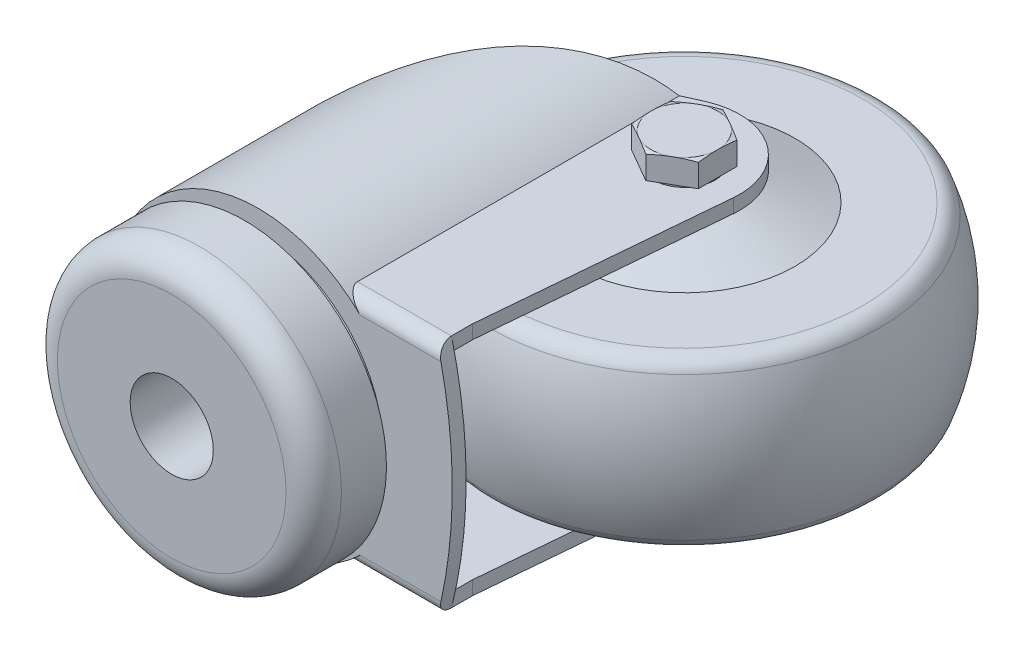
ISO-10303-21;
HEADER;
FILE_DESCRIPTION(('STEP AP214'),'2;1');
FILE_NAME('part.step','',(''),(''),'','','');
FILE_SCHEMA(('AUTOMOTIVE_DESIGN { 1 0 10303 214 1 1 1 1 }'));
ENDSEC;
DATA;
#1=APPLICATION_CONTEXT('core data for automotive mechanical design processes');
#2=APPLICATION_PROTOCOL_DEFINITION('international standard','automotive_design',2000,#1);
#3=PRODUCT_CONTEXT('',#1,'mechanical');
#4=PRODUCT('Part','Part','',(#3));
#5=PRODUCT_RELATED_PRODUCT_CATEGORY('part','',(#4));
#6=PRODUCT_DEFINITION_FORMATION('','',#4);
#7=PRODUCT_DEFINITION_CONTEXT('part definition',#1,'design');
#8=PRODUCT_DEFINITION('design','',#6,#7);
#9=PRODUCT_DEFINITION_SHAPE('','',#8);
#10=(LENGTH_UNIT() NAMED_UNIT(*) SI_UNIT(.MILLI.,.METRE.));
#11=(NAMED_UNIT(*) PLANE_ANGLE_UNIT() SI_UNIT($,.RADIAN.));
#12=(NAMED_UNIT(*) SI_UNIT($,.STERADIAN.) SOLID_ANGLE_UNIT());
#13=UNCERTAINTY_MEASURE_WITH_UNIT(LENGTH_MEASURE(1.E-05),#10,'distance_accuracy_value','');
#14=(GEOMETRIC_REPRESENTATION_CONTEXT(3) GLOBAL_UNCERTAINTY_ASSIGNED_CONTEXT((#13)) GLOBAL_UNIT_ASSIGNED_CONTEXT((#10,
#11,#12)) REPRESENTATION_CONTEXT('',''));
#15=CARTESIAN_POINT('',(0.,0.,0.));
#16=DIRECTION('',(0.,0.,1.));
#17=DIRECTION('',(1.,0.,0.));
#18=AXIS2_PLACEMENT_3D('',#15,#16,#17);
#19=CARTESIAN_POINT('',(20.9999999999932,0.,-53.));
#20=DIRECTION('',(0.,-1.,0.));
#21=DIRECTION('',(-1.,0.,0.));
#22=AXIS2_PLACEMENT_3D('',#19,#20,#21);
#23=SPHERICAL_SURFACE('',#22,29.9999999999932);
#24=CARTESIAN_POINT('',(21.,-10.363636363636,-53.));
#25=DIRECTION('',(0.,-1.,0.));
#26=DIRECTION('',(1.,0.,0.));
#27=AXIS2_PLACEMENT_3D('',#24,#25,#26);
#28=CIRCLE('',#27,28.153064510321);
#29=CARTESIAN_POINT('',(-7.15306451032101,-10.363636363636,-53.));
#30=VERTEX_POINT('',#29);
#31=EDGE_CURVE('E717',#30,#30,#28,.T.);
#32=CARTESIAN_POINT('',(21.,10.363636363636,-53.));
#33=DIRECTION('',(0.,-1.,0.));
#34=DIRECTION('',(1.,0.,0.));
#35=AXIS2_PLACEMENT_3D('',#32,#33,#34);
#36=CIRCLE('',#35,28.153064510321);
#37=CARTESIAN_POINT('',(-7.15306451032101,10.363636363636,-53.));
#38=VERTEX_POINT('',#37);
#39=EDGE_CURVE('E714',#38,#38,#36,.T.);
#40=CARTESIAN_POINT('',(-7.15306451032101,-10.363636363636,-53.));
#41=CARTESIAN_POINT('',(-7.22922103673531,-10.1567565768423,-53.));
#42=CARTESIAN_POINT('',(-7.30309642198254,-9.94903707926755,-53.));
#43=CARTESIAN_POINT('',(-7.4462507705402,-9.53202021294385,-53.));
#44=CARTESIAN_POINT('',(-7.51552973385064,-9.32272284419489,-53.));
#45=CARTESIAN_POINT('',(-7.64945709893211,-8.90265178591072,-53.));
#46=CARTESIAN_POINT('',(-7.71410550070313,-8.69187809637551,-53.));
#47=CARTESIAN_POINT('',(-7.83874045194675,-8.26895686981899,-53.));
#48=CARTESIAN_POINT('',(-7.89872700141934,-8.0568093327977,-53.));
#49=CARTESIAN_POINT('',(-8.01400906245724,-7.63124349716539,-53.));
#50=CARTESIAN_POINT('',(-8.06930457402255,-7.41782519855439,-53.));
#51=CARTESIAN_POINT('',(-8.17517769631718,-6.98982155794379,-53.));
#52=CARTESIAN_POINT('',(-8.22575530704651,-6.7752362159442,-53.));
#53=CARTESIAN_POINT('',(-8.32216804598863,-6.34500276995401,-53.));
#54=CARTESIAN_POINT('',(-8.36800317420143,-6.12935466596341,-53.));
#55=CARTESIAN_POINT('',(-8.45490867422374,-5.69710049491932,-53.));
#56=CARTESIAN_POINT('',(-8.49597904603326,-5.48049442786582,-53.));
#57=CARTESIAN_POINT('',(-8.57333507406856,-5.04642959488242,-53.));
#58=CARTESIAN_POINT('',(-8.60962073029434,-4.82897082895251,-53.));
#59=CARTESIAN_POINT('',(-8.67738969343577,-4.39330627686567,-53.));
#60=CARTESIAN_POINT('',(-8.70887300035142,-4.17510049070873,-53.));
#61=CARTESIAN_POINT('',(-8.76702196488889,-3.73804793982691,-53.));
#62=CARTESIAN_POINT('',(-8.79368762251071,-3.51920117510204,-53.));
#63=CARTESIAN_POINT('',(-8.84218832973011,-3.08097302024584,-53.));
#64=CARTESIAN_POINT('',(-8.86402337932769,-2.86159163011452,-53.));
#65=CARTESIAN_POINT('',(-8.90285225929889,-2.42240083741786,-53.));
#66=CARTESIAN_POINT('',(-8.91984608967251,-2.20259143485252,-53.));
#67=CARTESIAN_POINT('',(-8.94898427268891,-1.76265143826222,-53.));
#68=CARTESIAN_POINT('',(-8.96112862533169,-1.54252084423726,-53.));
#69=CARTESIAN_POINT('',(-8.9805619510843,-1.10204544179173,-53.));
#70=CARTESIAN_POINT('',(-8.98785092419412,-0.881700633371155,-53.));
#71=CARTESIAN_POINT('',(-8.99756994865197,-0.440903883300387,-53.));
#72=CARTESIAN_POINT('',(-9.,-0.220451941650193,-53.));
#73=CARTESIAN_POINT('',(-9.,0.220451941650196,-53.));
#74=CARTESIAN_POINT('',(-8.99756994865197,0.44090388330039,-53.));
#75=CARTESIAN_POINT('',(-8.98785092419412,0.881700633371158,-53.));
#76=CARTESIAN_POINT('',(-8.9805619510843,1.10204544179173,-53.));
#77=CARTESIAN_POINT('',(-8.96112862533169,1.54252084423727,-53.));
#78=CARTESIAN_POINT('',(-8.94898427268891,1.76265143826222,-53.));
#79=CARTESIAN_POINT('',(-8.91984608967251,2.20259143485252,-53.));
#80=CARTESIAN_POINT('',(-8.90285225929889,2.42240083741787,-53.));
#81=CARTESIAN_POINT('',(-8.86402337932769,2.86159163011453,-53.));
#82=CARTESIAN_POINT('',(-8.84218832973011,3.08097302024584,-53.));
#83=CARTESIAN_POINT('',(-8.79368762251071,3.51920117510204,-53.));
#84=CARTESIAN_POINT('',(-8.76702196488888,3.73804793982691,-53.));
#85=CARTESIAN_POINT('',(-8.70887300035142,4.17510049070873,-53.));
#86=CARTESIAN_POINT('',(-8.67738969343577,4.39330627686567,-53.));
#87=CARTESIAN_POINT('',(-8.60962073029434,4.82897082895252,-53.));
#88=CARTESIAN_POINT('',(-8.57333507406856,5.04642959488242,-53.));
#89=CARTESIAN_POINT('',(-8.49597904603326,5.48049442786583,-53.));
#90=CARTESIAN_POINT('',(-8.45490867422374,5.69710049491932,-53.));
#91=CARTESIAN_POINT('',(-8.36800317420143,6.12935466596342,-53.));
#92=CARTESIAN_POINT('',(-8.32216804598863,6.34500276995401,-53.));
#93=CARTESIAN_POINT('',(-8.22575530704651,6.7752362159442,-53.));
#94=CARTESIAN_POINT('',(-8.17517769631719,6.98982155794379,-53.));
#95=CARTESIAN_POINT('',(-8.06930457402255,7.41782519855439,-53.));
#96=CARTESIAN_POINT('',(-8.01400906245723,7.6312434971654,-53.));
#97=CARTESIAN_POINT('',(-7.89872700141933,8.0568093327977,-53.));
#98=CARTESIAN_POINT('',(-7.83874045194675,8.268956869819,-53.));
#99=CARTESIAN_POINT('',(-7.71410550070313,8.69187809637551,-53.));
#100=CARTESIAN_POINT('',(-7.64945709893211,8.90265178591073,-53.));
#101=CARTESIAN_POINT('',(-7.51552973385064,9.3227228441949,-53.));
#102=CARTESIAN_POINT('',(-7.4462507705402,9.53202021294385,-53.));
#103=CARTESIAN_POINT('',(-7.30309642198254,9.94903707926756,-53.));
#104=CARTESIAN_POINT('',(-7.22922103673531,10.1567565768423,-53.));
#105=CARTESIAN_POINT('',(-7.15306451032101,10.363636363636,-53.));
#106=B_SPLINE_CURVE_WITH_KNOTS('',3,(#40,#41,#42,#43,#44,#45,#46,#47,#48,#49,#50,#51,#52,#53,
#54,#55,#56,#57,#58,#59,#60,#61,#62,#63,#64,#65,#66,#67,#68,#69,#70,#71,#72,#73,#74,#75,#76,#77,
#78,#79,#80,#81,#82,#83,#84,#85,#86,#87,#88,#89,#90,#91,#92,#93,#94,#95,#96,#97,#98,#99,#100,
#101,#102,#103,#104,#105),.UNSPECIFIED.,.F.,.F.,(4,2,2,2,2,2,2,2,2,2,2,2,2,2,2,2,2,2,2,2,2,2,2,
2,2,2,2,2,2,2,2,2,4),(0.,0.661342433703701,1.3226848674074,1.98402730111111,2.64536973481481,
3.30671216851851,3.96805460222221,4.62939703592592,5.29073946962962,5.95208190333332,
6.61342433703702,7.27476677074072,7.93610920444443,8.59745163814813,9.25879407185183,
9.92013650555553,10.5814789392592,11.2428213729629,11.9041638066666,12.5655062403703,
13.226848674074,13.8881911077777,14.5495335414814,15.2108759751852,15.8722184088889,
16.5335608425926,17.1949032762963,17.85624571,18.5175881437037,19.1789305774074,
19.8402730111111,20.5016154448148,21.1629578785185),.UNSPECIFIED.);
#107=EDGE_CURVE('BSEAM14',#30,#38,#106,.T.);
#108=ORIENTED_EDGE('',*,*,#31,.F.);
#109=ORIENTED_EDGE('',*,*,#39,.T.);
#110=ORIENTED_EDGE('',*,*,#107,.T.);
#111=ORIENTED_EDGE('',*,*,#107,.F.);
#112=EDGE_LOOP('',(#108,#110,#109,#111));
#113=FACE_BOUND('',#112,.T.);
#114=ADVANCED_FACE('F14',(#113),#23,.T.);
#115=CARTESIAN_POINT('',(21.,9.50000000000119,-53.));
#116=DIRECTION('',(0.,-1.,0.));
#117=DIRECTION('',(1.,0.,0.));
#118=AXIS2_PLACEMENT_3D('',#115,#116,#117);
#119=TOROIDAL_SURFACE('',#118,25.8069758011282,2.49999999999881);
#120=ORIENTED_EDGE('',*,*,#39,.F.);
#121=EDGE_LOOP('',(#120));
#122=FACE_BOUND('',#121,.T.);
#123=CARTESIAN_POINT('',(21.,12.,-53.));
#124=DIRECTION('',(0.,-1.,0.));
#125=DIRECTION('',(1.,0.,0.));
#126=AXIS2_PLACEMENT_3D('',#123,#124,#125);
#127=CIRCLE('',#126,25.806975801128);
#128=CARTESIAN_POINT('',(46.806975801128,12.,-53.));
#129=VERTEX_POINT('',#128);
#130=EDGE_CURVE('E709',#129,#129,#127,.T.);
#131=ORIENTED_EDGE('',*,*,#130,.T.);
#132=EDGE_LOOP('',(#131));
#133=FACE_BOUND('',#132,.T.);
#134=ADVANCED_FACE('F377',(#122,#133),#119,.T.);
#135=CARTESIAN_POINT('',(-4.806975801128,12.,-53.));
#136=DIRECTION('',(0.,-1.,0.));
#137=DIRECTION('',(1.,0.,0.));
#138=AXIS2_PLACEMENT_3D('',#135,#136,#137);
#139=PLANE('',#138);
#140=ORIENTED_EDGE('',*,*,#130,.F.);
#141=EDGE_LOOP('',(#140));
#142=FACE_BOUND('',#141,.T.);
#143=CARTESIAN_POINT('',(21.,12.,-53.));
#144=DIRECTION('',(0.,-1.,0.));
#145=DIRECTION('',(1.,0.,0.));
#146=AXIS2_PLACEMENT_3D('',#143,#144,#145);
#147=CIRCLE('',#146,16.);
#148=CARTESIAN_POINT('',(37.,12.,-53.));
#149=VERTEX_POINT('',#148);
#150=EDGE_CURVE('E706',#149,#149,#147,.T.);
#151=ORIENTED_EDGE('',*,*,#150,.T.);
#152=EDGE_LOOP('',(#151));
#153=FACE_BOUND('',#152,.T.);
#154=ADVANCED_FACE('F384',(#142,#153),#139,.F.);
#155=CARTESIAN_POINT('',(21.,15.,-53.));
#156=DIRECTION('',(0.,-1.,0.));
#157=DIRECTION('',(1.,0.,0.));
#158=AXIS2_PLACEMENT_3D('',#155,#156,#157);
#159=CONICAL_SURFACE('',#158,8.,1.21202565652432);
#160=ORIENTED_EDGE('',*,*,#150,.F.);
#161=EDGE_LOOP('',(#160));
#162=FACE_BOUND('',#161,.T.);
#163=CARTESIAN_POINT('',(21.,15.,-53.));
#164=DIRECTION('',(0.,-1.,0.));
#165=DIRECTION('',(1.,0.,0.));
#166=AXIS2_PLACEMENT_3D('',#163,#164,#165);
#167=CIRCLE('',#166,8.);
#168=CARTESIAN_POINT('',(29.,15.,-53.));
#169=VERTEX_POINT('',#168);
#170=EDGE_CURVE('E271',#169,#169,#167,.T.);
#171=ORIENTED_EDGE('',*,*,#170,.T.);
#172=EDGE_LOOP('',(#171));
#173=FACE_BOUND('',#172,.T.);
#174=ADVANCED_FACE('F395',(#162,#173),#159,.T.);
#175=CARTESIAN_POINT('',(21.,-9.50000000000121,-53.));
#176=DIRECTION('',(0.,-1.,0.));
#177=DIRECTION('',(1.,0.,0.));
#178=AXIS2_PLACEMENT_3D('',#175,#176,#177);
#179=TOROIDAL_SURFACE('',#178,25.8069758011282,2.49999999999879);
#180=CARTESIAN_POINT('',(21.,-12.,-53.));
#181=DIRECTION('',(0.,-1.,0.));
#182=DIRECTION('',(1.,0.,0.));
#183=AXIS2_PLACEMENT_3D('',#180,#181,#182);
#184=CIRCLE('',#183,25.806975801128);
#185=CARTESIAN_POINT('',(46.806975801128,-12.,-53.));
#186=VERTEX_POINT('',#185);
#187=EDGE_CURVE('E720',#186,#186,#184,.T.);
#188=ORIENTED_EDGE('',*,*,#187,.F.);
#189=EDGE_LOOP('',(#188));
#190=FACE_BOUND('',#189,.T.);
#191=ORIENTED_EDGE('',*,*,#31,.T.);
#192=EDGE_LOOP('',(#191));
#193=FACE_BOUND('',#192,.T.);
#194=ADVANCED_FACE('F391',(#190,#193),#179,.T.);
#195=CARTESIAN_POINT('',(5.,-12.,-53.));
#196=DIRECTION('',(0.,1.,0.));
#197=DIRECTION('',(-1.,0.,0.));
#198=AXIS2_PLACEMENT_3D('',#195,#196,#197);
#199=PLANE('',#198);
#200=CARTESIAN_POINT('',(21.,-12.,-53.));
#201=DIRECTION('',(0.,-1.,0.));
#202=DIRECTION('',(1.,0.,0.));
#203=AXIS2_PLACEMENT_3D('',#200,#201,#202);
#204=CIRCLE('',#203,16.);
#205=CARTESIAN_POINT('',(37.,-12.,-53.));
#206=VERTEX_POINT('',#205);
#207=EDGE_CURVE('E30',#206,#206,#204,.T.);
#208=ORIENTED_EDGE('',*,*,#207,.F.);
#209=EDGE_LOOP('',(#208));
#210=FACE_BOUND('',#209,.T.);
#211=ORIENTED_EDGE('',*,*,#187,.T.);
#212=EDGE_LOOP('',(#211));
#213=FACE_BOUND('',#212,.T.);
#214=ADVANCED_FACE('F394',(#210,#213),#199,.F.);
#215=CARTESIAN_POINT('',(21.,-12.,-53.));
#216=DIRECTION('',(0.,1.,0.));
#217=DIRECTION('',(-1.,0.,0.));
#218=AXIS2_PLACEMENT_3D('',#215,#216,#217);
#219=CONICAL_SURFACE('',#218,16.,1.21202565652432);
#220=CARTESIAN_POINT('',(21.,-15.,-53.));
#221=DIRECTION('',(0.,-1.,0.));
#222=DIRECTION('',(1.,0.,0.));
#223=AXIS2_PLACEMENT_3D('',#220,#221,#222);
#224=CIRCLE('',#223,8.);
#225=CARTESIAN_POINT('',(29.,-15.,-53.));
#226=VERTEX_POINT('',#225);
#227=EDGE_CURVE('E9',#226,#226,#224,.T.);
#228=ORIENTED_EDGE('',*,*,#227,.F.);
#229=EDGE_LOOP('',(#228));
#230=FACE_BOUND('',#229,.T.);
#231=ORIENTED_EDGE('',*,*,#207,.T.);
#232=EDGE_LOOP('',(#231));
#233=FACE_BOUND('',#232,.T.);
#234=ADVANCED_FACE('F399',(#230,#233),#219,.T.);
#235=CARTESIAN_POINT('',(21.,-23.,-50.6135));
#236=DIRECTION('',(0.,-1.,0.));
#237=DIRECTION('',(1.,0.,0.));
#238=AXIS2_PLACEMENT_3D('',#235,#236,#237);
#239=PLANE('',#238);
#240=CARTESIAN_POINT('',(21.,-23.,-53.));
#241=DIRECTION('',(0.,-1.,0.));
#242=DIRECTION('',(1.,0.,0.));
#243=AXIS2_PLACEMENT_3D('',#240,#241,#242);
#244=CIRCLE('',#243,2.3865);
#245=CARTESIAN_POINT('',(23.3865,-23.,-53.));
#246=VERTEX_POINT('',#245);
#247=EDGE_CURVE('E519',#246,#246,#244,.T.);
#248=ORIENTED_EDGE('',*,*,#247,.T.);
#249=EDGE_LOOP('',(#248));
#250=FACE_BOUND('',#249,.T.);
#251=ADVANCED_FACE('F402',(#250),#239,.T.);
#252=CARTESIAN_POINT('',(21.,-23.,-53.));
#253=DIRECTION('',(0.,1.,0.));
#254=DIRECTION('',(-1.,0.,0.));
#255=AXIS2_PLACEMENT_3D('',#252,#253,#254);
#256=CONICAL_SURFACE('',#255,2.3865,0.785398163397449);
#257=CARTESIAN_POINT('',(21.,-22.3865,-53.));
#258=DIRECTION('',(0.,-1.,0.));
#259=DIRECTION('',(1.,0.,0.));
#260=AXIS2_PLACEMENT_3D('',#257,#258,#259);
#261=CIRCLE('',#260,3.);
#262=CARTESIAN_POINT('',(24.,-22.3865,-53.));
#263=VERTEX_POINT('',#262);
#264=EDGE_CURVE('E514',#263,#263,#261,.T.);
#265=ORIENTED_EDGE('',*,*,#264,.T.);
#266=EDGE_LOOP('',(#265));
#267=FACE_BOUND('',#266,.T.);
#268=ORIENTED_EDGE('',*,*,#247,.F.);
#269=EDGE_LOOP('',(#268));
#270=FACE_BOUND('',#269,.T.);
#271=ADVANCED_FACE('F614',(#267,#270),#256,.T.);
#272=CARTESIAN_POINT('',(21.,-23.,-53.));
#273=DIRECTION('',(0.,-1.,0.));
#274=DIRECTION('',(1.,0.,0.));
#275=AXIS2_PLACEMENT_3D('',#272,#273,#274);
#276=CYLINDRICAL_SURFACE('',#275,3.);
#277=CARTESIAN_POINT('',(21.,-22.,-53.));
#278=DIRECTION('',(0.,-1.,0.));
#279=DIRECTION('',(1.,0.,0.));
#280=AXIS2_PLACEMENT_3D('',#277,#278,#279);
#281=CIRCLE('',#280,3.);
#282=CARTESIAN_POINT('',(24.,-22.,-53.));
#283=VERTEX_POINT('',#282);
#284=EDGE_CURVE('E433',#283,#283,#281,.F.);
#285=ORIENTED_EDGE('',*,*,#284,.F.);
#286=EDGE_LOOP('',(#285));
#287=FACE_BOUND('',#286,.T.);
#288=ORIENTED_EDGE('',*,*,#264,.F.);
#289=EDGE_LOOP('',(#288));
#290=FACE_BOUND('',#289,.T.);
#291=ADVANCED_FACE('F619',(#287,#290),#276,.T.);
#292=CARTESIAN_POINT('',(21.,21.,-53.));
#293=DIRECTION('',(0.,1.,0.));
#294=DIRECTION('',(-1.,0.,0.));
#295=AXIS2_PLACEMENT_3D('',#292,#293,#294);
#296=PLANE('',#295);
#297=CARTESIAN_POINT('',(21.,21.,-53.));
#298=DIRECTION('',(0.,-1.,0.));
#299=DIRECTION('',(1.,0.,0.));
#300=AXIS2_PLACEMENT_3D('',#297,#298,#299);
#301=CIRCLE('',#300,4.8166666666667);
#302=CARTESIAN_POINT('',(25.816666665,21.,-53.));
#303=VERTEX_POINT('',#302);
#304=CARTESIAN_POINT('',(23.4083333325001,21.,-48.8286443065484));
#305=VERTEX_POINT('',#304);
#306=EDGE_CURVE('E477',#303,#305,#301,.T.);
#307=ORIENTED_EDGE('',*,*,#306,.F.);
#308=CARTESIAN_POINT('',(23.4083333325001,21.,-57.1713556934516));
#309=VERTEX_POINT('',#308);
#310=EDGE_CURVE('E493',#309,#303,#301,.T.);
#311=ORIENTED_EDGE('',*,*,#310,.F.);
#312=CARTESIAN_POINT('',(18.5916666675,21.,-57.1713556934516));
#313=VERTEX_POINT('',#312);
#314=EDGE_CURVE('E501',#313,#309,#301,.T.);
#315=ORIENTED_EDGE('',*,*,#314,.F.);
#316=CARTESIAN_POINT('',(16.183333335,21.,-53.));
#317=VERTEX_POINT('',#316);
#318=EDGE_CURVE('E508',#317,#313,#301,.T.);
#319=ORIENTED_EDGE('',*,*,#318,.F.);
#320=CARTESIAN_POINT('',(18.5916666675,21.,-48.8286443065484));
#321=VERTEX_POINT('',#320);
#322=EDGE_CURVE('E499',#321,#317,#301,.T.);
#323=ORIENTED_EDGE('',*,*,#322,.F.);
#324=EDGE_CURVE('E492',#305,#321,#301,.T.);
#325=ORIENTED_EDGE('',*,*,#324,.F.);
#326=EDGE_LOOP('',(#307,#311,#315,#319,#323,#325));
#327=FACE_BOUND('',#326,.T.);
#328=ADVANCED_FACE('F623',(#327),#296,.T.);
#329=CARTESIAN_POINT('',(21.,-22.,-48.18333333));
#330=DIRECTION('',(0.,-1.,0.));
#331=DIRECTION('',(1.,0.,0.));
#332=AXIS2_PLACEMENT_3D('',#329,#330,#331);
#333=PLANE('',#332);
#334=ORIENTED_EDGE('',*,*,#284,.T.);
#335=EDGE_LOOP('',(#334));
#336=FACE_BOUND('',#335,.T.);
#337=CARTESIAN_POINT('',(21.,-22.,-53.));
#338=DIRECTION('',(0.,-1.,0.));
#339=DIRECTION('',(1.,0.,0.));
#340=AXIS2_PLACEMENT_3D('',#337,#338,#339);
#341=CIRCLE('',#340,4.81666667);
#342=CARTESIAN_POINT('',(25.816666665,-22.,-53.));
#343=VERTEX_POINT('',#342);
#344=CARTESIAN_POINT('',(23.4083333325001,-22.,-48.8286443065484));
#345=VERTEX_POINT('',#344);
#346=EDGE_CURVE('E879',#343,#345,#341,.T.);
#347=ORIENTED_EDGE('',*,*,#346,.T.);
#348=CARTESIAN_POINT('',(18.5916666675,-22.,-48.8286443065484));
#349=VERTEX_POINT('',#348);
#350=EDGE_CURVE('E883',#345,#349,#341,.T.);
#351=ORIENTED_EDGE('',*,*,#350,.T.);
#352=CARTESIAN_POINT('',(16.183333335,-22.,-53.));
#353=VERTEX_POINT('',#352);
#354=EDGE_CURVE('E1023',#349,#353,#341,.T.);
#355=ORIENTED_EDGE('',*,*,#354,.T.);
#356=CARTESIAN_POINT('',(18.5916666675,-22.,-57.1713556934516));
#357=VERTEX_POINT('',#356);
#358=EDGE_CURVE('E1011',#353,#357,#341,.T.);
#359=ORIENTED_EDGE('',*,*,#358,.T.);
#360=CARTESIAN_POINT('',(23.4083333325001,-22.,-57.1713556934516));
#361=VERTEX_POINT('',#360);
#362=EDGE_CURVE('E1018',#357,#361,#341,.T.);
#363=ORIENTED_EDGE('',*,*,#362,.T.);
#364=EDGE_CURVE('E884',#361,#343,#341,.T.);
#365=ORIENTED_EDGE('',*,*,#364,.T.);
#366=EDGE_LOOP('',(#347,#351,#355,#359,#363,#365));
#367=FACE_BOUND('',#366,.T.);
#368=ADVANCED_FACE('F641',(#336,#367),#333,.T.);
#369=CARTESIAN_POINT('',(21.,20.741875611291,-53.));
#370=DIRECTION('',(0.,-1.,0.));
#371=DIRECTION('',(1.,0.,0.));
#372=AXIS2_PLACEMENT_3D('',#369,#370,#371);
#373=CONICAL_SURFACE('',#372,5.78,1.3089969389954);
#374=ORIENTED_EDGE('',*,*,#318,.T.);
#375=CARTESIAN_POINT('',(15.3837584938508,20.6624876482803,-55.3192690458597));
#376=CARTESIAN_POINT('',(15.5857618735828,20.7005656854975,-55.4358957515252));
#377=CARTESIAN_POINT('',(15.7880950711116,20.7364910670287,-55.5527128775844));
#378=CARTESIAN_POINT('',(16.193514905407,20.8028703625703,-55.7867821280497));
#379=CARTESIAN_POINT('',(16.3966018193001,20.8333220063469,-55.9040344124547));
#380=CARTESIAN_POINT('',(16.8034502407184,20.8875534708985,-56.13892845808));
#381=CARTESIAN_POINT('',(17.0072117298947,20.9113334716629,-56.2565702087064));
#382=CARTESIAN_POINT('',(17.4152919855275,20.9509981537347,-56.492175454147));
#383=CARTESIAN_POINT('',(17.6196106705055,20.9668839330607,-56.6101389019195));
#384=CARTESIAN_POINT('',(18.0263590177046,20.9896554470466,-56.8449751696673));
#385=CARTESIAN_POINT('',(18.2287844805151,20.9966391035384,-56.9618455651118));
#386=CARTESIAN_POINT('',(18.6337233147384,21.0014529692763,-57.195637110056));
#387=CARTESIAN_POINT('',(18.836236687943,20.9992829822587,-57.3125582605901));
#388=CARTESIAN_POINT('',(19.2409450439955,20.98594393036,-57.5462167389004));
#389=CARTESIAN_POINT('',(19.4431401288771,20.974778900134,-57.6629541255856));
#390=CARTESIAN_POINT('',(19.8470554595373,20.9441824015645,-57.8961547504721));
#391=CARTESIAN_POINT('',(20.048775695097,20.9247507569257,-58.0126179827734));
#392=CARTESIAN_POINT('',(20.4495850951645,20.8789357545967,-58.2440253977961));
#393=CARTESIAN_POINT('',(20.6486804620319,20.8526235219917,-58.3589731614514));
#394=CARTESIAN_POINT('',(21.0462143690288,20.7941175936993,-58.5884894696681));
#395=CARTESIAN_POINT('',(21.2446529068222,20.7619238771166,-58.7030580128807));
#396=CARTESIAN_POINT('',(21.6410368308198,20.6927199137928,-58.9319103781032));
#397=CARTESIAN_POINT('',(21.8389817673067,20.6557062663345,-59.0461939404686));
#398=CARTESIAN_POINT('',(22.2343025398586,20.5778200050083,-59.2744324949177));
#399=CARTESIAN_POINT('',(22.4316783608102,20.5369472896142,-59.3883874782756));
#400=CARTESIAN_POINT('',(22.8284282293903,20.4515772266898,-59.6174511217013));
#401=CARTESIAN_POINT('',(23.0277958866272,20.4070404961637,-59.7325560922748));
#402=CARTESIAN_POINT('',(23.4260949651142,20.315436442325,-59.9625141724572));
#403=CARTESIAN_POINT('',(23.6250263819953,20.2683690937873,-60.0773672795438));
#404=CARTESIAN_POINT('',(24.0221581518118,20.1722951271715,-60.3066514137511));
#405=CARTESIAN_POINT('',(24.2203591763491,20.1232921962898,-60.4210828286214));
#406=CARTESIAN_POINT('',(24.6164402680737,20.0236383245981,-60.6497603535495));
#407=CARTESIAN_POINT('',(24.8143203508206,19.9729874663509,-60.7640064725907));
#408=CARTESIAN_POINT('',(25.0120733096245,19.9216958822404,-60.8781791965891));
#409=B_SPLINE_CURVE_WITH_KNOTS('',3,(#375,#376,#377,#378,#379,#380,#381,#382,#383,#384,#385,
#386,#387,#388,#389,#390,#391,#392,#393,#394,#395,#396,#397,#398,#399,#400,#401,#402,#403,#404,
#405,#406,#407,#408),.UNSPECIFIED.,.F.,.F.,(4,2,2,2,2,2,2,2,2,2,2,2,2,2,2,2,4),(0.,
0.709056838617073,1.4184070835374,2.12773818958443,2.83697060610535,3.53833229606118,
4.23970902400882,4.94077133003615,5.64184858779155,6.33594709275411,7.03004806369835,
7.72464144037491,8.41925309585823,9.12267089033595,9.82609569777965,10.5282396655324,
11.2303485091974),.UNSPECIFIED.);
#410=CARTESIAN_POINT('',(16.183333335,20.8003400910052,-55.7809037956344));
#411=VERTEX_POINT('',#410);
#412=EDGE_CURVE('E922',#411,#313,#409,.T.);
#413=ORIENTED_EDGE('',*,*,#412,.F.);
#414=CARTESIAN_POINT('',(16.183333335,19.9345176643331,-60.3565171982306));
#415=CARTESIAN_POINT('',(16.183333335,19.9834903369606,-60.1379988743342));
#416=CARTESIAN_POINT('',(16.183333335,20.0318640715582,-59.9193438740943));
#417=CARTESIAN_POINT('',(16.183333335,20.1270903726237,-59.4816933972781));
#418=CARTESIAN_POINT('',(16.183333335,20.1739428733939,-59.262697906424));
#419=CARTESIAN_POINT('',(16.183333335,20.2658441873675,-58.8241031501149));
#420=CARTESIAN_POINT('',(16.183333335,20.3108911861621,-58.6045035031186));
#421=CARTESIAN_POINT('',(16.183333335,20.3986952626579,-58.1648471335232));
#422=CARTESIAN_POINT('',(16.183333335,20.4414523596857,-57.944790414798));
#423=CARTESIAN_POINT('',(16.183333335,20.523801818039,-57.5058954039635));
#424=CARTESIAN_POINT('',(16.183333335,20.5634166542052,-57.2870613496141));
#425=CARTESIAN_POINT('',(16.183333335,20.6391877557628,-56.8487963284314));
#426=CARTESIAN_POINT('',(16.183333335,20.6753440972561,-56.6293653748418));
#427=CARTESIAN_POINT('',(16.183333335,20.7433841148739,-56.1898639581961));
#428=CARTESIAN_POINT('',(16.183333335,20.7752683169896,-55.9697935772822));
#429=CARTESIAN_POINT('',(16.183333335,20.8338244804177,-55.528952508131));
#430=CARTESIAN_POINT('',(16.183333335,20.8604964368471,-55.3081818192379));
#431=CARTESIAN_POINT('',(16.183333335,20.9078728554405,-54.8634494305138));
#432=CARTESIAN_POINT('',(16.183333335,20.9285059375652,-54.6394800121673));
#433=CARTESIAN_POINT('',(16.183333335,20.962381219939,-54.1909781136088));
#434=CARTESIAN_POINT('',(16.183333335,20.9756235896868,-53.9664456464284));
#435=CARTESIAN_POINT('',(16.183333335,20.9939451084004,-53.5171433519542));
#436=CARTESIAN_POINT('',(16.183333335,20.9990279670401,-53.2923736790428));
#437=CARTESIAN_POINT('',(16.183333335,21.0007179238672,-52.8428020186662));
#438=CARTESIAN_POINT('',(16.183333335,20.9973250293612,-52.618000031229));
#439=CARTESIAN_POINT('',(16.183333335,20.9822544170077,-52.1678615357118));
#440=CARTESIAN_POINT('',(16.183333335,20.9705466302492,-51.9425260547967));
#441=CARTESIAN_POINT('',(16.183333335,20.9395140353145,-51.4923851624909));
#442=CARTESIAN_POINT('',(16.183333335,20.9201890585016,-51.2675797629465));
#443=CARTESIAN_POINT('',(16.183333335,20.8749001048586,-50.818500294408));
#444=CARTESIAN_POINT('',(16.183333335,20.8489317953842,-50.5942266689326));
#445=CARTESIAN_POINT('',(16.183333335,20.7914297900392,-50.1464030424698));
#446=CARTESIAN_POINT('',(16.183333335,20.7598960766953,-49.9228530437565));
#447=CARTESIAN_POINT('',(16.183333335,20.6629761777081,-49.2828076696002));
#448=CARTESIAN_POINT('',(16.183333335,20.5919542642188,-48.8671698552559));
#449=CARTESIAN_POINT('',(16.183333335,20.4393911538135,-48.0378298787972));
#450=CARTESIAN_POINT('',(16.183333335,20.3578486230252,-47.6241279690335));
#451=CARTESIAN_POINT('',(16.183333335,20.1877009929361,-46.7980854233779));
#452=CARTESIAN_POINT('',(16.183333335,20.0990941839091,-46.3857451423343));
#453=CARTESIAN_POINT('',(16.183333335,19.9170749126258,-45.5621603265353));
#454=CARTESIAN_POINT('',(16.183333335,19.8236627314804,-45.1509157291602));
#455=CARTESIAN_POINT('',(16.183333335,19.6343958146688,-44.3332483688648));
#456=CARTESIAN_POINT('',(16.183333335,19.5385741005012,-43.9268179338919));
#457=CARTESIAN_POINT('',(16.183333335,19.3445311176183,-43.1145240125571));
#458=CARTESIAN_POINT('',(16.183333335,19.2463098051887,-42.7086605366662));
#459=CARTESIAN_POINT('',(16.183333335,19.048217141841,-41.8978680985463));
#460=CARTESIAN_POINT('',(16.183333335,18.9483479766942,-41.4929386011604));
#461=CARTESIAN_POINT('',(16.183333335,18.7472459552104,-40.6834323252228));
#462=CARTESIAN_POINT('',(16.183333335,18.6460131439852,-40.278855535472));
#463=CARTESIAN_POINT('',(16.183333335,18.544297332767,-39.8744016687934));
#464=B_SPLINE_CURVE_WITH_KNOTS('',3,(#414,#415,#416,#417,#418,#419,#420,#421,#422,#423,#424,
#425,#426,#427,#428,#429,#430,#431,#432,#433,#434,#435,#436,#437,#438,#439,#440,#441,#442,#443,
#444,#445,#446,#447,#448,#449,#450,#451,#452,#453,#454,#455,#456,#457,#458,#459,#460,#461,#462,
#463),.UNSPECIFIED.,.F.,.F.,(4,2,2,2,2,2,2,2,2,2,2,2,2,2,2,2,2,2,2,2,2,2,2,2,4),(0.,
0.671819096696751,1.3436671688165,2.0161742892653,2.68867573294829,3.35582604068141,
4.02296166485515,4.69001507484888,5.35706910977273,6.03171582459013,6.70634706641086,
7.38067150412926,8.05499536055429,8.73177025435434,9.40856013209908,10.0857925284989,
10.7630270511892,12.0277754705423,13.2926844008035,14.5579004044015,15.8230424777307,
17.0757526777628,18.3284857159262,19.5796728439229,20.8308186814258),.UNSPECIFIED.);
#465=EDGE_CURVE('E577',#317,#411,#464,.F.);
#466=ORIENTED_EDGE('',*,*,#465,.F.);
#467=EDGE_LOOP('',(#374,#413,#466));
#468=FACE_BOUND('',#467,.T.);
#469=ADVANCED_FACE('F923',(#468),#373,.T.);
#470=ORIENTED_EDGE('',*,*,#322,.T.);
#471=CARTESIAN_POINT('',(16.183333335,20.8003400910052,-50.2190962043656));
#472=VERTEX_POINT('',#471);
#473=EDGE_CURVE('E591',#472,#317,#464,.F.);
#474=ORIENTED_EDGE('',*,*,#473,.F.);
#475=CARTESIAN_POINT('',(22.9852538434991,20.4161565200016,-46.2920055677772));
#476=CARTESIAN_POINT('',(22.8094532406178,20.4555840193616,-46.3935040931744));
#477=CARTESIAN_POINT('',(22.6334713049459,20.4939661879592,-46.4951073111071));
#478=CARTESIAN_POINT('',(22.2810661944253,20.5680889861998,-46.6985684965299));
#479=CARTESIAN_POINT('',(22.104642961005,20.6038292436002,-46.8004264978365));
#480=CARTESIAN_POINT('',(21.7508961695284,20.6721890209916,-47.0046623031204));
#481=CARTESIAN_POINT('',(21.5735714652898,20.7048007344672,-47.1070407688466));
#482=CARTESIAN_POINT('',(21.2184267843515,20.7661088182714,-47.3120836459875));
#483=CARTESIAN_POINT('',(21.0406068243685,20.7948053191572,-47.414748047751));
#484=CARTESIAN_POINT('',(20.5108778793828,20.8731586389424,-47.720587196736));
#485=CARTESIAN_POINT('',(20.1581525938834,20.9159964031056,-47.9242332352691));
#486=CARTESIAN_POINT('',(19.6280859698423,20.9617969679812,-48.2302673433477));
#487=CARTESIAN_POINT('',(19.4513300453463,20.9739861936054,-48.3323174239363));
#488=CARTESIAN_POINT('',(19.0975617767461,20.9916639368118,-48.5365656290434));
#489=CARTESIAN_POINT('',(18.9205494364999,20.9971525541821,-48.6387637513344));
#490=CARTESIAN_POINT('',(18.5662914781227,21.0011398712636,-48.8432946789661));
#491=CARTESIAN_POINT('',(18.3890458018,20.9996316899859,-48.9456275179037));
#492=CARTESIAN_POINT('',(18.0347004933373,20.9896914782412,-49.1502088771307));
#493=CARTESIAN_POINT('',(17.8576008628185,20.9812593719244,-49.2524573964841));
#494=CARTESIAN_POINT('',(17.5035253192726,20.9578864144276,-49.4568830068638));
#495=CARTESIAN_POINT('',(17.3265497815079,20.9429381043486,-49.5590598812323));
#496=CARTESIAN_POINT('',(16.9730466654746,20.9072077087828,-49.7631550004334));
#497=CARTESIAN_POINT('',(16.7965190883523,20.8864256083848,-49.8650732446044));
#498=CARTESIAN_POINT('',(16.4417164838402,20.8395202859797,-50.0699186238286));
#499=CARTESIAN_POINT('',(16.2634479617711,20.8133321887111,-50.1728420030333));
#500=CARTESIAN_POINT('',(15.9074282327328,20.7566020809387,-50.3783900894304));
#501=CARTESIAN_POINT('',(15.7296770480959,20.7260598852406,-50.4810147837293));
#502=CARTESIAN_POINT('',(15.3750792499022,20.6614524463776,-50.6857419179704));
#503=CARTESIAN_POINT('',(15.1982314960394,20.6273954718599,-50.7878450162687));
#504=CARTESIAN_POINT('',(14.8450120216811,20.5563242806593,-50.9917763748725));
#505=CARTESIAN_POINT('',(14.6686402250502,20.519310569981,-51.0936046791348));
#506=CARTESIAN_POINT('',(14.4924673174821,20.4811243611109,-51.1953181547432));
#507=B_SPLINE_CURVE_WITH_KNOTS('',3,(#475,#476,#477,#478,#479,#480,#481,#482,#483,#484,#485,
#486,#487,#488,#489,#490,#491,#492,#493,#494,#495,#496,#497,#498,#499,#500,#501,#502,#503,#504,
#505,#506),.UNSPECIFIED.,.F.,.F.,(4,2,2,2,2,2,2,2,2,2,2,2,2,2,2,4),(0.,0.620377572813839,
1.24084239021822,1.86281721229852,2.48477128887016,3.71269945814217,4.32599908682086,
4.93928958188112,5.55318334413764,6.1670838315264,6.78168888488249,7.39629550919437,
8.01875808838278,8.64124715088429,9.26230379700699,9.88325438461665),.UNSPECIFIED.);
#508=EDGE_CURVE('E584',#321,#472,#507,.T.);
#509=ORIENTED_EDGE('',*,*,#508,.F.);
#510=EDGE_LOOP('',(#470,#474,#509));
#511=FACE_BOUND('',#510,.T.);
#512=ADVANCED_FACE('F943',(#511),#373,.T.);
#513=ORIENTED_EDGE('',*,*,#324,.T.);
#514=CARTESIAN_POINT('',(21.,20.8003400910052,-47.4381924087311));
#515=VERTEX_POINT('',#514);
#516=EDGE_CURVE('E592',#515,#321,#507,.T.);
#517=ORIENTED_EDGE('',*,*,#516,.F.);
#518=CARTESIAN_POINT('',(29.8284639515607,19.9217674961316,-52.5353084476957));
#519=CARTESIAN_POINT('',(29.6307106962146,19.9730585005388,-52.4211355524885));
#520=CARTESIAN_POINT('',(29.4328303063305,20.0237087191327,-52.3068892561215));
#521=CARTESIAN_POINT('',(29.0367485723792,20.1233611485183,-52.0782113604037));
#522=CARTESIAN_POINT('',(28.8385472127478,20.1723632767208,-51.9637797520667));
#523=CARTESIAN_POINT('',(28.4414146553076,20.2684354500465,-51.7344951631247));
#524=CARTESIAN_POINT('',(28.2424827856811,20.3155018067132,-51.6196417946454));
#525=CARTESIAN_POINT('',(27.844182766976,20.4071036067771,-51.3896831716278));
#526=CARTESIAN_POINT('',(27.644814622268,20.4516390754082,-51.2745779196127));
#527=CARTESIAN_POINT('',(27.248063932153,20.5370062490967,-51.0455138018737));
#528=CARTESIAN_POINT('',(27.0506877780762,20.577877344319,-50.9315586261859));
#529=CARTESIAN_POINT('',(26.6553663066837,20.6557599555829,-50.7033196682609));
#530=CARTESIAN_POINT('',(26.4574210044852,20.6927715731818,-50.5890358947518));
#531=CARTESIAN_POINT('',(26.061036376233,20.7619709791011,-50.3601831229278));
#532=CARTESIAN_POINT('',(25.8625975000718,20.7941621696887,-50.2456143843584));
#533=CARTESIAN_POINT('',(25.4650629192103,20.8526624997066,-50.0160976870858));
#534=CARTESIAN_POINT('',(25.2659672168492,20.8789716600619,-49.9011497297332));
#535=CARTESIAN_POINT('',(24.8651573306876,20.9247799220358,-49.6697420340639));
#536=CARTESIAN_POINT('',(24.6634369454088,20.9442078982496,-49.5532787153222));
#537=CARTESIAN_POINT('',(24.2595214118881,20.9747966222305,-49.320077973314));
#538=CARTESIAN_POINT('',(24.0573262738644,20.9859575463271,-49.2033405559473));
#539=CARTESIAN_POINT('',(23.6526178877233,20.9992881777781,-48.9696820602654));
#540=CARTESIAN_POINT('',(23.4501045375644,21.0014538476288,-48.8527609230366));
#541=CARTESIAN_POINT('',(23.0451658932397,20.996631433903,-48.6189694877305));
#542=CARTESIAN_POINT('',(22.8427405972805,20.989643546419,-48.5020991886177));
#543=CARTESIAN_POINT('',(22.4359924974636,20.9668638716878,-48.267263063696));
#544=CARTESIAN_POINT('',(22.2316738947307,20.9509741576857,-48.1492996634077));
#545=CARTESIAN_POINT('',(21.823593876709,20.9113021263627,-47.913694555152));
#546=CARTESIAN_POINT('',(21.6198325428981,20.8875187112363,-47.7960528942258));
#547=CARTESIAN_POINT('',(21.212984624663,20.8332810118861,-47.5611591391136));
#548=CARTESIAN_POINT('',(21.0098980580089,20.802826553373,-47.443907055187));
#549=CARTESIAN_POINT('',(20.6044789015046,20.7364421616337,-47.2098381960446));
#550=CARTESIAN_POINT('',(20.402146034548,20.7005144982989,-47.0930212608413));
#551=CARTESIAN_POINT('',(20.2001429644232,20.6624344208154,-46.9763947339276));
#552=B_SPLINE_CURVE_WITH_KNOTS('',3,(#518,#519,#520,#521,#522,#523,#524,#525,#526,#527,#528,
#529,#530,#531,#532,#533,#534,#535,#536,#537,#538,#539,#540,#541,#542,#543,#544,#545,#546,#547,
#548,#549,#550,#551),.UNSPECIFIED.,.F.,.F.,(4,2,2,2,2,2,2,2,2,2,2,2,2,2,2,2,4),(0.,
0.702109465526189,1.40425406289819,2.10767980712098,2.81109853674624,3.50571046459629,
4.20030410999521,4.89440517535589,5.5885037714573,6.28958061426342,6.99064250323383,
7.6920190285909,8.39338052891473,9.1026134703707,9.81194508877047,10.5212952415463,
11.2303520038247),.UNSPECIFIED.);
#553=EDGE_CURVE('E593',#305,#515,#552,.T.);
#554=ORIENTED_EDGE('',*,*,#553,.F.);
#555=EDGE_LOOP('',(#513,#517,#554));
#556=FACE_BOUND('',#555,.T.);
#557=ADVANCED_FACE('F611',(#556),#373,.T.);
#558=CARTESIAN_POINT('',(25.816666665,20.8003400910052,-50.2190962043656));
#559=VERTEX_POINT('',#558);
#560=EDGE_CURVE('E1494',#559,#305,#552,.T.);
#561=ORIENTED_EDGE('',*,*,#560,.F.);
#562=CARTESIAN_POINT('',(25.816666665,19.9345176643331,-60.3565171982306));
#563=CARTESIAN_POINT('',(25.816666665,19.9834903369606,-60.1379988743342));
#564=CARTESIAN_POINT('',(25.816666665,20.0318640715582,-59.9193438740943));
#565=CARTESIAN_POINT('',(25.816666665,20.1270903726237,-59.4816933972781));
#566=CARTESIAN_POINT('',(25.816666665,20.1739428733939,-59.262697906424));
#567=CARTESIAN_POINT('',(25.816666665,20.2658441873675,-58.8241031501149));
#568=CARTESIAN_POINT('',(25.816666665,20.3108911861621,-58.6045035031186));
#569=CARTESIAN_POINT('',(25.816666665,20.3986952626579,-58.1648471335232));
#570=CARTESIAN_POINT('',(25.816666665,20.4414523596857,-57.944790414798));
#571=CARTESIAN_POINT('',(25.816666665,20.523801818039,-57.5058954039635));
#572=CARTESIAN_POINT('',(25.816666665,20.5634166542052,-57.2870613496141));
#573=CARTESIAN_POINT('',(25.816666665,20.6391877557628,-56.8487963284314));
#574=CARTESIAN_POINT('',(25.816666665,20.6753440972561,-56.6293653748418));
#575=CARTESIAN_POINT('',(25.816666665,20.7433841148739,-56.1898639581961));
#576=CARTESIAN_POINT('',(25.816666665,20.7752683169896,-55.9697935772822));
#577=CARTESIAN_POINT('',(25.816666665,20.8338244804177,-55.528952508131));
#578=CARTESIAN_POINT('',(25.816666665,20.8604964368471,-55.3081818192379));
#579=CARTESIAN_POINT('',(25.816666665,20.9078728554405,-54.8634494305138));
#580=CARTESIAN_POINT('',(25.816666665,20.9285059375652,-54.6394800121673));
#581=CARTESIAN_POINT('',(25.816666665,20.962381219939,-54.1909781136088));
#582=CARTESIAN_POINT('',(25.816666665,20.9756235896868,-53.9664456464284));
#583=CARTESIAN_POINT('',(25.816666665,20.9939451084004,-53.5171433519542));
#584=CARTESIAN_POINT('',(25.816666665,20.9990279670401,-53.2923736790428));
#585=CARTESIAN_POINT('',(25.816666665,21.0007179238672,-52.8428020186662));
#586=CARTESIAN_POINT('',(25.816666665,20.9973250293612,-52.618000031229));
#587=CARTESIAN_POINT('',(25.816666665,20.9822544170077,-52.1678615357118));
#588=CARTESIAN_POINT('',(25.816666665,20.9705466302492,-51.9425260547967));
#589=CARTESIAN_POINT('',(25.816666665,20.9395140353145,-51.4923851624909));
#590=CARTESIAN_POINT('',(25.816666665,20.9201890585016,-51.2675797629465));
#591=CARTESIAN_POINT('',(25.816666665,20.8749001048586,-50.818500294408));
#592=CARTESIAN_POINT('',(25.816666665,20.8489317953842,-50.5942266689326));
#593=CARTESIAN_POINT('',(25.816666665,20.7914297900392,-50.1464030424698));
#594=CARTESIAN_POINT('',(25.816666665,20.7598960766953,-49.9228530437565));
#595=CARTESIAN_POINT('',(25.816666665,20.6629761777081,-49.2828076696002));
#596=CARTESIAN_POINT('',(25.816666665,20.5919542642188,-48.8671698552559));
#597=CARTESIAN_POINT('',(25.816666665,20.4393911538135,-48.0378298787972));
#598=CARTESIAN_POINT('',(25.816666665,20.3578486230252,-47.6241279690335));
#599=CARTESIAN_POINT('',(25.816666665,20.1877009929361,-46.7980854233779));
#600=CARTESIAN_POINT('',(25.816666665,20.0990941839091,-46.3857451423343));
#601=CARTESIAN_POINT('',(25.816666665,19.9170749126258,-45.5621603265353));
#602=CARTESIAN_POINT('',(25.816666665,19.8236627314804,-45.1509157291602));
#603=CARTESIAN_POINT('',(25.816666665,19.6343958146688,-44.3332483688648));
#604=CARTESIAN_POINT('',(25.816666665,19.5385741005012,-43.9268179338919));
#605=CARTESIAN_POINT('',(25.816666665,19.3445311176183,-43.1145240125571));
#606=CARTESIAN_POINT('',(25.816666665,19.2463098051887,-42.7086605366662));
#607=CARTESIAN_POINT('',(25.816666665,19.048217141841,-41.8978680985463));
#608=CARTESIAN_POINT('',(25.816666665,18.9483479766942,-41.4929386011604));
#609=CARTESIAN_POINT('',(25.816666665,18.7472459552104,-40.6834323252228));
#610=CARTESIAN_POINT('',(25.816666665,18.6460131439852,-40.278855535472));
#611=CARTESIAN_POINT('',(25.816666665,18.544297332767,-39.8744016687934));
#612=B_SPLINE_CURVE_WITH_KNOTS('',3,(#562,#563,#564,#565,#566,#567,#568,#569,#570,#571,#572,
#573,#574,#575,#576,#577,#578,#579,#580,#581,#582,#583,#584,#585,#586,#587,#588,#589,#590,#591,
#592,#593,#594,#595,#596,#597,#598,#599,#600,#601,#602,#603,#604,#605,#606,#607,#608,#609,#610,
#611),.UNSPECIFIED.,.F.,.F.,(4,2,2,2,2,2,2,2,2,2,2,2,2,2,2,2,2,2,2,2,2,2,2,2,4),(0.,
0.671819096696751,1.3436671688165,2.0161742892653,2.68867573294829,3.35582604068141,
4.02296166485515,4.69001507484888,5.35706910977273,6.03171582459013,6.70634706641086,
7.38067150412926,8.05499536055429,8.73177025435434,9.40856013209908,10.0857925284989,
10.7630270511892,12.0277754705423,13.2926844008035,14.5579004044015,15.8230424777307,
17.0757526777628,18.3284857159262,19.5796728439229,20.8308186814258),.UNSPECIFIED.);
#613=EDGE_CURVE('E566',#303,#559,#612,.T.);
#614=ORIENTED_EDGE('',*,*,#613,.F.);
#615=ORIENTED_EDGE('',*,*,#306,.T.);
#616=EDGE_LOOP('',(#561,#614,#615));
#617=FACE_BOUND('',#616,.T.);
#618=ADVANCED_FACE('F635',(#617),#373,.T.);
#619=ORIENTED_EDGE('',*,*,#310,.T.);
#620=CARTESIAN_POINT('',(25.816666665,20.8003400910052,-55.7809037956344));
#621=VERTEX_POINT('',#620);
#622=EDGE_CURVE('E527',#621,#303,#612,.T.);
#623=ORIENTED_EDGE('',*,*,#622,.F.);
#624=CARTESIAN_POINT('',(19.3087452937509,20.4810400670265,-59.53825395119));
#625=CARTESIAN_POINT('',(19.4849170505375,20.5192278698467,-59.4365411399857));
#626=CARTESIAN_POINT('',(19.661287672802,20.5562433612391,-59.3347135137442));
#627=CARTESIAN_POINT('',(20.0145047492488,20.6273185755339,-59.1307835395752));
#628=CARTESIAN_POINT('',(20.1913512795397,20.661377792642,-59.0286811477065));
#629=CARTESIAN_POINT('',(20.5459466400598,20.725990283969,-58.8239554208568));
#630=CARTESIAN_POINT('',(20.7236966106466,20.7565352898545,-58.7213314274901));
#631=CARTESIAN_POINT('',(21.0797138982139,20.8132716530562,-58.5157847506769));
#632=CARTESIAN_POINT('',(21.2579811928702,20.8394631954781,-58.4128620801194));
#633=CARTESIAN_POINT('',(21.6127813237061,20.8863760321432,-58.2080181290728));
#634=CARTESIAN_POINT('',(21.7893076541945,20.9071621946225,-58.1061006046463));
#635=CARTESIAN_POINT('',(22.1428083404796,20.9429013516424,-57.9020068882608));
#636=CARTESIAN_POINT('',(22.3197826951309,20.9578543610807,-57.7998306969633));
#637=CARTESIAN_POINT('',(22.6738559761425,20.9812372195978,-57.5954063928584));
#638=CARTESIAN_POINT('',(22.8509545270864,20.9896745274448,-57.4931584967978));
#639=CARTESIAN_POINT('',(23.2052978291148,20.9996254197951,-57.2885782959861));
#640=CARTESIAN_POINT('',(23.3825425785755,21.0011390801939,-57.1862459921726));
#641=CARTESIAN_POINT('',(23.736799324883,20.9971626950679,-56.9817157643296));
#642=CARTESIAN_POINT('',(23.9138113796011,20.9916795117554,-56.8795178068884));
#643=CARTESIAN_POINT('',(24.2675792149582,20.9740123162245,-56.6752698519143));
#644=CARTESIAN_POINT('',(24.4443349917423,20.9618282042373,-56.5732198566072));
#645=CARTESIAN_POINT('',(24.9744013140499,20.9160421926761,-56.2671859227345));
#646=CARTESIAN_POINT('',(25.3271265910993,20.8732130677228,-56.0635398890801));
#647=CARTESIAN_POINT('',(25.8568555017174,20.79487089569,-55.7577007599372));
#648=CARTESIAN_POINT('',(26.0346754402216,20.7661778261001,-55.6550363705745));
#649=CARTESIAN_POINT('',(26.3898200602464,20.704876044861,-55.449993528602));
#650=CARTESIAN_POINT('',(26.567144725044,20.6722672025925,-55.3476150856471));
#651=CARTESIAN_POINT('',(26.9208914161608,20.6039126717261,-55.1433793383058));
#652=CARTESIAN_POINT('',(27.0973145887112,20.5681747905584,-55.0415213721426));
#653=CARTESIAN_POINT('',(27.4497195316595,20.494056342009,-54.8380602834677));
#654=CARTESIAN_POINT('',(27.6257013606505,20.4556761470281,-54.7364571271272));
#655=CARTESIAN_POINT('',(27.8015018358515,20.416250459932,-54.6349586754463));
#656=B_SPLINE_CURVE_WITH_KNOTS('',3,(#624,#625,#626,#627,#628,#629,#630,#631,#632,#633,#634,
#635,#636,#637,#638,#639,#640,#641,#642,#643,#644,#645,#646,#647,#648,#649,#650,#651,#652,#653,
#654,#655),.UNSPECIFIED.,.F.,.F.,(4,2,2,2,2,2,2,2,2,2,2,2,2,2,2,4),(0.,0.620947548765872,
1.24200112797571,1.86448728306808,2.48694696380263,3.10155054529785,3.71615255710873,
4.33004996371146,4.94394064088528,5.55722970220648,6.17052789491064,7.3984531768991,
8.02040574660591,8.64237906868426,9.26284244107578,9.88321854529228),.UNSPECIFIED.);
#657=EDGE_CURVE('E536',#309,#621,#656,.T.);
#658=ORIENTED_EDGE('',*,*,#657,.F.);
#659=EDGE_LOOP('',(#619,#623,#658));
#660=FACE_BOUND('',#659,.T.);
#661=ADVANCED_FACE('F638',(#660),#373,.T.);
#662=ORIENTED_EDGE('',*,*,#314,.T.);
#663=CARTESIAN_POINT('',(21.,20.8003400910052,-58.5618075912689));
#664=VERTEX_POINT('',#663);
#665=EDGE_CURVE('E545',#664,#309,#656,.T.);
#666=ORIENTED_EDGE('',*,*,#665,.F.);
#667=EDGE_CURVE('E546',#313,#664,#409,.T.);
#668=ORIENTED_EDGE('',*,*,#667,.F.);
#669=EDGE_LOOP('',(#662,#666,#668));
#670=FACE_BOUND('',#669,.T.);
#671=ADVANCED_FACE('F930',(#670),#373,.T.);
#672=CARTESIAN_POINT('',(0.,0.,-12.5));
#673=DIRECTION('',(0.,0.,-1.));
#674=DIRECTION('',(0.,-1.,0.));
#675=AXIS2_PLACEMENT_3D('',#672,#673,#674);
#676=CYLINDRICAL_SURFACE('',#675,20.5);
#677=CARTESIAN_POINT('',(0.,0.,-4.0000000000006));
#678=DIRECTION('',(0.,0.,-1.));
#679=DIRECTION('',(0.,-1.,0.));
#680=AXIS2_PLACEMENT_3D('',#677,#678,#679);
#681=CIRCLE('',#680,20.5);
#682=CARTESIAN_POINT('',(0.,-20.5,-4.0000000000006));
#683=VERTEX_POINT('',#682);
#684=EDGE_CURVE('E739',#683,#683,#681,.T.);
#685=ORIENTED_EDGE('',*,*,#684,.T.);
#686=EDGE_LOOP('',(#685));
#687=FACE_BOUND('',#686,.T.);
#688=CARTESIAN_POINT('',(0.,0.,-10.5));
#689=DIRECTION('',(0.,0.,-1.));
#690=DIRECTION('',(0.,-1.,0.));
#691=AXIS2_PLACEMENT_3D('',#688,#689,#690);
#692=CIRCLE('',#691,20.5);
#693=CARTESIAN_POINT('',(0.,-20.5,-10.5));
#694=VERTEX_POINT('',#693);
#695=EDGE_CURVE('E736',#694,#694,#692,.T.);
#696=ORIENTED_EDGE('',*,*,#695,.F.);
#697=EDGE_LOOP('',(#696));
#698=FACE_BOUND('',#697,.T.);
#699=ADVANCED_FACE('F932',(#687,#698),#676,.T.);
#700=CARTESIAN_POINT('',(-20.5,0.,-10.5));
#701=DIRECTION('',(0.,0.,-1.));
#702=DIRECTION('',(0.,-1.,0.));
#703=AXIS2_PLACEMENT_3D('',#700,#701,#702);
#704=PLANE('',#703);
#705=ORIENTED_EDGE('',*,*,#695,.T.);
#706=EDGE_LOOP('',(#705));
#707=FACE_BOUND('',#706,.T.);
#708=CARTESIAN_POINT('',(0.,0.,-10.5));
#709=DIRECTION('',(0.,0.,-1.));
#710=DIRECTION('',(0.,-1.,0.));
#711=AXIS2_PLACEMENT_3D('',#708,#709,#710);
#712=CIRCLE('',#711,17.232271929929);
#713=CARTESIAN_POINT('',(0.,-17.232271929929,-10.5));
#714=VERTEX_POINT('',#713);
#715=EDGE_CURVE('E733',#714,#714,#712,.T.);
#716=ORIENTED_EDGE('',*,*,#715,.F.);
#717=EDGE_LOOP('',(#716));
#718=FACE_BOUND('',#717,.T.);
#719=ADVANCED_FACE('F938',(#707,#718),#704,.T.);
#720=CARTESIAN_POINT('',(21.,-22.,-53.));
#721=DIRECTION('',(0.,1.,0.));
#722=DIRECTION('',(-1.,0.,0.));
#723=AXIS2_PLACEMENT_3D('',#720,#721,#722);
#724=CONICAL_SURFACE('',#723,4.81666667,1.30899693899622);
#725=CARTESIAN_POINT('',(25.0120733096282,-20.921695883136,-60.8781791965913));
#726=CARTESIAN_POINT('',(24.8143203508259,-20.972987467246,-60.7640064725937));
#727=CARTESIAN_POINT('',(24.6164402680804,-21.0236383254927,-60.6497603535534));
#728=CARTESIAN_POINT('',(24.2203591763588,-21.1232921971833,-60.421082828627));
#729=CARTESIAN_POINT('',(24.0221581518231,-21.1722951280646,-60.3066514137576));
#730=CARTESIAN_POINT('',(23.6250263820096,-21.2683690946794,-60.077367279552));
#731=CARTESIAN_POINT('',(23.4260949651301,-21.3154364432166,-59.9625141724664));
#732=CARTESIAN_POINT('',(23.0277958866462,-21.4070404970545,-59.7325560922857));
#733=CARTESIAN_POINT('',(22.8284282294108,-21.4515772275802,-59.6174511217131));
#734=CARTESIAN_POINT('',(22.4316783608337,-21.5369472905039,-59.3883874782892));
#735=CARTESIAN_POINT('',(22.2343025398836,-21.5778200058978,-59.2744324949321));
#736=CARTESIAN_POINT('',(21.8389817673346,-21.6557062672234,-59.0461939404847));
#737=CARTESIAN_POINT('',(21.6410368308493,-21.6927199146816,-58.9319103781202));
#738=CARTESIAN_POINT('',(21.2446529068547,-21.7619238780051,-58.7030580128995));
#739=CARTESIAN_POINT('',(21.0462143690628,-21.7941175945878,-58.5884894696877));
#740=CARTESIAN_POINT('',(20.6486804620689,-21.8526235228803,-58.3589731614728));
#741=CARTESIAN_POINT('',(20.4495850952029,-21.8789357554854,-58.2440253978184));
#742=CARTESIAN_POINT('',(20.0487756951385,-21.9247507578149,-58.0126179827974));
#743=CARTESIAN_POINT('',(19.8470554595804,-21.9441824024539,-57.8961547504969));
#744=CARTESIAN_POINT('',(19.4431401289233,-21.9747789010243,-57.6629541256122));
#745=CARTESIAN_POINT('',(19.2409450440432,-21.9859439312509,-57.5462167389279));
#746=CARTESIAN_POINT('',(18.8362366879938,-21.9992829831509,-57.3125582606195));
#747=CARTESIAN_POINT('',(18.6337233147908,-22.0014529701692,-57.1956371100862));
#748=CARTESIAN_POINT('',(18.2287844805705,-21.9966391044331,-56.9618455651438));
#749=CARTESIAN_POINT('',(18.0263590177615,-21.9896554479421,-56.8449751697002));
#750=CARTESIAN_POINT('',(17.6196106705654,-21.9668839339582,-56.6101389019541));
#751=CARTESIAN_POINT('',(17.415291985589,-21.9509981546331,-56.4921754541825));
#752=CARTESIAN_POINT('',(17.0072117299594,-21.9113334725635,-56.2565702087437));
#753=CARTESIAN_POINT('',(16.8034502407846,-21.8875534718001,-56.1389284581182));
#754=CARTESIAN_POINT('',(16.3966018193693,-21.8333220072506,-55.9040344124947));
#755=CARTESIAN_POINT('',(16.1935149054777,-21.802870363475,-55.7867821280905));
#756=CARTESIAN_POINT('',(15.7880950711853,-21.7364910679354,-55.5527128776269));
#757=CARTESIAN_POINT('',(15.5857618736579,-21.7005656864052,-55.4358957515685));
#758=CARTESIAN_POINT('',(15.3837584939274,-21.662487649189,-55.3192690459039));
#759=B_SPLINE_CURVE_WITH_KNOTS('',3,(#725,#726,#727,#728,#729,#730,#731,#732,#733,#734,#735,
#736,#737,#738,#739,#740,#741,#742,#743,#744,#745,#746,#747,#748,#749,#750,#751,#752,#753,#754,
#755,#756,#757,#758),.UNSPECIFIED.,.F.,.F.,(4,2,2,2,2,2,2,2,2,2,2,2,2,2,2,2,4),(0.,
0.702108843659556,1.40425281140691,2.10767761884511,2.81109541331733,3.50570706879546,
4.20030044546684,4.89440141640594,5.58849992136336,6.2895771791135,6.99063948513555,
7.69201621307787,8.39337790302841,9.10261031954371,9.81194142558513,10.5212916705,
11.2303485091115),.UNSPECIFIED.);
#760=CARTESIAN_POINT('',(16.183333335,-21.800340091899,-55.7809037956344));
#761=VERTEX_POINT('',#760);
#762=EDGE_CURVE('E812',#357,#761,#759,.T.);
#763=ORIENTED_EDGE('',*,*,#762,.F.);
#764=ORIENTED_EDGE('',*,*,#358,.F.);
#765=CARTESIAN_POINT('',(16.183333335,-20.9345176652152,-60.3565171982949));
#766=CARTESIAN_POINT('',(16.183333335,-20.983490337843,-60.1379988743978));
#767=CARTESIAN_POINT('',(16.183333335,-21.0318640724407,-59.9193438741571));
#768=CARTESIAN_POINT('',(16.183333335,-21.1270903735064,-59.4816933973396));
#769=CARTESIAN_POINT('',(16.183333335,-21.1739428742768,-59.2626979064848));
#770=CARTESIAN_POINT('',(16.183333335,-21.2658441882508,-58.8241031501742));
#771=CARTESIAN_POINT('',(16.183333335,-21.3108911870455,-58.6045035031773));
#772=CARTESIAN_POINT('',(16.183333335,-21.3986952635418,-58.1648471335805));
#773=CARTESIAN_POINT('',(16.183333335,-21.4414523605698,-57.9447904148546));
#774=CARTESIAN_POINT('',(16.183333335,-21.5238018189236,-57.5058954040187));
#775=CARTESIAN_POINT('',(16.183333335,-21.5634166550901,-57.2870613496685));
#776=CARTESIAN_POINT('',(16.183333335,-21.6391877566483,-56.8487963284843));
#777=CARTESIAN_POINT('',(16.183333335,-21.6753440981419,-56.629365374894));
#778=CARTESIAN_POINT('',(16.183333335,-21.7433841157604,-56.1898639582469));
#779=CARTESIAN_POINT('',(16.183333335,-21.7752683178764,-55.9697935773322));
#780=CARTESIAN_POINT('',(16.183333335,-21.8338244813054,-55.5289525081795));
#781=CARTESIAN_POINT('',(16.183333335,-21.8604964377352,-55.3081818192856));
#782=CARTESIAN_POINT('',(16.183333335,-21.9078728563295,-54.86344943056));
#783=CARTESIAN_POINT('',(16.183333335,-21.9285059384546,-54.6394800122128));
#784=CARTESIAN_POINT('',(16.183333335,-21.9623812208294,-54.1909781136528));
#785=CARTESIAN_POINT('',(16.183333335,-21.9756235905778,-53.9664456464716));
#786=CARTESIAN_POINT('',(16.183333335,-21.9939451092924,-53.5171433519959));
#787=CARTESIAN_POINT('',(16.183333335,-21.9990279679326,-53.2923736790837));
#788=CARTESIAN_POINT('',(16.183333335,-22.0007179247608,-52.8428020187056));
#789=CARTESIAN_POINT('',(16.183333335,-21.9973250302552,-52.6180000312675));
#790=CARTESIAN_POINT('',(16.183333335,-21.9822544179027,-52.1678615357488));
#791=CARTESIAN_POINT('',(16.183333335,-21.9705466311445,-51.9425260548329));
#792=CARTESIAN_POINT('',(16.183333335,-21.9395140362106,-51.4923851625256));
#793=CARTESIAN_POINT('',(16.183333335,-21.9201890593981,-51.2675797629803));
#794=CARTESIAN_POINT('',(16.183333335,-21.8749001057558,-50.8185002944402));
#795=CARTESIAN_POINT('',(16.183333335,-21.8489317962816,-50.5942266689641));
#796=CARTESIAN_POINT('',(16.183333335,-21.7914297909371,-50.1464030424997));
#797=CARTESIAN_POINT('',(16.183333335,-21.7598960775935,-49.9228530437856));
#798=CARTESIAN_POINT('',(16.183333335,-21.6629761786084,-49.2828076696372));
#799=CARTESIAN_POINT('',(16.183333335,-21.5919542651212,-48.8671698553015));
#800=CARTESIAN_POINT('',(16.183333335,-21.4393911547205,-48.0378298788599));
#801=CARTESIAN_POINT('',(16.183333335,-21.3578486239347,-47.6241279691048));
#802=CARTESIAN_POINT('',(16.183333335,-21.1877009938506,-46.7980854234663));
#803=CARTESIAN_POINT('',(16.183333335,-21.0990941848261,-46.3857451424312));
#804=CARTESIAN_POINT('',(16.183333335,-20.9170749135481,-45.5621603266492));
#805=CARTESIAN_POINT('',(16.183333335,-20.8236627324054,-45.1509157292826));
#806=CARTESIAN_POINT('',(16.183333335,-20.634395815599,-44.3332483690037));
#807=CARTESIAN_POINT('',(16.183333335,-20.5385741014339,-43.9268179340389));
#808=CARTESIAN_POINT('',(16.183333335,-20.3445311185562,-43.1145240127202));
#809=CARTESIAN_POINT('',(16.183333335,-20.2463098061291,-42.7086605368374));
#810=CARTESIAN_POINT('',(16.183333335,-20.0482171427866,-41.8978680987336));
#811=CARTESIAN_POINT('',(16.183333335,-19.9483479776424,-41.4929386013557));
#812=CARTESIAN_POINT('',(16.183333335,-19.7472459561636,-40.6834323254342));
#813=CARTESIAN_POINT('',(16.183333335,-19.6460131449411,-40.2788555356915));
#814=CARTESIAN_POINT('',(16.183333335,-19.5442973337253,-39.8744016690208));
#815=B_SPLINE_CURVE_WITH_KNOTS('',3,(#765,#766,#767,#768,#769,#770,#771,#772,#773,#774,#775,
#776,#777,#778,#779,#780,#781,#782,#783,#784,#785,#786,#787,#788,#789,#790,#791,#792,#793,#794,
#795,#796,#797,#798,#799,#800,#801,#802,#803,#804,#805,#806,#807,#808,#809,#810,#811,#812,#813,
#814),.UNSPECIFIED.,.F.,.F.,(4,2,2,2,2,2,2,2,2,2,2,2,2,2,2,2,2,2,2,2,2,2,2,2,4),(0.,
0.671819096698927,1.34366716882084,2.0161742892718,2.68867573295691,3.35582604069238,
4.02296166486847,4.69001507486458,5.35706910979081,6.03171582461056,6.70634706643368,
7.38067150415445,8.05499536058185,8.73177025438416,9.40856013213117,10.0857925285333,
10.7630270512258,12.0277754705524,13.292684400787,14.5579004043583,15.8230424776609,
17.0757526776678,18.3284857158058,19.5796728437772,20.8308186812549),.UNSPECIFIED.);
#816=EDGE_CURVE('E811',#761,#353,#815,.T.);
#817=ORIENTED_EDGE('',*,*,#816,.F.);
#818=EDGE_LOOP('',(#763,#764,#817));
#819=FACE_BOUND('',#818,.T.);
#820=ADVANCED_FACE('F968',(#819),#724,.T.);
#821=CARTESIAN_POINT('',(27.8015018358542,-21.4162504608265,-54.6349586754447));
#822=CARTESIAN_POINT('',(27.6257013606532,-21.4556761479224,-54.7364571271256));
#823=CARTESIAN_POINT('',(27.4497195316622,-21.4940563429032,-54.8380602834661));
#824=CARTESIAN_POINT('',(27.097314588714,-21.5681747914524,-55.041521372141));
#825=CARTESIAN_POINT('',(26.9208914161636,-21.60391267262,-55.1433793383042));
#826=CARTESIAN_POINT('',(26.5671447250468,-21.6722672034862,-55.3476150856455));
#827=CARTESIAN_POINT('',(26.3898200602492,-21.7048760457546,-55.4499935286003));
#828=CARTESIAN_POINT('',(26.0346754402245,-21.7661778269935,-55.6550363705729));
#829=CARTESIAN_POINT('',(25.8568555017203,-21.7948708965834,-55.7577007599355));
#830=CARTESIAN_POINT('',(25.3271265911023,-21.873213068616,-56.0635398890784));
#831=CARTESIAN_POINT('',(24.974401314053,-21.9160421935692,-56.2671859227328));
#832=CARTESIAN_POINT('',(24.4443349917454,-21.9618282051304,-56.5732198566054));
#833=CARTESIAN_POINT('',(24.2675792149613,-21.9740123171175,-56.6752698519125));
#834=CARTESIAN_POINT('',(23.9138113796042,-21.9916795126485,-56.8795178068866));
#835=CARTESIAN_POINT('',(23.7367993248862,-21.997162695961,-56.9817157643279));
#836=CARTESIAN_POINT('',(23.3825425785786,-22.001139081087,-57.1862459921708));
#837=CARTESIAN_POINT('',(23.205297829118,-21.9996254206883,-57.2885782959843));
#838=CARTESIAN_POINT('',(22.8509545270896,-21.9896745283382,-57.493158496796));
#839=CARTESIAN_POINT('',(22.6738559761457,-21.9812372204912,-57.5954063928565));
#840=CARTESIAN_POINT('',(22.3197826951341,-21.9578543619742,-57.7998306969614));
#841=CARTESIAN_POINT('',(22.1428083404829,-21.942901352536,-57.902006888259));
#842=CARTESIAN_POINT('',(21.7893076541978,-21.9071621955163,-58.1061006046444));
#843=CARTESIAN_POINT('',(21.6127813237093,-21.8863760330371,-58.208018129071));
#844=CARTESIAN_POINT('',(21.2579811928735,-21.8394631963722,-58.4128620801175));
#845=CARTESIAN_POINT('',(21.0797138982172,-21.8132716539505,-58.515784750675));
#846=CARTESIAN_POINT('',(20.7236966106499,-21.756535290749,-58.7213314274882));
#847=CARTESIAN_POINT('',(20.5459466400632,-21.7259902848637,-58.8239554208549));
#848=CARTESIAN_POINT('',(20.1913512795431,-21.6613777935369,-59.0286811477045));
#849=CARTESIAN_POINT('',(20.0145047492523,-21.6273185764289,-59.1307835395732));
#850=CARTESIAN_POINT('',(19.6612876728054,-21.5562433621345,-59.3347135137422));
#851=CARTESIAN_POINT('',(19.4849170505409,-21.5192278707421,-59.4365411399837));
#852=CARTESIAN_POINT('',(19.3087452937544,-21.4810400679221,-59.538253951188));
#853=B_SPLINE_CURVE_WITH_KNOTS('',3,(#821,#822,#823,#824,#825,#826,#827,#828,#829,#830,#831,
#832,#833,#834,#835,#836,#837,#838,#839,#840,#841,#842,#843,#844,#845,#846,#847,#848,#849,#850,
#851,#852),.UNSPECIFIED.,.F.,.F.,(4,2,2,2,2,2,2,2,2,2,2,2,2,2,2,4),(0.,0.620376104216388,
1.2408394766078,1.86281279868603,2.48476536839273,3.71269065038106,4.32598884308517,
4.93927790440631,5.55316858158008,6.16706598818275,6.78166799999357,7.39627158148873,
8.01873126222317,8.64121741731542,9.26227099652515,9.88321854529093),.UNSPECIFIED.);
#854=CARTESIAN_POINT('',(21.,-21.800340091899,-58.5618075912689));
#855=VERTEX_POINT('',#854);
#856=EDGE_CURVE('E826',#361,#855,#853,.T.);
#857=ORIENTED_EDGE('',*,*,#856,.F.);
#858=ORIENTED_EDGE('',*,*,#362,.F.);
#859=EDGE_CURVE('E818',#855,#357,#759,.T.);
#860=ORIENTED_EDGE('',*,*,#859,.F.);
#861=EDGE_LOOP('',(#857,#858,#860));
#862=FACE_BOUND('',#861,.T.);
#863=ADVANCED_FACE('F992',(#862),#724,.T.);
#864=CARTESIAN_POINT('',(25.816666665,-20.9345176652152,-60.3565171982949));
#865=CARTESIAN_POINT('',(25.816666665,-20.983490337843,-60.1379988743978));
#866=CARTESIAN_POINT('',(25.816666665,-21.0318640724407,-59.9193438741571));
#867=CARTESIAN_POINT('',(25.816666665,-21.1270903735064,-59.4816933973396));
#868=CARTESIAN_POINT('',(25.816666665,-21.1739428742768,-59.2626979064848));
#869=CARTESIAN_POINT('',(25.816666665,-21.2658441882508,-58.8241031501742));
#870=CARTESIAN_POINT('',(25.816666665,-21.3108911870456,-58.6045035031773));
#871=CARTESIAN_POINT('',(25.816666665,-21.3986952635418,-58.1648471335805));
#872=CARTESIAN_POINT('',(25.816666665,-21.4414523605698,-57.9447904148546));
#873=CARTESIAN_POINT('',(25.816666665,-21.5238018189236,-57.5058954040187));
#874=CARTESIAN_POINT('',(25.816666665,-21.5634166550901,-57.2870613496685));
#875=CARTESIAN_POINT('',(25.816666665,-21.6391877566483,-56.8487963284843));
#876=CARTESIAN_POINT('',(25.816666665,-21.6753440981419,-56.629365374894));
#877=CARTESIAN_POINT('',(25.816666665,-21.7433841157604,-56.1898639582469));
#878=CARTESIAN_POINT('',(25.816666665,-21.7752683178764,-55.9697935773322));
#879=CARTESIAN_POINT('',(25.816666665,-21.8338244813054,-55.5289525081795));
#880=CARTESIAN_POINT('',(25.816666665,-21.8604964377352,-55.3081818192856));
#881=CARTESIAN_POINT('',(25.816666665,-21.9078728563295,-54.86344943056));
#882=CARTESIAN_POINT('',(25.816666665,-21.9285059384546,-54.6394800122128));
#883=CARTESIAN_POINT('',(25.816666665,-21.9623812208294,-54.1909781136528));
#884=CARTESIAN_POINT('',(25.816666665,-21.9756235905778,-53.9664456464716));
#885=CARTESIAN_POINT('',(25.816666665,-21.9939451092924,-53.5171433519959));
#886=CARTESIAN_POINT('',(25.816666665,-21.9990279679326,-53.2923736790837));
#887=CARTESIAN_POINT('',(25.816666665,-22.0007179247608,-52.8428020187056));
#888=CARTESIAN_POINT('',(25.816666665,-21.9973250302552,-52.6180000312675));
#889=CARTESIAN_POINT('',(25.816666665,-21.9822544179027,-52.1678615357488));
#890=CARTESIAN_POINT('',(25.816666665,-21.9705466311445,-51.9425260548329));
#891=CARTESIAN_POINT('',(25.816666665,-21.9395140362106,-51.4923851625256));
#892=CARTESIAN_POINT('',(25.816666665,-21.9201890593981,-51.2675797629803));
#893=CARTESIAN_POINT('',(25.816666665,-21.8749001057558,-50.8185002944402));
#894=CARTESIAN_POINT('',(25.816666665,-21.8489317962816,-50.5942266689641));
#895=CARTESIAN_POINT('',(25.816666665,-21.7914297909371,-50.1464030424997));
#896=CARTESIAN_POINT('',(25.816666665,-21.7598960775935,-49.9228530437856));
#897=CARTESIAN_POINT('',(25.816666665,-21.6629761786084,-49.2828076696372));
#898=CARTESIAN_POINT('',(25.816666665,-21.5919542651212,-48.8671698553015));
#899=CARTESIAN_POINT('',(25.816666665,-21.4393911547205,-48.0378298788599));
#900=CARTESIAN_POINT('',(25.816666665,-21.3578486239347,-47.6241279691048));
#901=CARTESIAN_POINT('',(25.816666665,-21.1877009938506,-46.7980854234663));
#902=CARTESIAN_POINT('',(25.816666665,-21.0990941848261,-46.3857451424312));
#903=CARTESIAN_POINT('',(25.816666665,-20.9170749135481,-45.5621603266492));
#904=CARTESIAN_POINT('',(25.816666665,-20.8236627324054,-45.1509157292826));
#905=CARTESIAN_POINT('',(25.816666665,-20.634395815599,-44.3332483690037));
#906=CARTESIAN_POINT('',(25.816666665,-20.5385741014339,-43.9268179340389));
#907=CARTESIAN_POINT('',(25.816666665,-20.3445311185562,-43.1145240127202));
#908=CARTESIAN_POINT('',(25.816666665,-20.2463098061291,-42.7086605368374));
#909=CARTESIAN_POINT('',(25.816666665,-20.0482171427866,-41.8978680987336));
#910=CARTESIAN_POINT('',(25.816666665,-19.9483479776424,-41.4929386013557));
#911=CARTESIAN_POINT('',(25.816666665,-19.7472459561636,-40.6834323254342));
#912=CARTESIAN_POINT('',(25.816666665,-19.6460131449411,-40.2788555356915));
#913=CARTESIAN_POINT('',(25.816666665,-19.5442973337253,-39.8744016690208));
#914=B_SPLINE_CURVE_WITH_KNOTS('',3,(#864,#865,#866,#867,#868,#869,#870,#871,#872,#873,#874,
#875,#876,#877,#878,#879,#880,#881,#882,#883,#884,#885,#886,#887,#888,#889,#890,#891,#892,#893,
#894,#895,#896,#897,#898,#899,#900,#901,#902,#903,#904,#905,#906,#907,#908,#909,#910,#911,#912,
#913),.UNSPECIFIED.,.F.,.F.,(4,2,2,2,2,2,2,2,2,2,2,2,2,2,2,2,2,2,2,2,2,2,2,2,4),(0.,
0.671819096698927,1.34366716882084,2.0161742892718,2.68867573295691,3.35582604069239,
4.02296166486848,4.69001507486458,5.35706910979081,6.03171582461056,6.70634706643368,
7.38067150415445,8.05499536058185,8.73177025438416,9.40856013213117,10.0857925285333,
10.7630270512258,12.0277754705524,13.292684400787,14.5579004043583,15.8230424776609,
17.0757526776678,18.3284857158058,19.5796728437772,20.8308186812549),.UNSPECIFIED.);
#915=CARTESIAN_POINT('',(25.816666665,-21.800340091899,-55.7809037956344));
#916=VERTEX_POINT('',#915);
#917=EDGE_CURVE('E851',#343,#916,#914,.F.);
#918=ORIENTED_EDGE('',*,*,#917,.F.);
#919=ORIENTED_EDGE('',*,*,#364,.F.);
#920=EDGE_CURVE('E832',#916,#361,#853,.T.);
#921=ORIENTED_EDGE('',*,*,#920,.F.);
#922=EDGE_LOOP('',(#918,#919,#921));
#923=FACE_BOUND('',#922,.T.);
#924=ADVANCED_FACE('F625',(#923),#724,.T.);
#925=CARTESIAN_POINT('',(16.183333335,-21.800340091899,-50.2190962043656));
#926=VERTEX_POINT('',#925);
#927=EDGE_CURVE('E798',#353,#926,#815,.T.);
#928=ORIENTED_EDGE('',*,*,#927,.F.);
#929=ORIENTED_EDGE('',*,*,#354,.F.);
#930=CARTESIAN_POINT('',(14.4924673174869,-21.4811243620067,-51.1953181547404));
#931=CARTESIAN_POINT('',(14.668640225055,-21.5193105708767,-51.093604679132));
#932=CARTESIAN_POINT('',(14.8450120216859,-21.5563242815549,-50.9917763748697));
#933=CARTESIAN_POINT('',(15.1982314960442,-21.6273954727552,-50.7878450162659));
#934=CARTESIAN_POINT('',(15.375079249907,-21.6614524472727,-50.6857419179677));
#935=CARTESIAN_POINT('',(15.7296770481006,-21.7260598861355,-50.4810147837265));
#936=CARTESIAN_POINT('',(15.9074282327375,-21.7566020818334,-50.3783900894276));
#937=CARTESIAN_POINT('',(16.2634479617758,-21.8133321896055,-50.1728420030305));
#938=CARTESIAN_POINT('',(16.4417164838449,-21.839520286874,-50.0699186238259));
#939=CARTESIAN_POINT('',(16.796519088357,-21.8864256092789,-49.8650732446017));
#940=CARTESIAN_POINT('',(16.9730466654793,-21.9072077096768,-49.7631550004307));
#941=CARTESIAN_POINT('',(17.3265497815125,-21.9429381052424,-49.5590598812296));
#942=CARTESIAN_POINT('',(17.5035253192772,-21.9578864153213,-49.4568830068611));
#943=CARTESIAN_POINT('',(17.8576008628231,-21.9812593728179,-49.2524573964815));
#944=CARTESIAN_POINT('',(18.0347004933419,-21.9896914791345,-49.150208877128));
#945=CARTESIAN_POINT('',(18.3890458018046,-21.9996316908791,-48.945627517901));
#946=CARTESIAN_POINT('',(18.5662914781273,-22.0011398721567,-48.8432946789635));
#947=CARTESIAN_POINT('',(18.9205494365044,-21.9971525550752,-48.6387637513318));
#948=CARTESIAN_POINT('',(19.0975617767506,-21.9916639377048,-48.5365656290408));
#949=CARTESIAN_POINT('',(19.4513300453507,-21.9739861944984,-48.3323174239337));
#950=CARTESIAN_POINT('',(19.6280859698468,-21.9617969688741,-48.2302673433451));
#951=CARTESIAN_POINT('',(20.1581525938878,-21.9159964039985,-47.9242332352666));
#952=CARTESIAN_POINT('',(20.5108778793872,-21.8731586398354,-47.7205871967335));
#953=CARTESIAN_POINT('',(21.0406068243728,-21.7948053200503,-47.4147480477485));
#954=CARTESIAN_POINT('',(21.2184267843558,-21.7661088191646,-47.312083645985));
#955=CARTESIAN_POINT('',(21.573571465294,-21.7048007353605,-47.1070407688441));
#956=CARTESIAN_POINT('',(21.7508961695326,-21.672189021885,-47.004662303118));
#957=CARTESIAN_POINT('',(22.1046429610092,-21.6038292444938,-46.800426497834));
#958=CARTESIAN_POINT('',(22.2810661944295,-21.5680889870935,-46.6985684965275));
#959=CARTESIAN_POINT('',(22.63347130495,-21.4939661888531,-46.4951073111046));
#960=CARTESIAN_POINT('',(22.809453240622,-21.4555840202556,-46.3935040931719));
#961=CARTESIAN_POINT('',(22.9852538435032,-21.4161565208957,-46.2920055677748));
#962=B_SPLINE_CURVE_WITH_KNOTS('',3,(#930,#931,#932,#933,#934,#935,#936,#937,#938,#939,#940,
#941,#942,#943,#944,#945,#946,#947,#948,#949,#950,#951,#952,#953,#954,#955,#956,#957,#958,#959,
#960,#961),.UNSPECIFIED.,.F.,.F.,(4,2,2,2,2,2,2,2,2,2,2,2,2,2,2,4),(0.,0.620950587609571,
1.24200723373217,1.86449629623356,2.48695887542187,3.1015654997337,3.71617055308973,
4.33007104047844,4.94396480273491,5.55725529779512,6.17055492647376,7.39848309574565,
8.02043717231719,8.64241199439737,9.26287681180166,9.8832543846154),.UNSPECIFIED.);
#963=EDGE_CURVE('E770',#926,#349,#962,.T.);
#964=ORIENTED_EDGE('',*,*,#963,.F.);
#965=EDGE_LOOP('',(#928,#929,#964));
#966=FACE_BOUND('',#965,.T.);
#967=ADVANCED_FACE('F777',(#966),#724,.T.);
#968=CARTESIAN_POINT('',(20.200142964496,-21.6624344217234,-46.9763947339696));
#969=CARTESIAN_POINT('',(20.4021460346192,-21.700514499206,-47.0930212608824));
#970=CARTESIAN_POINT('',(20.6044789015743,-21.7364421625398,-47.2098381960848));
#971=CARTESIAN_POINT('',(21.0098980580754,-21.8028265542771,-47.4439070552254));
#972=CARTESIAN_POINT('',(21.2129846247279,-21.8332810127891,-47.561159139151));
#973=CARTESIAN_POINT('',(21.6198325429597,-21.8875187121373,-47.7960528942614));
#974=CARTESIAN_POINT('',(21.823593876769,-21.9113021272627,-47.9136945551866));
#975=CARTESIAN_POINT('',(22.2316738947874,-21.9509741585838,-48.1492996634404));
#976=CARTESIAN_POINT('',(22.4359924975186,-21.9668638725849,-48.2672630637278));
#977=CARTESIAN_POINT('',(22.8427405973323,-21.9896435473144,-48.5020991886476));
#978=CARTESIAN_POINT('',(23.0451658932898,-21.9966314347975,-48.6189694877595));
#979=CARTESIAN_POINT('',(23.4501045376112,-22.0014538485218,-48.8527609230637));
#980=CARTESIAN_POINT('',(23.6526178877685,-21.9992881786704,-48.9696820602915));
#981=CARTESIAN_POINT('',(24.0573262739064,-21.9859575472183,-49.2033405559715));
#982=CARTESIAN_POINT('',(24.2595214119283,-21.9747966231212,-49.3200779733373));
#983=CARTESIAN_POINT('',(24.6634369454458,-21.9442078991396,-49.5532787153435));
#984=CARTESIAN_POINT('',(24.865157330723,-21.9247799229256,-49.6697420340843));
#985=CARTESIAN_POINT('',(25.2659672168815,-21.8789716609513,-49.9011497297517));
#986=CARTESIAN_POINT('',(25.4650629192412,-21.852662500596,-50.0160976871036));
#987=CARTESIAN_POINT('',(25.8625975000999,-21.7941621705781,-50.2456143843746));
#988=CARTESIAN_POINT('',(26.0610363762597,-21.7619709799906,-50.3601831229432));
#989=CARTESIAN_POINT('',(26.4574210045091,-21.6927715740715,-50.5890358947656));
#990=CARTESIAN_POINT('',(26.6553663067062,-21.6557599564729,-50.7033196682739));
#991=CARTESIAN_POINT('',(27.050687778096,-21.5778773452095,-50.9315586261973));
#992=CARTESIAN_POINT('',(27.2480639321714,-21.5370062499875,-51.0455138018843));
#993=CARTESIAN_POINT('',(27.6448146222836,-21.4516390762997,-51.2745779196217));
#994=CARTESIAN_POINT('',(27.8441827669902,-21.407103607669,-51.3896831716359));
#995=CARTESIAN_POINT('',(28.2424827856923,-21.3155018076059,-51.6196417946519));
#996=CARTESIAN_POINT('',(28.4414146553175,-21.2684354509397,-51.7344951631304));
#997=CARTESIAN_POINT('',(28.8385472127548,-21.172363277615,-51.9637797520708));
#998=CARTESIAN_POINT('',(29.0367485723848,-21.1233611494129,-52.0782113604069));
#999=CARTESIAN_POINT('',(29.4328303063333,-21.0237087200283,-52.3068892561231));
#1000=CARTESIAN_POINT('',(29.630710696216,-20.9730585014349,-52.4211355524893));
#1001=CARTESIAN_POINT('',(29.8284639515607,-20.9217674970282,-52.5353084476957));
#1002=B_SPLINE_CURVE_WITH_KNOTS('',3,(#968,#969,#970,#971,#972,#973,#974,#975,#976,#977,#978,
#979,#980,#981,#982,#983,#984,#985,#986,#987,#988,#989,#990,#991,#992,#993,#994,#995,#996,#997,
#998,#999,#1000,#1001),.UNSPECIFIED.,.F.,.F.,(4,2,2,2,2,2,2,2,2,2,2,2,2,2,2,2,4),(0.,
0.709056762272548,1.41840691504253,2.12773853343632,2.83697147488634,3.5383329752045,
4.23970950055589,4.94077138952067,5.64184823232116,6.33594682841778,7.03004789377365,
7.72464153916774,8.41925346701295,9.12267219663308,9.82609794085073,10.5282425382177,
11.2303520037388),.UNSPECIFIED.);
#1003=CARTESIAN_POINT('',(25.816666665,-21.800340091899,-50.2190962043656));
#1004=VERTEX_POINT('',#1003);
#1005=EDGE_CURVE('E865',#345,#1004,#1002,.T.);
#1006=ORIENTED_EDGE('',*,*,#1005,.F.);
#1007=ORIENTED_EDGE('',*,*,#346,.F.);
#1008=EDGE_CURVE('E864',#1004,#343,#914,.F.);
#1009=ORIENTED_EDGE('',*,*,#1008,.F.);
#1010=EDGE_LOOP('',(#1006,#1007,#1009));
#1011=FACE_BOUND('',#1010,.T.);
#1012=ADVANCED_FACE('F951',(#1011),#724,.T.);
#1013=CARTESIAN_POINT('',(21.,-21.800340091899,-47.4381924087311));
#1014=VERTEX_POINT('',#1013);
#1015=EDGE_CURVE('E871',#1014,#345,#1002,.T.);
#1016=ORIENTED_EDGE('',*,*,#1015,.F.);
#1017=EDGE_CURVE('E763',#349,#1014,#962,.T.);
#1018=ORIENTED_EDGE('',*,*,#1017,.F.);
#1019=ORIENTED_EDGE('',*,*,#350,.F.);
#1020=EDGE_LOOP('',(#1016,#1018,#1019));
#1021=FACE_BOUND('',#1020,.T.);
#1022=ADVANCED_FACE('F952',(#1021),#724,.T.);
#1023=CARTESIAN_POINT('',(21.,-23.001,-58.5618075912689));
#1024=DIRECTION('',(-0.500000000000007,0.,-0.866025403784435));
#1025=DIRECTION('',(-0.866025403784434,0.,0.500000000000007));
#1026=AXIS2_PLACEMENT_3D('',#1023,#1024,#1025);
#1027=PLANE('',#1026);
#1028=DIRECTION('',(-0.866025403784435,0.,0.500000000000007));
#1029=VECTOR('',#1028,1.);
#1030=CARTESIAN_POINT('',(21.,17.5,-58.5618075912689));
#1031=LINE('',#1030,#1029);
#1032=CARTESIAN_POINT('',(21.,17.5,-58.5618075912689));
#1033=VERTEX_POINT('',#1032);
#1034=CARTESIAN_POINT('',(16.183333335,17.5,-55.7809037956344));
#1035=VERTEX_POINT('',#1034);
#1036=EDGE_CURVE('E897',#1033,#1035,#1031,.T.);
#1037=ORIENTED_EDGE('',*,*,#1036,.T.);
#1038=DIRECTION('',(0.,1.,0.));
#1039=VECTOR('',#1038,1.);
#1040=CARTESIAN_POINT('',(16.183333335,-23.001,-55.7809037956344));
#1041=LINE('',#1040,#1039);
#1042=EDGE_CURVE('E531',#1035,#411,#1041,.T.);
#1043=ORIENTED_EDGE('',*,*,#1042,.T.);
#1044=ORIENTED_EDGE('',*,*,#412,.T.);
#1045=ORIENTED_EDGE('',*,*,#667,.T.);
#1046=DIRECTION('',(0.,1.,0.));
#1047=VECTOR('',#1046,1.);
#1048=CARTESIAN_POINT('',(21.,-23.001,-58.5618075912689));
#1049=LINE('',#1048,#1047);
#1050=EDGE_CURVE('E529',#1033,#664,#1049,.T.);
#1051=ORIENTED_EDGE('',*,*,#1050,.F.);
#1052=EDGE_LOOP('',(#1037,#1043,#1044,#1045,#1051));
#1053=FACE_BOUND('',#1052,.T.);
#1054=ADVANCED_FACE('F910',(#1053),#1027,.T.);
#1055=CARTESIAN_POINT('',(16.183333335,-23.001,-55.7809037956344));
#1056=DIRECTION('',(-1.,0.,0.));
#1057=DIRECTION('',(0.,-1.,0.));
#1058=AXIS2_PLACEMENT_3D('',#1055,#1056,#1057);
#1059=PLANE('',#1058);
#1060=DIRECTION('',(0.,0.,1.));
#1061=VECTOR('',#1060,1.);
#1062=CARTESIAN_POINT('',(16.183333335,17.5,-55.7809037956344));
#1063=LINE('',#1062,#1061);
#1064=CARTESIAN_POINT('',(16.183333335,17.5,-50.2190962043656));
#1065=VERTEX_POINT('',#1064);
#1066=EDGE_CURVE('E903',#1035,#1065,#1063,.T.);
#1067=ORIENTED_EDGE('',*,*,#1066,.T.);
#1068=DIRECTION('',(0.,1.,0.));
#1069=VECTOR('',#1068,1.);
#1070=CARTESIAN_POINT('',(16.183333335,-23.001,-50.2190962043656));
#1071=LINE('',#1070,#1069);
#1072=EDGE_CURVE('E533',#1065,#472,#1071,.T.);
#1073=ORIENTED_EDGE('',*,*,#1072,.T.);
#1074=ORIENTED_EDGE('',*,*,#473,.T.);
#1075=ORIENTED_EDGE('',*,*,#465,.T.);
#1076=ORIENTED_EDGE('',*,*,#1042,.F.);
#1077=EDGE_LOOP('',(#1067,#1073,#1074,#1075,#1076));
#1078=FACE_BOUND('',#1077,.T.);
#1079=ADVANCED_FACE('F604',(#1078),#1059,.T.);
#1080=CARTESIAN_POINT('',(16.183333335,-23.001,-50.2190962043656));
#1081=DIRECTION('',(-0.500000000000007,0.,0.866025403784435));
#1082=DIRECTION('',(0.866025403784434,0.,0.500000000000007));
#1083=AXIS2_PLACEMENT_3D('',#1080,#1081,#1082);
#1084=PLANE('',#1083);
#1085=DIRECTION('',(0.866025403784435,0.,0.500000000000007));
#1086=VECTOR('',#1085,1.);
#1087=CARTESIAN_POINT('',(16.183333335,17.5,-50.2190962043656));
#1088=LINE('',#1087,#1086);
#1089=CARTESIAN_POINT('',(21.,17.5,-47.4381924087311));
#1090=VERTEX_POINT('',#1089);
#1091=EDGE_CURVE('E887',#1065,#1090,#1088,.T.);
#1092=ORIENTED_EDGE('',*,*,#1091,.T.);
#1093=DIRECTION('',(0.,1.,0.));
#1094=VECTOR('',#1093,1.);
#1095=CARTESIAN_POINT('',(21.,-23.001,-47.4381924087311));
#1096=LINE('',#1095,#1094);
#1097=EDGE_CURVE('E522',#1090,#515,#1096,.T.);
#1098=ORIENTED_EDGE('',*,*,#1097,.T.);
#1099=ORIENTED_EDGE('',*,*,#516,.T.);
#1100=ORIENTED_EDGE('',*,*,#508,.T.);
#1101=ORIENTED_EDGE('',*,*,#1072,.F.);
#1102=EDGE_LOOP('',(#1092,#1098,#1099,#1100,#1101));
#1103=FACE_BOUND('',#1102,.T.);
#1104=ADVANCED_FACE('F600',(#1103),#1084,.T.);
#1105=CARTESIAN_POINT('',(21.,-23.001,-47.4381924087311));
#1106=DIRECTION('',(0.500000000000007,0.,0.866025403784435));
#1107=DIRECTION('',(0.866025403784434,0.,-0.500000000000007));
#1108=AXIS2_PLACEMENT_3D('',#1105,#1106,#1107);
#1109=PLANE('',#1108);
#1110=DIRECTION('',(0.866025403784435,0.,-0.500000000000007));
#1111=VECTOR('',#1110,1.);
#1112=CARTESIAN_POINT('',(21.,17.5,-47.4381924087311));
#1113=LINE('',#1112,#1111);
#1114=CARTESIAN_POINT('',(25.816666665,17.5,-50.2190962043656));
#1115=VERTEX_POINT('',#1114);
#1116=EDGE_CURVE('E892',#1090,#1115,#1113,.T.);
#1117=ORIENTED_EDGE('',*,*,#1116,.T.);
#1118=DIRECTION('',(0.,1.,0.));
#1119=VECTOR('',#1118,1.);
#1120=CARTESIAN_POINT('',(25.816666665,-23.001,-50.2190962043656));
#1121=LINE('',#1120,#1119);
#1122=EDGE_CURVE('E523',#1115,#559,#1121,.T.);
#1123=ORIENTED_EDGE('',*,*,#1122,.T.);
#1124=ORIENTED_EDGE('',*,*,#560,.T.);
#1125=ORIENTED_EDGE('',*,*,#553,.T.);
#1126=ORIENTED_EDGE('',*,*,#1097,.F.);
#1127=EDGE_LOOP('',(#1117,#1123,#1124,#1125,#1126));
#1128=FACE_BOUND('',#1127,.T.);
#1129=ADVANCED_FACE('F603',(#1128),#1109,.T.);
#1130=CARTESIAN_POINT('',(25.816666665,-23.001,-50.2190962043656));
#1131=DIRECTION('',(1.,0.,0.));
#1132=DIRECTION('',(0.,1.,0.));
#1133=AXIS2_PLACEMENT_3D('',#1130,#1131,#1132);
#1134=PLANE('',#1133);
#1135=DIRECTION('',(0.,0.,-1.));
#1136=VECTOR('',#1135,1.);
#1137=CARTESIAN_POINT('',(25.816666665,17.5,-50.2190962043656));
#1138=LINE('',#1137,#1136);
#1139=CARTESIAN_POINT('',(25.816666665,17.5,-55.7809037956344));
#1140=VERTEX_POINT('',#1139);
#1141=EDGE_CURVE('E889',#1115,#1140,#1138,.T.);
#1142=ORIENTED_EDGE('',*,*,#1141,.T.);
#1143=DIRECTION('',(0.,1.,0.));
#1144=VECTOR('',#1143,1.);
#1145=CARTESIAN_POINT('',(25.816666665,-23.001,-55.7809037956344));
#1146=LINE('',#1145,#1144);
#1147=EDGE_CURVE('E526',#1140,#621,#1146,.T.);
#1148=ORIENTED_EDGE('',*,*,#1147,.T.);
#1149=ORIENTED_EDGE('',*,*,#622,.T.);
#1150=ORIENTED_EDGE('',*,*,#613,.T.);
#1151=ORIENTED_EDGE('',*,*,#1122,.F.);
#1152=EDGE_LOOP('',(#1142,#1148,#1149,#1150,#1151));
#1153=FACE_BOUND('',#1152,.T.);
#1154=ADVANCED_FACE('F561',(#1153),#1134,.T.);
#1155=CARTESIAN_POINT('',(25.816666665,-23.001,-55.7809037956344));
#1156=DIRECTION('',(0.500000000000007,0.,-0.866025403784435));
#1157=DIRECTION('',(-0.866025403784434,0.,-0.500000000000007));
#1158=AXIS2_PLACEMENT_3D('',#1155,#1156,#1157);
#1159=PLANE('',#1158);
#1160=DIRECTION('',(-0.866025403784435,0.,-0.500000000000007));
#1161=VECTOR('',#1160,1.);
#1162=CARTESIAN_POINT('',(25.816666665,17.5,-55.7809037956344));
#1163=LINE('',#1162,#1161);
#1164=EDGE_CURVE('E891',#1140,#1033,#1163,.T.);
#1165=ORIENTED_EDGE('',*,*,#1164,.T.);
#1166=ORIENTED_EDGE('',*,*,#1050,.T.);
#1167=ORIENTED_EDGE('',*,*,#665,.T.);
#1168=ORIENTED_EDGE('',*,*,#657,.T.);
#1169=ORIENTED_EDGE('',*,*,#1147,.F.);
#1170=EDGE_LOOP('',(#1165,#1166,#1167,#1168,#1169));
#1171=FACE_BOUND('',#1170,.T.);
#1172=ADVANCED_FACE('F553',(#1171),#1159,.T.);
#1173=CARTESIAN_POINT('',(0.,0.,-4.0000000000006));
#1174=DIRECTION('',(0.,0.,-1.));
#1175=DIRECTION('',(0.,-1.,0.));
#1176=AXIS2_PLACEMENT_3D('',#1173,#1174,#1175);
#1177=TOROIDAL_SURFACE('',#1176,16.4999999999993,4.00000000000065);
#1178=CARTESIAN_POINT('',(0.,0.,0.));
#1179=DIRECTION('',(0.,0.,-1.));
#1180=DIRECTION('',(0.,-1.,0.));
#1181=AXIS2_PLACEMENT_3D('',#1178,#1179,#1180);
#1182=CIRCLE('',#1181,16.5);
#1183=CARTESIAN_POINT('',(0.,-16.5,0.));
#1184=VERTEX_POINT('',#1183);
#1185=EDGE_CURVE('E742',#1184,#1184,#1182,.T.);
#1186=ORIENTED_EDGE('',*,*,#1185,.T.);
#1187=EDGE_LOOP('',(#1186));
#1188=FACE_BOUND('',#1187,.T.);
#1189=ORIENTED_EDGE('',*,*,#684,.F.);
#1190=EDGE_LOOP('',(#1189));
#1191=FACE_BOUND('',#1190,.T.);
#1192=ADVANCED_FACE('F941',(#1188,#1191),#1177,.T.);
#1193=CARTESIAN_POINT('',(0.,0.,-12.5));
#1194=DIRECTION('',(0.,0.,-1.));
#1195=DIRECTION('',(0.,-1.,0.));
#1196=AXIS2_PLACEMENT_3D('',#1193,#1194,#1195);
#1197=CONICAL_SURFACE('',#1196,18.,0.366519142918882);
#1198=ORIENTED_EDGE('',*,*,#715,.T.);
#1199=EDGE_LOOP('',(#1198));
#1200=FACE_BOUND('',#1199,.T.);
#1201=CARTESIAN_POINT('',(0.,0.,-12.5));
#1202=DIRECTION('',(0.,0.,1.));
#1203=DIRECTION('',(0.,1.,0.));
#1204=AXIS2_PLACEMENT_3D('',#1201,#1202,#1203);
#1205=CIRCLE('',#1204,18.);
#1206=CARTESIAN_POINT('',(0.,18.,-12.5));
#1207=VERTEX_POINT('',#1206);
#1208=EDGE_CURVE('E430',#1207,#1207,#1205,.T.);
#1209=ORIENTED_EDGE('',*,*,#1208,.T.);
#1210=EDGE_LOOP('',(#1209));
#1211=FACE_BOUND('',#1210,.T.);
#1212=ADVANCED_FACE('F793',(#1200,#1211),#1197,.T.);
#1213=CARTESIAN_POINT('',(16.183333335,-17.,-55.7809037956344));
#1214=DIRECTION('',(1.,0.,0.));
#1215=DIRECTION('',(0.,1.,0.));
#1216=AXIS2_PLACEMENT_3D('',#1213,#1214,#1215);
#1217=PLANE('',#1216);
#1218=CARTESIAN_POINT('',(16.183333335,-18.0654823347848,-60.3565171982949));
#1219=CARTESIAN_POINT('',(16.183333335,-18.016509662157,-60.1379988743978));
#1220=CARTESIAN_POINT('',(16.183333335,-17.9681359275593,-59.9193438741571));
#1221=CARTESIAN_POINT('',(16.183333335,-17.8729096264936,-59.4816933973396));
#1222=CARTESIAN_POINT('',(16.183333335,-17.8260571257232,-59.2626979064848));
#1223=CARTESIAN_POINT('',(16.183333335,-17.7341558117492,-58.8241031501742));
#1224=CARTESIAN_POINT('',(16.183333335,-17.6891088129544,-58.6045035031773));
#1225=CARTESIAN_POINT('',(16.183333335,-17.6013047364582,-58.1648471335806));
#1226=CARTESIAN_POINT('',(16.183333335,-17.5585476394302,-57.9447904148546));
#1227=CARTESIAN_POINT('',(16.183333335,-17.4761981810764,-57.5058954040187));
#1228=CARTESIAN_POINT('',(16.183333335,-17.4365833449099,-57.2870613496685));
#1229=CARTESIAN_POINT('',(16.183333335,-17.3608122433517,-56.8487963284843));
#1230=CARTESIAN_POINT('',(16.183333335,-17.3246559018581,-56.629365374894));
#1231=CARTESIAN_POINT('',(16.183333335,-17.2566158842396,-56.1898639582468));
#1232=CARTESIAN_POINT('',(16.183333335,-17.2247316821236,-55.9697935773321));
#1233=CARTESIAN_POINT('',(16.183333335,-17.1661755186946,-55.5289525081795));
#1234=CARTESIAN_POINT('',(16.183333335,-17.1395035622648,-55.3081818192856));
#1235=CARTESIAN_POINT('',(16.183333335,-17.0921271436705,-54.86344943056));
#1236=CARTESIAN_POINT('',(16.183333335,-17.0714940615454,-54.6394800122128));
#1237=CARTESIAN_POINT('',(16.183333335,-17.0376187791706,-54.1909781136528));
#1238=CARTESIAN_POINT('',(16.183333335,-17.0243764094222,-53.9664456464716));
#1239=CARTESIAN_POINT('',(16.183333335,-17.0060548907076,-53.5171433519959));
#1240=CARTESIAN_POINT('',(16.183333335,-17.0009720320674,-53.2923736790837));
#1241=CARTESIAN_POINT('',(16.183333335,-16.9992820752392,-52.8428020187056));
#1242=CARTESIAN_POINT('',(16.183333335,-17.0026749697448,-52.6180000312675));
#1243=CARTESIAN_POINT('',(16.183333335,-17.0177455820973,-52.1678615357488));
#1244=CARTESIAN_POINT('',(16.183333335,-17.0294533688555,-51.9425260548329));
#1245=CARTESIAN_POINT('',(16.183333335,-17.0604859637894,-51.4923851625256));
#1246=CARTESIAN_POINT('',(16.183333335,-17.0798109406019,-51.2675797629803));
#1247=CARTESIAN_POINT('',(16.183333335,-17.1250998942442,-50.8185002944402));
#1248=CARTESIAN_POINT('',(16.183333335,-17.1510682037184,-50.5942266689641));
#1249=CARTESIAN_POINT('',(16.183333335,-17.2085702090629,-50.1464030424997));
#1250=CARTESIAN_POINT('',(16.183333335,-17.2401039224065,-49.9228530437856));
#1251=CARTESIAN_POINT('',(16.183333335,-17.3370238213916,-49.2828076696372));
#1252=CARTESIAN_POINT('',(16.183333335,-17.4080457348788,-48.8671698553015));
#1253=CARTESIAN_POINT('',(16.183333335,-17.5606088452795,-48.0378298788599));
#1254=CARTESIAN_POINT('',(16.183333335,-17.6421513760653,-47.6241279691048));
#1255=CARTESIAN_POINT('',(16.183333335,-17.8122990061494,-46.7980854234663));
#1256=CARTESIAN_POINT('',(16.183333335,-17.9009058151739,-46.3857451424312));
#1257=CARTESIAN_POINT('',(16.183333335,-18.0829250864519,-45.5621603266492));
#1258=CARTESIAN_POINT('',(16.183333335,-18.1763372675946,-45.1509157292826));
#1259=CARTESIAN_POINT('',(16.183333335,-18.365604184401,-44.3332483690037));
#1260=CARTESIAN_POINT('',(16.183333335,-18.4614258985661,-43.9268179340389));
#1261=CARTESIAN_POINT('',(16.183333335,-18.6554688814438,-43.1145240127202));
#1262=CARTESIAN_POINT('',(16.183333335,-18.7536901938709,-42.7086605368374));
#1263=CARTESIAN_POINT('',(16.183333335,-18.9517828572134,-41.8978680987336));
#1264=CARTESIAN_POINT('',(16.183333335,-19.0516520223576,-41.4929386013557));
#1265=CARTESIAN_POINT('',(16.183333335,-19.2527540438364,-40.6834323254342));
#1266=CARTESIAN_POINT('',(16.183333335,-19.3539868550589,-40.2788555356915));
#1267=CARTESIAN_POINT('',(16.183333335,-19.4557026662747,-39.8744016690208));
#1268=B_SPLINE_CURVE_WITH_KNOTS('',3,(#1218,#1219,#1220,#1221,#1222,#1223,#1224,#1225,#1226,
#1227,#1228,#1229,#1230,#1231,#1232,#1233,#1234,#1235,#1236,#1237,#1238,#1239,#1240,#1241,#1242,
#1243,#1244,#1245,#1246,#1247,#1248,#1249,#1250,#1251,#1252,#1253,#1254,#1255,#1256,#1257,#1258,
#1259,#1260,#1261,#1262,#1263,#1264,#1265,#1266,#1267),.UNSPECIFIED.,.F.,.F.,(4,2,2,2,2,2,2,2,2,
2,2,2,2,2,2,2,2,2,2,2,2,2,2,2,4),(0.,0.671819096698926,1.34366716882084,2.01617428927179,
2.68867573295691,3.35582604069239,4.02296166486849,4.69001507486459,5.35706910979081,
6.03171582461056,6.70634706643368,7.38067150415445,8.05499536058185,8.73177025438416,
9.40856013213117,10.0857925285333,10.7630270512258,12.0277754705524,13.292684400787,
14.5579004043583,15.8230424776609,17.0757526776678,18.3284857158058,19.5796728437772,
20.8308186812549),.UNSPECIFIED.);
#1269=CARTESIAN_POINT('',(16.183333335,-17.199659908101,-50.2190962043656));
#1270=VERTEX_POINT('',#1269);
#1271=CARTESIAN_POINT('',(16.183333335,-17.,-53.));
#1272=VERTEX_POINT('',#1271);
#1273=EDGE_CURVE('E810',#1270,#1272,#1268,.F.);
#1274=ORIENTED_EDGE('',*,*,#1273,.T.);
#1275=CARTESIAN_POINT('',(16.183333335,-17.199659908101,-55.7809037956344));
#1276=VERTEX_POINT('',#1275);
#1277=EDGE_CURVE('E804',#1272,#1276,#1268,.F.);
#1278=ORIENTED_EDGE('',*,*,#1277,.T.);
#1279=DIRECTION('',(0.,-1.,0.));
#1280=VECTOR('',#1279,1.);
#1281=CARTESIAN_POINT('',(16.183333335,-17.,-55.7809037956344));
#1282=LINE('',#1281,#1280);
#1283=EDGE_CURVE('E751',#1276,#761,#1282,.T.);
#1284=ORIENTED_EDGE('',*,*,#1283,.T.);
#1285=ORIENTED_EDGE('',*,*,#816,.T.);
#1286=ORIENTED_EDGE('',*,*,#927,.T.);
#1287=DIRECTION('',(0.,-1.,0.));
#1288=VECTOR('',#1287,1.);
#1289=CARTESIAN_POINT('',(16.183333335,-17.,-50.2190962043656));
#1290=LINE('',#1289,#1288);
#1291=EDGE_CURVE('E748',#1270,#926,#1290,.T.);
#1292=ORIENTED_EDGE('',*,*,#1291,.F.);
#1293=EDGE_LOOP('',(#1274,#1278,#1284,#1285,#1286,#1292));
#1294=FACE_BOUND('',#1293,.T.);
#1295=ADVANCED_FACE('F786',(#1294),#1217,.F.);
#1296=CARTESIAN_POINT('',(21.,-17.,-58.5618075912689));
#1297=DIRECTION('',(0.500000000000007,0.,0.866025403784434));
#1298=DIRECTION('',(0.866025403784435,0.,-0.500000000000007));
#1299=AXIS2_PLACEMENT_3D('',#1296,#1297,#1298);
#1300=PLANE('',#1299);
#1301=CARTESIAN_POINT('',(15.3837584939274,-17.337512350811,-55.3192690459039));
#1302=CARTESIAN_POINT('',(15.5857618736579,-17.2994343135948,-55.4358957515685));
#1303=CARTESIAN_POINT('',(15.7880950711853,-17.2635089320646,-55.5527128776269));
#1304=CARTESIAN_POINT('',(16.1935149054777,-17.197129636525,-55.7867821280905));
#1305=CARTESIAN_POINT('',(16.3966018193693,-17.1666779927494,-55.9040344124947));
#1306=CARTESIAN_POINT('',(16.8034502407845,-17.1124465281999,-56.1389284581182));
#1307=CARTESIAN_POINT('',(17.0072117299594,-17.0886665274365,-56.2565702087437));
#1308=CARTESIAN_POINT('',(17.415291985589,-17.0490018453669,-56.4921754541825));
#1309=CARTESIAN_POINT('',(17.6196106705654,-17.0331160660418,-56.6101389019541));
#1310=CARTESIAN_POINT('',(18.0263590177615,-17.0103445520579,-56.8449751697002));
#1311=CARTESIAN_POINT('',(18.2287844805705,-17.0033608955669,-56.9618455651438));
#1312=CARTESIAN_POINT('',(18.6337233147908,-16.9985470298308,-57.1956371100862));
#1313=CARTESIAN_POINT('',(18.8362366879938,-17.0007170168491,-57.3125582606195));
#1314=CARTESIAN_POINT('',(19.2409450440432,-17.0140560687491,-57.5462167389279));
#1315=CARTESIAN_POINT('',(19.4431401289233,-17.0252210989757,-57.6629541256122));
#1316=CARTESIAN_POINT('',(19.8470554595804,-17.0558175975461,-57.8961547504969));
#1317=CARTESIAN_POINT('',(20.0487756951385,-17.0752492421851,-58.0126179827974));
#1318=CARTESIAN_POINT('',(20.4495850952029,-17.1210642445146,-58.2440253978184));
#1319=CARTESIAN_POINT('',(20.6486804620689,-17.1473764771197,-58.3589731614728));
#1320=CARTESIAN_POINT('',(21.0462143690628,-17.2058824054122,-58.5884894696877));
#1321=CARTESIAN_POINT('',(21.2446529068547,-17.2380761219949,-58.7030580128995));
#1322=CARTESIAN_POINT('',(21.6410368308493,-17.3072800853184,-58.9319103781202));
#1323=CARTESIAN_POINT('',(21.8389817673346,-17.3442937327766,-59.0461939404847));
#1324=CARTESIAN_POINT('',(22.2343025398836,-17.4221799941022,-59.2744324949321));
#1325=CARTESIAN_POINT('',(22.4316783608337,-17.4630527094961,-59.3883874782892));
#1326=CARTESIAN_POINT('',(22.8284282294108,-17.5484227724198,-59.6174511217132));
#1327=CARTESIAN_POINT('',(23.0277958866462,-17.5929595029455,-59.7325560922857));
#1328=CARTESIAN_POINT('',(23.4260949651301,-17.6845635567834,-59.9625141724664));
#1329=CARTESIAN_POINT('',(23.6250263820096,-17.7316309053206,-60.077367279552));
#1330=CARTESIAN_POINT('',(24.0221581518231,-17.8277048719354,-60.3066514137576));
#1331=CARTESIAN_POINT('',(24.2203591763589,-17.8767078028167,-60.421082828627));
#1332=CARTESIAN_POINT('',(24.6164402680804,-17.9763616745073,-60.6497603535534));
#1333=CARTESIAN_POINT('',(24.8143203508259,-18.027012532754,-60.7640064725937));
#1334=CARTESIAN_POINT('',(25.0120733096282,-18.078304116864,-60.8781791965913));
#1335=B_SPLINE_CURVE_WITH_KNOTS('',3,(#1301,#1302,#1303,#1304,#1305,#1306,#1307,#1308,#1309,
#1310,#1311,#1312,#1313,#1314,#1315,#1316,#1317,#1318,#1319,#1320,#1321,#1322,#1323,#1324,#1325,
#1326,#1327,#1328,#1329,#1330,#1331,#1332,#1333,#1334),.UNSPECIFIED.,.F.,.F.,(4,2,2,2,2,2,2,2,2,
2,2,2,2,2,2,2,4),(0.,0.709056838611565,1.41840708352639,2.1277381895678,2.83697060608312,
3.53833229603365,4.23970902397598,4.94077132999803,5.64184858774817,6.33594709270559,
7.03004806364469,7.72464144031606,8.41925309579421,9.12267089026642,9.82609569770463,
10.528239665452,11.2303485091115),.UNSPECIFIED.);
#1336=CARTESIAN_POINT('',(18.5916666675,-17.,-57.1713556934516));
#1337=VERTEX_POINT('',#1336);
#1338=EDGE_CURVE('E825',#1276,#1337,#1335,.T.);
#1339=ORIENTED_EDGE('',*,*,#1338,.T.);
#1340=CARTESIAN_POINT('',(21.,-17.199659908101,-58.5618075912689));
#1341=VERTEX_POINT('',#1340);
#1342=EDGE_CURVE('E819',#1337,#1341,#1335,.T.);
#1343=ORIENTED_EDGE('',*,*,#1342,.T.);
#1344=DIRECTION('',(0.,-1.,0.));
#1345=VECTOR('',#1344,1.);
#1346=CARTESIAN_POINT('',(21.,-17.,-58.5618075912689));
#1347=LINE('',#1346,#1345);
#1348=EDGE_CURVE('E754',#1341,#855,#1347,.T.);
#1349=ORIENTED_EDGE('',*,*,#1348,.T.);
#1350=ORIENTED_EDGE('',*,*,#859,.T.);
#1351=ORIENTED_EDGE('',*,*,#762,.T.);
#1352=ORIENTED_EDGE('',*,*,#1283,.F.);
#1353=EDGE_LOOP('',(#1339,#1343,#1349,#1350,#1351,#1352));
#1354=FACE_BOUND('',#1353,.T.);
#1355=ADVANCED_FACE('F792',(#1354),#1300,.F.);
#1356=CARTESIAN_POINT('',(25.816666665,-17.,-55.7809037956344));
#1357=DIRECTION('',(-0.500000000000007,0.,0.866025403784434));
#1358=DIRECTION('',(0.866025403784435,0.,0.500000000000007));
#1359=AXIS2_PLACEMENT_3D('',#1356,#1357,#1358);
#1360=PLANE('',#1359);
#1361=CARTESIAN_POINT('',(19.3087452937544,-17.5189599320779,-59.538253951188));
#1362=CARTESIAN_POINT('',(19.4849170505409,-17.4807721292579,-59.4365411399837));
#1363=CARTESIAN_POINT('',(19.6612876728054,-17.4437566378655,-59.3347135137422));
#1364=CARTESIAN_POINT('',(20.0145047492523,-17.3726814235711,-59.1307835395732));
#1365=CARTESIAN_POINT('',(20.1913512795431,-17.3386222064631,-59.0286811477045));
#1366=CARTESIAN_POINT('',(20.5459466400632,-17.2740097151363,-58.8239554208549));
#1367=CARTESIAN_POINT('',(20.7236966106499,-17.243464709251,-58.7213314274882));
#1368=CARTESIAN_POINT('',(21.0797138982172,-17.1867283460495,-58.515784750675));
#1369=CARTESIAN_POINT('',(21.2579811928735,-17.1605368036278,-58.4128620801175));
#1370=CARTESIAN_POINT('',(21.6127813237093,-17.1136239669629,-58.208018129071));
#1371=CARTESIAN_POINT('',(21.7893076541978,-17.0928378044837,-58.1061006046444));
#1372=CARTESIAN_POINT('',(22.1428083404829,-17.057098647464,-57.9020068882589));
#1373=CARTESIAN_POINT('',(22.3197826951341,-17.0421456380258,-57.7998306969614));
#1374=CARTESIAN_POINT('',(22.6738559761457,-17.0187627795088,-57.5954063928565));
#1375=CARTESIAN_POINT('',(22.8509545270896,-17.0103254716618,-57.493158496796));
#1376=CARTESIAN_POINT('',(23.205297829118,-17.0003745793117,-57.2885782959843));
#1377=CARTESIAN_POINT('',(23.3825425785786,-16.998860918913,-57.1862459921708));
#1378=CARTESIAN_POINT('',(23.7367993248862,-17.002837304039,-56.9817157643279));
#1379=CARTESIAN_POINT('',(23.9138113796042,-17.0083204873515,-56.8795178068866));
#1380=CARTESIAN_POINT('',(24.2675792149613,-17.0259876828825,-56.6752698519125));
#1381=CARTESIAN_POINT('',(24.4443349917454,-17.0381717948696,-56.5732198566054));
#1382=CARTESIAN_POINT('',(24.974401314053,-17.0839578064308,-56.2671859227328));
#1383=CARTESIAN_POINT('',(25.3271265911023,-17.126786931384,-56.0635398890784));
#1384=CARTESIAN_POINT('',(25.8568555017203,-17.2051291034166,-55.7577007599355));
#1385=CARTESIAN_POINT('',(26.0346754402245,-17.2338221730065,-55.6550363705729));
#1386=CARTESIAN_POINT('',(26.3898200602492,-17.2951239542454,-55.4499935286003));
#1387=CARTESIAN_POINT('',(26.5671447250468,-17.3277327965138,-55.3476150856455));
#1388=CARTESIAN_POINT('',(26.9208914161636,-17.39608732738,-55.1433793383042));
#1389=CARTESIAN_POINT('',(27.097314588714,-17.4318252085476,-55.041521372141));
#1390=CARTESIAN_POINT('',(27.4497195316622,-17.5059436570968,-54.8380602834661));
#1391=CARTESIAN_POINT('',(27.6257013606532,-17.5443238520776,-54.7364571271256));
#1392=CARTESIAN_POINT('',(27.8015018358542,-17.5837495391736,-54.6349586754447));
#1393=B_SPLINE_CURVE_WITH_KNOTS('',3,(#1361,#1362,#1363,#1364,#1365,#1366,#1367,#1368,#1369,
#1370,#1371,#1372,#1373,#1374,#1375,#1376,#1377,#1378,#1379,#1380,#1381,#1382,#1383,#1384,#1385,
#1386,#1387,#1388,#1389,#1390,#1391,#1392),.UNSPECIFIED.,.F.,.F.,(4,2,2,2,2,2,2,2,2,2,2,2,2,2,2,
4),(0.,0.620947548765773,1.2420011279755,1.86448728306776,2.48694696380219,3.10155054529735,
3.71615255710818,4.33004996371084,4.94394064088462,5.55722970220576,6.17052789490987,
7.3984531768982,8.02040574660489,8.64237906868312,9.26284244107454,9.88321854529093),.UNSPECIFIED.);
#1394=CARTESIAN_POINT('',(23.4083333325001,-17.,-57.1713556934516));
#1395=VERTEX_POINT('',#1394);
#1396=EDGE_CURVE('E1071',#1341,#1395,#1393,.T.);
#1397=ORIENTED_EDGE('',*,*,#1396,.T.);
#1398=CARTESIAN_POINT('',(25.816666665,-17.199659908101,-55.7809037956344));
#1399=VERTEX_POINT('',#1398);
#1400=EDGE_CURVE('E833',#1395,#1399,#1393,.T.);
#1401=ORIENTED_EDGE('',*,*,#1400,.T.);
#1402=DIRECTION('',(0.,-1.,0.));
#1403=VECTOR('',#1402,1.);
#1404=CARTESIAN_POINT('',(25.816666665,-17.,-55.7809037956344));
#1405=LINE('',#1404,#1403);
#1406=EDGE_CURVE('E757',#1399,#916,#1405,.T.);
#1407=ORIENTED_EDGE('',*,*,#1406,.T.);
#1408=ORIENTED_EDGE('',*,*,#920,.T.);
#1409=ORIENTED_EDGE('',*,*,#856,.T.);
#1410=ORIENTED_EDGE('',*,*,#1348,.F.);
#1411=EDGE_LOOP('',(#1397,#1401,#1407,#1408,#1409,#1410));
#1412=FACE_BOUND('',#1411,.T.);
#1413=ADVANCED_FACE('F839',(#1412),#1360,.F.);
#1414=CARTESIAN_POINT('',(25.816666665,-17.,-50.2190962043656));
#1415=DIRECTION('',(-1.,0.,0.));
#1416=DIRECTION('',(0.,-1.,0.));
#1417=AXIS2_PLACEMENT_3D('',#1414,#1415,#1416);
#1418=PLANE('',#1417);
#1419=CARTESIAN_POINT('',(25.816666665,-18.0654823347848,-60.3565171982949));
#1420=CARTESIAN_POINT('',(25.816666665,-18.016509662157,-60.1379988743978));
#1421=CARTESIAN_POINT('',(25.816666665,-17.9681359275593,-59.9193438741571));
#1422=CARTESIAN_POINT('',(25.816666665,-17.8729096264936,-59.4816933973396));
#1423=CARTESIAN_POINT('',(25.816666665,-17.8260571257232,-59.2626979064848));
#1424=CARTESIAN_POINT('',(25.816666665,-17.7341558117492,-58.8241031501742));
#1425=CARTESIAN_POINT('',(25.816666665,-17.6891088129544,-58.6045035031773));
#1426=CARTESIAN_POINT('',(25.816666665,-17.6013047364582,-58.1648471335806));
#1427=CARTESIAN_POINT('',(25.816666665,-17.5585476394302,-57.9447904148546));
#1428=CARTESIAN_POINT('',(25.816666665,-17.4761981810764,-57.5058954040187));
#1429=CARTESIAN_POINT('',(25.816666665,-17.4365833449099,-57.2870613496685));
#1430=CARTESIAN_POINT('',(25.816666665,-17.3608122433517,-56.8487963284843));
#1431=CARTESIAN_POINT('',(25.816666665,-17.3246559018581,-56.629365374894));
#1432=CARTESIAN_POINT('',(25.816666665,-17.2566158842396,-56.1898639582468));
#1433=CARTESIAN_POINT('',(25.816666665,-17.2247316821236,-55.9697935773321));
#1434=CARTESIAN_POINT('',(25.816666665,-17.1661755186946,-55.5289525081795));
#1435=CARTESIAN_POINT('',(25.816666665,-17.1395035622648,-55.3081818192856));
#1436=CARTESIAN_POINT('',(25.816666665,-17.0921271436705,-54.86344943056));
#1437=CARTESIAN_POINT('',(25.816666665,-17.0714940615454,-54.6394800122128));
#1438=CARTESIAN_POINT('',(25.816666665,-17.0376187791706,-54.1909781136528));
#1439=CARTESIAN_POINT('',(25.816666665,-17.0243764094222,-53.9664456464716));
#1440=CARTESIAN_POINT('',(25.816666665,-17.0060548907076,-53.5171433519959));
#1441=CARTESIAN_POINT('',(25.816666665,-17.0009720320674,-53.2923736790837));
#1442=CARTESIAN_POINT('',(25.816666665,-16.9992820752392,-52.8428020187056));
#1443=CARTESIAN_POINT('',(25.816666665,-17.0026749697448,-52.6180000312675));
#1444=CARTESIAN_POINT('',(25.816666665,-17.0177455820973,-52.1678615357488));
#1445=CARTESIAN_POINT('',(25.816666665,-17.0294533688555,-51.9425260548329));
#1446=CARTESIAN_POINT('',(25.816666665,-17.0604859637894,-51.4923851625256));
#1447=CARTESIAN_POINT('',(25.816666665,-17.0798109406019,-51.2675797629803));
#1448=CARTESIAN_POINT('',(25.816666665,-17.1250998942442,-50.8185002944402));
#1449=CARTESIAN_POINT('',(25.816666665,-17.1510682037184,-50.5942266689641));
#1450=CARTESIAN_POINT('',(25.816666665,-17.2085702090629,-50.1464030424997));
#1451=CARTESIAN_POINT('',(25.816666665,-17.2401039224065,-49.9228530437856));
#1452=CARTESIAN_POINT('',(25.816666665,-17.3370238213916,-49.2828076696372));
#1453=CARTESIAN_POINT('',(25.816666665,-17.4080457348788,-48.8671698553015));
#1454=CARTESIAN_POINT('',(25.816666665,-17.5606088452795,-48.0378298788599));
#1455=CARTESIAN_POINT('',(25.816666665,-17.6421513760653,-47.6241279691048));
#1456=CARTESIAN_POINT('',(25.816666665,-17.8122990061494,-46.7980854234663));
#1457=CARTESIAN_POINT('',(25.816666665,-17.9009058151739,-46.3857451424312));
#1458=CARTESIAN_POINT('',(25.816666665,-18.0829250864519,-45.5621603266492));
#1459=CARTESIAN_POINT('',(25.816666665,-18.1763372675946,-45.1509157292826));
#1460=CARTESIAN_POINT('',(25.816666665,-18.365604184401,-44.3332483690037));
#1461=CARTESIAN_POINT('',(25.816666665,-18.4614258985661,-43.9268179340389));
#1462=CARTESIAN_POINT('',(25.816666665,-18.6554688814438,-43.1145240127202));
#1463=CARTESIAN_POINT('',(25.816666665,-18.7536901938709,-42.7086605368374));
#1464=CARTESIAN_POINT('',(25.816666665,-18.9517828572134,-41.8978680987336));
#1465=CARTESIAN_POINT('',(25.816666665,-19.0516520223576,-41.4929386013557));
#1466=CARTESIAN_POINT('',(25.816666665,-19.2527540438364,-40.6834323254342));
#1467=CARTESIAN_POINT('',(25.816666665,-19.3539868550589,-40.2788555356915));
#1468=CARTESIAN_POINT('',(25.816666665,-19.4557026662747,-39.8744016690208));
#1469=B_SPLINE_CURVE_WITH_KNOTS('',3,(#1419,#1420,#1421,#1422,#1423,#1424,#1425,#1426,#1427,
#1428,#1429,#1430,#1431,#1432,#1433,#1434,#1435,#1436,#1437,#1438,#1439,#1440,#1441,#1442,#1443,
#1444,#1445,#1446,#1447,#1448,#1449,#1450,#1451,#1452,#1453,#1454,#1455,#1456,#1457,#1458,#1459,
#1460,#1461,#1462,#1463,#1464,#1465,#1466,#1467,#1468),.UNSPECIFIED.,.F.,.F.,(4,2,2,2,2,2,2,2,2,
2,2,2,2,2,2,2,2,2,2,2,2,2,2,2,4),(0.,0.671819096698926,1.34366716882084,2.01617428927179,
2.68867573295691,3.35582604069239,4.02296166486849,4.69001507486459,5.35706910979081,
6.03171582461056,6.70634706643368,7.38067150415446,8.05499536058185,8.73177025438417,
9.40856013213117,10.0857925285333,10.7630270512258,12.0277754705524,13.292684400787,
14.5579004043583,15.8230424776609,17.0757526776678,18.3284857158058,19.5796728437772,
20.8308186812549),.UNSPECIFIED.);
#1470=CARTESIAN_POINT('',(25.816666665,-17.,-53.));
#1471=VERTEX_POINT('',#1470);
#1472=EDGE_CURVE('E863',#1399,#1471,#1469,.T.);
#1473=ORIENTED_EDGE('',*,*,#1472,.T.);
#1474=CARTESIAN_POINT('',(25.816666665,-17.199659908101,-50.2190962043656));
#1475=VERTEX_POINT('',#1474);
#1476=EDGE_CURVE('E857',#1471,#1475,#1469,.T.);
#1477=ORIENTED_EDGE('',*,*,#1476,.T.);
#1478=DIRECTION('',(0.,-1.,0.));
#1479=VECTOR('',#1478,1.);
#1480=CARTESIAN_POINT('',(25.816666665,-17.,-50.2190962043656));
#1481=LINE('',#1480,#1479);
#1482=EDGE_CURVE('E760',#1475,#1004,#1481,.T.);
#1483=ORIENTED_EDGE('',*,*,#1482,.T.);
#1484=ORIENTED_EDGE('',*,*,#1008,.T.);
#1485=ORIENTED_EDGE('',*,*,#917,.T.);
#1486=ORIENTED_EDGE('',*,*,#1406,.F.);
#1487=EDGE_LOOP('',(#1473,#1477,#1483,#1484,#1485,#1486));
#1488=FACE_BOUND('',#1487,.T.);
#1489=ADVANCED_FACE('F784',(#1488),#1418,.F.);
#1490=CARTESIAN_POINT('',(16.183333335,-17.,-50.2190962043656));
#1491=DIRECTION('',(0.500000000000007,0.,-0.866025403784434));
#1492=DIRECTION('',(-0.866025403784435,0.,-0.500000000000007));
#1493=AXIS2_PLACEMENT_3D('',#1490,#1491,#1492);
#1494=PLANE('',#1493);
#1495=CARTESIAN_POINT('',(22.9852538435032,-17.5838434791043,-46.2920055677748));
#1496=CARTESIAN_POINT('',(22.809453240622,-17.5444159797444,-46.3935040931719));
#1497=CARTESIAN_POINT('',(22.63347130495,-17.5060338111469,-46.4951073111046));
#1498=CARTESIAN_POINT('',(22.2810661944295,-17.4319110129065,-46.6985684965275));
#1499=CARTESIAN_POINT('',(22.1046429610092,-17.3961707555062,-46.800426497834));
#1500=CARTESIAN_POINT('',(21.7508961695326,-17.327810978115,-47.004662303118));
#1501=CARTESIAN_POINT('',(21.573571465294,-17.2951992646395,-47.1070407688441));
#1502=CARTESIAN_POINT('',(21.2184267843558,-17.2338911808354,-47.3120836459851));
#1503=CARTESIAN_POINT('',(21.0406068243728,-17.2051946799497,-47.4147480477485));
#1504=CARTESIAN_POINT('',(20.5108778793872,-17.1268413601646,-47.7205871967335));
#1505=CARTESIAN_POINT('',(20.1581525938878,-17.0840035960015,-47.9242332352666));
#1506=CARTESIAN_POINT('',(19.6280859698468,-17.0382030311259,-48.2302673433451));
#1507=CARTESIAN_POINT('',(19.4513300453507,-17.0260138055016,-48.3323174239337));
#1508=CARTESIAN_POINT('',(19.0975617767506,-17.0083360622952,-48.5365656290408));
#1509=CARTESIAN_POINT('',(18.9205494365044,-17.0028474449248,-48.6387637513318));
#1510=CARTESIAN_POINT('',(18.5662914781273,-16.9988601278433,-48.8432946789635));
#1511=CARTESIAN_POINT('',(18.3890458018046,-17.0003683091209,-48.945627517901));
#1512=CARTESIAN_POINT('',(18.0347004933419,-17.0103085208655,-49.150208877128));
#1513=CARTESIAN_POINT('',(17.8576008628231,-17.0187406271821,-49.2524573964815));
#1514=CARTESIAN_POINT('',(17.5035253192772,-17.0421135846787,-49.4568830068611));
#1515=CARTESIAN_POINT('',(17.3265497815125,-17.0570618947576,-49.5590598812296));
#1516=CARTESIAN_POINT('',(16.9730466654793,-17.0927922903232,-49.7631550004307));
#1517=CARTESIAN_POINT('',(16.796519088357,-17.1135743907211,-49.8650732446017));
#1518=CARTESIAN_POINT('',(16.4417164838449,-17.160479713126,-50.0699186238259));
#1519=CARTESIAN_POINT('',(16.2634479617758,-17.1866678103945,-50.1728420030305));
#1520=CARTESIAN_POINT('',(15.9074282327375,-17.2433979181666,-50.3783900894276));
#1521=CARTESIAN_POINT('',(15.7296770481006,-17.2739401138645,-50.4810147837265));
#1522=CARTESIAN_POINT('',(15.375079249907,-17.3385475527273,-50.6857419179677));
#1523=CARTESIAN_POINT('',(15.1982314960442,-17.3726045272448,-50.7878450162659));
#1524=CARTESIAN_POINT('',(14.8450120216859,-17.4436757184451,-50.9917763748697));
#1525=CARTESIAN_POINT('',(14.668640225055,-17.4806894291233,-51.093604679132));
#1526=CARTESIAN_POINT('',(14.4924673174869,-17.5188756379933,-51.1953181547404));
#1527=B_SPLINE_CURVE_WITH_KNOTS('',3,(#1495,#1496,#1497,#1498,#1499,#1500,#1501,#1502,#1503,
#1504,#1505,#1506,#1507,#1508,#1509,#1510,#1511,#1512,#1513,#1514,#1515,#1516,#1517,#1518,#1519,
#1520,#1521,#1522,#1523,#1524,#1525,#1526),.UNSPECIFIED.,.F.,.F.,(4,2,2,2,2,2,2,2,2,2,2,2,2,2,2,
4),(0.,0.620377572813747,1.24084239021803,1.86281721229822,2.48477128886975,3.71269945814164,
4.32599908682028,4.93928958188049,5.55318334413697,6.16708383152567,6.78168888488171,
7.39629550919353,8.01875808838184,8.64124715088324,9.26230379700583,9.8832543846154),.UNSPECIFIED.);
#1528=CARTESIAN_POINT('',(21.,-17.199659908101,-47.4381924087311));
#1529=VERTEX_POINT('',#1528);
#1530=CARTESIAN_POINT('',(18.5916666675,-17.,-48.8286443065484));
#1531=VERTEX_POINT('',#1530);
#1532=EDGE_CURVE('E1031',#1529,#1531,#1527,.T.);
#1533=ORIENTED_EDGE('',*,*,#1532,.T.);
#1534=EDGE_CURVE('E771',#1531,#1270,#1527,.T.);
#1535=ORIENTED_EDGE('',*,*,#1534,.T.);
#1536=ORIENTED_EDGE('',*,*,#1291,.T.);
#1537=ORIENTED_EDGE('',*,*,#963,.T.);
#1538=ORIENTED_EDGE('',*,*,#1017,.T.);
#1539=DIRECTION('',(0.,-1.,0.));
#1540=VECTOR('',#1539,1.);
#1541=CARTESIAN_POINT('',(21.,-17.,-47.4381924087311));
#1542=LINE('',#1541,#1540);
#1543=EDGE_CURVE('E745',#1529,#1014,#1542,.T.);
#1544=ORIENTED_EDGE('',*,*,#1543,.F.);
#1545=EDGE_LOOP('',(#1533,#1535,#1536,#1537,#1538,#1544));
#1546=FACE_BOUND('',#1545,.T.);
#1547=ADVANCED_FACE('F616',(#1546),#1494,.F.);
#1548=CARTESIAN_POINT('',(21.,-17.,-47.4381924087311));
#1549=DIRECTION('',(-0.500000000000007,0.,-0.866025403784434));
#1550=DIRECTION('',(-0.866025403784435,0.,0.500000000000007));
#1551=AXIS2_PLACEMENT_3D('',#1548,#1549,#1550);
#1552=PLANE('',#1551);
#1553=CARTESIAN_POINT('',(29.8284639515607,-18.0782325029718,-52.5353084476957));
#1554=CARTESIAN_POINT('',(29.630710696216,-18.0269414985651,-52.4211355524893));
#1555=CARTESIAN_POINT('',(29.4328303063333,-17.9762912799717,-52.3068892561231));
#1556=CARTESIAN_POINT('',(29.0367485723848,-17.8766388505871,-52.0782113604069));
#1557=CARTESIAN_POINT('',(28.8385472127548,-17.827636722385,-51.9637797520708));
#1558=CARTESIAN_POINT('',(28.4414146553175,-17.7315645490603,-51.7344951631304));
#1559=CARTESIAN_POINT('',(28.2424827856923,-17.6844981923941,-51.6196417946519));
#1560=CARTESIAN_POINT('',(27.8441827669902,-17.592896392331,-51.3896831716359));
#1561=CARTESIAN_POINT('',(27.6448146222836,-17.5483609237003,-51.2745779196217));
#1562=CARTESIAN_POINT('',(27.2480639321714,-17.4629937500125,-51.0455138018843));
#1563=CARTESIAN_POINT('',(27.050687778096,-17.4221226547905,-50.9315586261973));
#1564=CARTESIAN_POINT('',(26.6553663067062,-17.3442400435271,-50.7033196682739));
#1565=CARTESIAN_POINT('',(26.4574210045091,-17.3072284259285,-50.5890358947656));
#1566=CARTESIAN_POINT('',(26.0610363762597,-17.2380290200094,-50.3601831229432));
#1567=CARTESIAN_POINT('',(25.8625975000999,-17.2058378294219,-50.2456143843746));
#1568=CARTESIAN_POINT('',(25.4650629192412,-17.147337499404,-50.0160976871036));
#1569=CARTESIAN_POINT('',(25.2659672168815,-17.1210283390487,-49.9011497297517));
#1570=CARTESIAN_POINT('',(24.865157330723,-17.0752200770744,-49.6697420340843));
#1571=CARTESIAN_POINT('',(24.6634369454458,-17.0557921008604,-49.5532787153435));
#1572=CARTESIAN_POINT('',(24.2595214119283,-17.0252033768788,-49.3200779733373));
#1573=CARTESIAN_POINT('',(24.0573262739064,-17.0140424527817,-49.2033405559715));
#1574=CARTESIAN_POINT('',(23.6526178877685,-17.0007118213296,-48.9696820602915));
#1575=CARTESIAN_POINT('',(23.4501045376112,-16.9985461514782,-48.8527609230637));
#1576=CARTESIAN_POINT('',(23.0451658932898,-17.0033685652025,-48.6189694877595));
#1577=CARTESIAN_POINT('',(22.8427405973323,-17.0103564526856,-48.5020991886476));
#1578=CARTESIAN_POINT('',(22.4359924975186,-17.0331361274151,-48.2672630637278));
#1579=CARTESIAN_POINT('',(22.2316738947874,-17.0490258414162,-48.1492996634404));
#1580=CARTESIAN_POINT('',(21.823593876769,-17.0886978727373,-47.9136945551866));
#1581=CARTESIAN_POINT('',(21.6198325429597,-17.1124812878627,-47.7960528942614));
#1582=CARTESIAN_POINT('',(21.2129846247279,-17.1667189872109,-47.561159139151));
#1583=CARTESIAN_POINT('',(21.0098980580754,-17.1971734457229,-47.4439070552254));
#1584=CARTESIAN_POINT('',(20.6044789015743,-17.2635578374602,-47.2098381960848));
#1585=CARTESIAN_POINT('',(20.4021460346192,-17.299485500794,-47.0930212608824));
#1586=CARTESIAN_POINT('',(20.200142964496,-17.3375655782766,-46.9763947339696));
#1587=B_SPLINE_CURVE_WITH_KNOTS('',3,(#1553,#1554,#1555,#1556,#1557,#1558,#1559,#1560,#1561,
#1562,#1563,#1564,#1565,#1566,#1567,#1568,#1569,#1570,#1571,#1572,#1573,#1574,#1575,#1576,#1577,
#1578,#1579,#1580,#1581,#1582,#1583,#1584,#1585,#1586),.UNSPECIFIED.,.F.,.F.,(4,2,2,2,2,2,2,2,2,
2,2,2,2,2,2,2,4),(0.,0.702109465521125,1.40425406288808,2.10767980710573,2.81109853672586,
3.50571046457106,4.20030410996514,4.89440517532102,5.58850377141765,6.28958061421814,
6.99064250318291,7.69201902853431,8.39338052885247,9.10261347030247,9.81194508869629,
10.5212952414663,11.2303520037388),.UNSPECIFIED.);
#1588=CARTESIAN_POINT('',(23.4083333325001,-17.,-48.8286443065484));
#1589=VERTEX_POINT('',#1588);
#1590=EDGE_CURVE('E878',#1475,#1589,#1587,.T.);
#1591=ORIENTED_EDGE('',*,*,#1590,.T.);
#1592=EDGE_CURVE('E872',#1589,#1529,#1587,.T.);
#1593=ORIENTED_EDGE('',*,*,#1592,.T.);
#1594=ORIENTED_EDGE('',*,*,#1543,.T.);
#1595=ORIENTED_EDGE('',*,*,#1015,.T.);
#1596=ORIENTED_EDGE('',*,*,#1005,.T.);
#1597=ORIENTED_EDGE('',*,*,#1482,.F.);
#1598=EDGE_LOOP('',(#1591,#1593,#1594,#1595,#1596,#1597));
#1599=FACE_BOUND('',#1598,.T.);
#1600=ADVANCED_FACE('F632',(#1599),#1552,.F.);
#1601=CARTESIAN_POINT('',(21.,17.5,-47.22));
#1602=DIRECTION('',(0.,-1.,0.));
#1603=DIRECTION('',(1.,0.,0.));
#1604=AXIS2_PLACEMENT_3D('',#1601,#1602,#1603);
#1605=PLANE('',#1604);
#1606=CARTESIAN_POINT('',(21.,17.5,-53.));
#1607=DIRECTION('',(0.,-1.,0.));
#1608=DIRECTION('',(1.,0.,0.));
#1609=AXIS2_PLACEMENT_3D('',#1606,#1607,#1608);
#1610=CIRCLE('',#1609,4.44);
#1611=CARTESIAN_POINT('',(25.44,17.5,-53.));
#1612=VERTEX_POINT('',#1611);
#1613=EDGE_CURVE('E502',#1612,#1612,#1610,.T.);
#1614=ORIENTED_EDGE('',*,*,#1613,.F.);
#1615=EDGE_LOOP('',(#1614));
#1616=FACE_BOUND('',#1615,.T.);
#1617=ORIENTED_EDGE('',*,*,#1164,.F.);
#1618=ORIENTED_EDGE('',*,*,#1141,.F.);
#1619=ORIENTED_EDGE('',*,*,#1116,.F.);
#1620=ORIENTED_EDGE('',*,*,#1091,.F.);
#1621=ORIENTED_EDGE('',*,*,#1066,.F.);
#1622=ORIENTED_EDGE('',*,*,#1036,.F.);
#1623=EDGE_LOOP('',(#1617,#1618,#1619,#1620,#1621,#1622));
#1624=FACE_BOUND('',#1623,.T.);
#1625=ADVANCED_FACE('F628',(#1616,#1624),#1605,.T.);
#1626=CARTESIAN_POINT('',(0.,0.,0.));
#1627=DIRECTION('',(0.,0.,1.));
#1628=DIRECTION('',(0.,1.,0.));
#1629=AXIS2_PLACEMENT_3D('',#1626,#1627,#1628);
#1630=PLANE('',#1629);
#1631=CARTESIAN_POINT('',(0.,0.,0.));
#1632=DIRECTION('',(0.,0.,-1.));
#1633=DIRECTION('',(0.,-1.,0.));
#1634=AXIS2_PLACEMENT_3D('',#1631,#1632,#1633);
#1635=CIRCLE('',#1634,6.);
#1636=CARTESIAN_POINT('',(0.,-6.,0.));
#1637=VERTEX_POINT('',#1636);
#1638=EDGE_CURVE('E727',#1637,#1637,#1635,.T.);
#1639=ORIENTED_EDGE('',*,*,#1638,.T.);
#1640=EDGE_LOOP('',(#1639));
#1641=FACE_BOUND('',#1640,.T.);
#1642=ORIENTED_EDGE('',*,*,#1185,.F.);
#1643=EDGE_LOOP('',(#1642));
#1644=FACE_BOUND('',#1643,.T.);
#1645=ADVANCED_FACE('F631',(#1641,#1644),#1630,.T.);
#1646=CARTESIAN_POINT('',(0.,-21.,-12.5));
#1647=DIRECTION('',(0.,0.,1.));
#1648=DIRECTION('',(0.,1.,0.));
#1649=AXIS2_PLACEMENT_3D('',#1646,#1647,#1648);
#1650=PLANE('',#1649);
#1651=CARTESIAN_POINT('',(0.,0.,-12.5));
#1652=DIRECTION('',(0.,0.,-1.));
#1653=DIRECTION('',(0.,-1.,0.));
#1654=AXIS2_PLACEMENT_3D('',#1651,#1652,#1653);
#1655=CIRCLE('',#1654,21.);
#1656=CARTESIAN_POINT('',(14.6969384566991,-15.,-12.5));
#1657=VERTEX_POINT('',#1656);
#1658=CARTESIAN_POINT('',(14.6969384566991,15.,-12.5));
#1659=VERTEX_POINT('',#1658);
#1660=EDGE_CURVE('E266',#1657,#1659,#1655,.T.);
#1661=ORIENTED_EDGE('',*,*,#1660,.F.);
#1662=DIRECTION('',(1.,0.,0.));
#1663=VECTOR('',#1662,1.);
#1664=CARTESIAN_POINT('',(25.8918362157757,-15.,-12.5));
#1665=LINE('',#1664,#1663);
#1666=CARTESIAN_POINT('',(26.3643336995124,-15.,-12.5));
#1667=VERTEX_POINT('',#1666);
#1668=EDGE_CURVE('E420',#1657,#1667,#1665,.T.);
#1669=ORIENTED_EDGE('',*,*,#1668,.T.);
#1670=CARTESIAN_POINT('',(-41.5971434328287,0.,-12.5));
#1671=DIRECTION('',(0.,0.,-1.));
#1672=DIRECTION('',(0.,-1.,0.));
#1673=AXIS2_PLACEMENT_3D('',#1670,#1671,#1672);
#1674=CIRCLE('',#1673,69.5971434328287);
#1675=CARTESIAN_POINT('',(26.3643336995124,15.,-12.5));
#1676=VERTEX_POINT('',#1675);
#1677=EDGE_CURVE('E725',#1676,#1667,#1674,.T.);
#1678=ORIENTED_EDGE('',*,*,#1677,.F.);
#1679=DIRECTION('',(1.,0.,0.));
#1680=VECTOR('',#1679,1.);
#1681=CARTESIAN_POINT('',(12.3288280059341,15.,-12.5));
#1682=LINE('',#1681,#1680);
#1683=EDGE_CURVE('E423',#1676,#1659,#1682,.F.);
#1684=ORIENTED_EDGE('',*,*,#1683,.T.);
#1685=EDGE_LOOP('',(#1661,#1669,#1678,#1684));
#1686=FACE_BOUND('',#1685,.T.);
#1687=ORIENTED_EDGE('',*,*,#1208,.F.);
#1688=EDGE_LOOP('',(#1687));
#1689=FACE_BOUND('',#1688,.T.);
#1690=ADVANCED_FACE('F303',(#1686,#1689),#1650,.T.);
#1691=CARTESIAN_POINT('',(21.,-17.258124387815,-53.));
#1692=DIRECTION('',(0.,-1.,0.));
#1693=DIRECTION('',(1.,0.,0.));
#1694=AXIS2_PLACEMENT_3D('',#1691,#1692,#1693);
#1695=CONICAL_SURFACE('',#1694,5.78,1.30899693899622);
#1696=ORIENTED_EDGE('',*,*,#1273,.F.);
#1697=ORIENTED_EDGE('',*,*,#1534,.F.);
#1698=CARTESIAN_POINT('',(21.,-17.,-53.));
#1699=DIRECTION('',(0.,-1.,0.));
#1700=DIRECTION('',(1.,0.,0.));
#1701=AXIS2_PLACEMENT_3D('',#1698,#1699,#1700);
#1702=CIRCLE('',#1701,4.81666667);
#1703=EDGE_CURVE('E1039',#1531,#1272,#1702,.T.);
#1704=ORIENTED_EDGE('',*,*,#1703,.T.);
#1705=EDGE_LOOP('',(#1696,#1697,#1704));
#1706=FACE_BOUND('',#1705,.T.);
#1707=ADVANCED_FACE('F558',(#1706),#1695,.T.);
#1708=ORIENTED_EDGE('',*,*,#1338,.F.);
#1709=ORIENTED_EDGE('',*,*,#1277,.F.);
#1710=EDGE_CURVE('E1043',#1272,#1337,#1702,.T.);
#1711=ORIENTED_EDGE('',*,*,#1710,.T.);
#1712=EDGE_LOOP('',(#1708,#1709,#1711));
#1713=FACE_BOUND('',#1712,.T.);
#1714=ADVANCED_FACE('F1381',(#1713),#1695,.T.);
#1715=ORIENTED_EDGE('',*,*,#1396,.F.);
#1716=ORIENTED_EDGE('',*,*,#1342,.F.);
#1717=EDGE_CURVE('E1045',#1337,#1395,#1702,.T.);
#1718=ORIENTED_EDGE('',*,*,#1717,.T.);
#1719=EDGE_LOOP('',(#1715,#1716,#1718));
#1720=FACE_BOUND('',#1719,.T.);
#1721=ADVANCED_FACE('F358',(#1720),#1695,.T.);
#1722=ORIENTED_EDGE('',*,*,#1400,.F.);
#1723=EDGE_CURVE('E882',#1395,#1471,#1702,.T.);
#1724=ORIENTED_EDGE('',*,*,#1723,.T.);
#1725=ORIENTED_EDGE('',*,*,#1472,.F.);
#1726=EDGE_LOOP('',(#1722,#1724,#1725));
#1727=FACE_BOUND('',#1726,.T.);
#1728=ADVANCED_FACE('F1059',(#1727),#1695,.T.);
#1729=ORIENTED_EDGE('',*,*,#1476,.F.);
#1730=EDGE_CURVE('E885',#1471,#1589,#1702,.T.);
#1731=ORIENTED_EDGE('',*,*,#1730,.T.);
#1732=ORIENTED_EDGE('',*,*,#1590,.F.);
#1733=EDGE_LOOP('',(#1729,#1731,#1732));
#1734=FACE_BOUND('',#1733,.T.);
#1735=ADVANCED_FACE('F1063',(#1734),#1695,.T.);
#1736=ORIENTED_EDGE('',*,*,#1592,.F.);
#1737=EDGE_CURVE('E888',#1589,#1531,#1702,.T.);
#1738=ORIENTED_EDGE('',*,*,#1737,.T.);
#1739=ORIENTED_EDGE('',*,*,#1532,.F.);
#1740=EDGE_LOOP('',(#1736,#1738,#1739));
#1741=FACE_BOUND('',#1740,.T.);
#1742=ADVANCED_FACE('F634',(#1741),#1695,.T.);
#1743=CARTESIAN_POINT('',(0.,-15.,-14.5));
#1744=DIRECTION('',(-1.,0.,0.));
#1745=DIRECTION('',(0.,-1.,0.));
#1746=AXIS2_PLACEMENT_3D('',#1743,#1744,#1745);
#1747=CYLINDRICAL_SURFACE('',#1746,2.);
#1748=CARTESIAN_POINT('',(12.3288280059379,-17.,-14.5));
#1749=CARTESIAN_POINT('',(12.3288069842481,-17.0000135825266,-14.4586333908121));
#1750=CARTESIAN_POINT('',(12.3305968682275,-16.9987171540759,-14.417282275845));
#1751=CARTESIAN_POINT('',(12.3376345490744,-16.9936107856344,-14.335093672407));
#1752=CARTESIAN_POINT('',(12.3428770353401,-16.9898047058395,-14.2942554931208));
#1753=CARTESIAN_POINT('',(12.3565660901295,-16.9798510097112,-14.213978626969));
#1754=CARTESIAN_POINT('',(12.3649694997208,-16.9737349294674,-14.1745285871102));
#1755=CARTESIAN_POINT('',(12.384717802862,-16.9593312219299,-14.0967803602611));
#1756=CARTESIAN_POINT('',(12.3960636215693,-16.9510429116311,-14.0584825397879));
#1757=CARTESIAN_POINT('',(12.4339111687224,-16.9233218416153,-13.9461542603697));
#1758=CARTESIAN_POINT('',(12.4643252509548,-16.9009592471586,-13.8741299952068));
#1759=CARTESIAN_POINT('',(12.5332345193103,-16.8499223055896,-13.7363061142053));
#1760=CARTESIAN_POINT('',(12.5717594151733,-16.8212247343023,-13.6705307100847));
#1761=CARTESIAN_POINT('',(12.6803892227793,-16.7396150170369,-13.5067531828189));
#1762=CARTESIAN_POINT('',(12.755299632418,-16.682696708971,-13.4139481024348));
#1763=CARTESIAN_POINT('',(12.9145082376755,-16.5597605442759,-13.2437301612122));
#1764=CARTESIAN_POINT('',(12.9988294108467,-16.4937203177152,-13.1663563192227));
#1765=CARTESIAN_POINT('',(13.1532980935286,-16.3706502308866,-13.0415299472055));
#1766=CARTESIAN_POINT('',(13.2223094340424,-16.3149854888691,-12.9912741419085));
#1767=CARTESIAN_POINT('',(13.3626743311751,-16.2002207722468,-12.898462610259));
#1768=CARTESIAN_POINT('',(13.4340291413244,-16.1411189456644,-12.8559110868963));
#1769=CARTESIAN_POINT('',(13.5782829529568,-16.0199599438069,-12.7781212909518));
#1770=CARTESIAN_POINT('',(13.6511830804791,-15.9579005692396,-12.7428885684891));
#1771=CARTESIAN_POINT('',(13.797867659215,-15.8312424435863,-12.6795469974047));
#1772=CARTESIAN_POINT('',(13.8716521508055,-15.7666435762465,-12.6514384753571));
#1773=CARTESIAN_POINT('',(14.0085555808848,-15.6450458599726,-12.6059364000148));
#1774=CARTESIAN_POINT('',(14.0716237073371,-15.5883507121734,-12.587569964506));
#1775=CARTESIAN_POINT('',(14.1977570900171,-15.473556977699,-12.5559611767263));
#1776=CARTESIAN_POINT('',(14.2608223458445,-15.4154585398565,-12.5427182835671));
#1777=CARTESIAN_POINT('',(14.3863648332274,-15.2983602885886,-12.5214891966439));
#1778=CARTESIAN_POINT('',(14.4488434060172,-15.2393669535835,-12.5134752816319));
#1779=CARTESIAN_POINT('',(14.5733171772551,-15.1203793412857,-12.5027347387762));
#1780=CARTESIAN_POINT('',(14.6353122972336,-15.0603849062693,-12.5000089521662));
#1781=CARTESIAN_POINT('',(14.6969384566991,-15.,-12.5));
#1782=B_SPLINE_CURVE_WITH_KNOTS('',3,(#1748,#1749,#1750,#1751,#1752,#1753,#1754,#1755,#1756,
#1757,#1758,#1759,#1760,#1761,#1762,#1763,#1764,#1765,#1766,#1767,#1768,#1769,#1770,#1771,#1772,
#1773,#1774,#1775,#1776,#1777,#1778,#1779,#1780,#1781),.UNSPECIFIED.,.F.,.F.,(4,2,2,2,2,2,2,2,2,
2,2,2,2,2,2,2,4),(0.,0.124015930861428,0.247841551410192,0.370034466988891,0.492265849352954,
0.735034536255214,0.978708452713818,1.37293286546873,1.76814180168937,2.07349742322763,
2.37901912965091,2.68477168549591,2.99053825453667,3.2506946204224,3.51082351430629,
3.76956189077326,4.02834142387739),.UNSPECIFIED.);
#1783=CARTESIAN_POINT('',(12.3288280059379,-17.,-14.5));
#1784=VERTEX_POINT('',#1783);
#1785=EDGE_CURVE('E272',#1784,#1657,#1782,.T.);
#1786=ORIENTED_EDGE('',*,*,#1785,.F.);
#1787=DIRECTION('',(1.,0.,0.));
#1788=VECTOR('',#1787,1.);
#1789=CARTESIAN_POINT('',(12.3288280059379,-17.,-14.5));
#1790=LINE('',#1789,#1788);
#1791=CARTESIAN_POINT('',(25.8918362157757,-17.,-14.5));
#1792=VERTEX_POINT('',#1791);
#1793=EDGE_CURVE('E254',#1792,#1784,#1790,.F.);
#1794=ORIENTED_EDGE('',*,*,#1793,.F.);
#1795=CARTESIAN_POINT('',(26.3643336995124,-15.,-12.5));
#1796=CARTESIAN_POINT('',(26.351643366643,-15.0574988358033,-12.5000011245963));
#1797=CARTESIAN_POINT('',(26.3388853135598,-15.1149535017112,-12.5024810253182));
#1798=CARTESIAN_POINT('',(26.3133158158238,-15.2294231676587,-12.5123709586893));
#1799=CARTESIAN_POINT('',(26.300504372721,-15.2864381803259,-12.5197808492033));
#1800=CARTESIAN_POINT('',(26.2621391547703,-15.4561812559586,-12.5493436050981));
#1801=CARTESIAN_POINT('',(26.2366271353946,-15.5677312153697,-12.578829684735));
#1802=CARTESIAN_POINT('',(26.18655764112,-15.7843162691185,-12.6566029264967));
#1803=CARTESIAN_POINT('',(26.1620007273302,-15.8893475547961,-12.7049009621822));
#1804=CARTESIAN_POINT('',(26.1146760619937,-16.0898253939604,-12.8190561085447));
#1805=CARTESIAN_POINT('',(26.0919077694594,-16.1852748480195,-12.8849078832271));
#1806=CARTESIAN_POINT('',(26.0491765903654,-16.3629477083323,-13.0318206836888));
#1807=CARTESIAN_POINT('',(26.0291913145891,-16.4452775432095,-13.1127464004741));
#1808=CARTESIAN_POINT('',(25.9925779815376,-16.59511670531,-13.288022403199));
#1809=CARTESIAN_POINT('',(25.9759503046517,-16.6626243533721,-13.3823742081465));
#1810=CARTESIAN_POINT('',(25.9471317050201,-16.7790581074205,-13.5792858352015));
#1811=CARTESIAN_POINT('',(25.934840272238,-16.8284064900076,-13.681581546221));
#1812=CARTESIAN_POINT('',(25.9146698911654,-16.9091449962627,-13.8933890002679));
#1813=CARTESIAN_POINT('',(25.90678643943,-16.9405534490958,-14.0028932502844));
#1814=CARTESIAN_POINT('',(25.8981458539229,-16.9749360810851,-14.1777756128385));
#1815=CARTESIAN_POINT('',(25.8957820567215,-16.9843295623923,-14.2418810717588));
#1816=CARTESIAN_POINT('',(25.8926273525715,-16.9968593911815,-14.3706469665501));
#1817=CARTESIAN_POINT('',(25.8918342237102,-17.0000045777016,-14.4353064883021));
#1818=CARTESIAN_POINT('',(25.8918362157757,-17.,-14.5));
#1819=B_SPLINE_CURVE_WITH_KNOTS('',3,(#1795,#1796,#1797,#1798,#1799,#1800,#1801,#1802,#1803,
#1804,#1805,#1806,#1807,#1808,#1809,#1810,#1811,#1812,#1813,#1814,#1815,#1816,#1817,#1818),
.UNSPECIFIED.,.F.,.F.,(4,2,2,2,2,2,2,2,2,2,2,4),(0.,0.176539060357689,0.353073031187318,
0.70576525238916,1.05866163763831,1.41145087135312,1.7612139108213,2.11101655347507,
2.45207573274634,2.79278582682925,2.98699359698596,3.18092643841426),.UNSPECIFIED.);
#1820=EDGE_CURVE('E287',#1667,#1792,#1819,.T.);
#1821=ORIENTED_EDGE('',*,*,#1820,.F.);
#1822=ORIENTED_EDGE('',*,*,#1668,.F.);
#1823=EDGE_LOOP('',(#1786,#1794,#1821,#1822));
#1824=FACE_BOUND('',#1823,.T.);
#1825=ADVANCED_FACE('F294',(#1824),#1747,.T.);
#1826=CARTESIAN_POINT('',(-500000.,15.,-14.5));
#1827=DIRECTION('',(-1.,0.,0.));
#1828=DIRECTION('',(0.,-1.,0.));
#1829=AXIS2_PLACEMENT_3D('',#1826,#1827,#1828);
#1830=CYLINDRICAL_SURFACE('',#1829,2.);
#1831=CARTESIAN_POINT('',(14.6969384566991,15.,-12.5));
#1832=CARTESIAN_POINT('',(14.6134367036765,15.0818268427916,-12.5000314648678));
#1833=CARTESIAN_POINT('',(14.5292614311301,15.16292268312,-12.5050216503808));
#1834=CARTESIAN_POINT('',(14.3601317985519,15.323188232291,-12.5246261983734));
#1835=CARTESIAN_POINT('',(14.2751771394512,15.4023571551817,-12.5392444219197));
#1836=CARTESIAN_POINT('',(14.1043182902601,15.5589774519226,-12.5779941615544));
#1837=CARTESIAN_POINT('',(14.0184127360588,15.6364054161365,-12.6022145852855));
#1838=CARTESIAN_POINT('',(13.8471938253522,15.788234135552,-12.6600852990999));
#1839=CARTESIAN_POINT('',(13.761880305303,15.8626357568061,-12.6937328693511));
#1840=CARTESIAN_POINT('',(13.5481452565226,16.0460747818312,-12.7907728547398));
#1841=CARTESIAN_POINT('',(13.4205306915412,16.1528600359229,-12.8605162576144));
#1842=CARTESIAN_POINT('',(13.2347031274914,16.304879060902,-12.9829328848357));
#1843=CARTESIAN_POINT('',(13.1737653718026,16.354136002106,-13.0266399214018));
#1844=CARTESIAN_POINT('',(13.0544250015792,16.4495532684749,-13.1204095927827));
#1845=CARTESIAN_POINT('',(12.9960210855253,16.4957151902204,-13.1704689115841));
#1846=CARTESIAN_POINT('',(12.8711166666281,16.5934280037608,-13.2883896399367));
#1847=CARTESIAN_POINT('',(12.8054050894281,16.64414854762,-13.3577977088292));
#1848=CARTESIAN_POINT('',(12.6816717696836,16.7386151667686,-13.5075103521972));
#1849=CARTESIAN_POINT('',(12.623643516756,16.7823671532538,-13.5878055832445));
#1850=CARTESIAN_POINT('',(12.5315564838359,16.8511895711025,-13.7395416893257));
#1851=CARTESIAN_POINT('',(12.4950735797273,16.878231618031,-13.8085938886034));
#1852=CARTESIAN_POINT('',(12.4313651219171,16.9252098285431,-13.9529258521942));
#1853=CARTESIAN_POINT('',(12.4041066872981,16.9451712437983,-14.0281822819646));
#1854=CARTESIAN_POINT('',(12.3653448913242,16.9734709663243,-14.1690276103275));
#1855=CARTESIAN_POINT('',(12.3518366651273,16.9832936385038,-14.2337524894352));
#1856=CARTESIAN_POINT('',(12.3381300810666,16.9932508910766,-14.3324814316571));
#1857=CARTESIAN_POINT('',(12.3346532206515,16.9957742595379,-14.365818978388));
#1858=CARTESIAN_POINT('',(12.3299980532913,16.9991515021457,-14.4327656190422));
#1859=CARTESIAN_POINT('',(12.3288216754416,17.0000039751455,-14.4663749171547));
#1860=CARTESIAN_POINT('',(12.3288280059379,17.,-14.5));
#1861=B_SPLINE_CURVE_WITH_KNOTS('',3,(#1831,#1832,#1833,#1834,#1835,#1836,#1837,#1838,#1839,
#1840,#1841,#1842,#1843,#1844,#1845,#1846,#1847,#1848,#1849,#1850,#1851,#1852,#1853,#1854,#1855,
#1856,#1857,#1858,#1859,#1860),.UNSPECIFIED.,.F.,.F.,(4,2,2,2,2,2,2,2,2,2,2,2,2,2,4),(0.,
0.350578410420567,0.701297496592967,1.0553427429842,1.40928594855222,1.94846973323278,
2.21739299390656,2.48617644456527,2.80996373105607,3.1334748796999,3.38056859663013,
3.62677202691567,3.8264043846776,3.92713436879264,4.02794878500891),.UNSPECIFIED.);
#1862=CARTESIAN_POINT('',(12.3288280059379,17.,-14.5));
#1863=VERTEX_POINT('',#1862);
#1864=EDGE_CURVE('E19',#1659,#1863,#1861,.T.);
#1865=ORIENTED_EDGE('',*,*,#1864,.F.);
#1866=ORIENTED_EDGE('',*,*,#1683,.F.);
#1867=CARTESIAN_POINT('',(25.8918362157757,17.,-14.5));
#1868=CARTESIAN_POINT('',(25.8918356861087,17.0000005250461,-14.4449221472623));
#1869=CARTESIAN_POINT('',(25.892409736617,16.9977233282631,-14.3898711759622));
#1870=CARTESIAN_POINT('',(25.8946957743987,16.9886446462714,-14.2801737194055));
#1871=CARTESIAN_POINT('',(25.8964076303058,16.981843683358,-14.2255271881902));
#1872=CARTESIAN_POINT('',(25.9032217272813,16.9547469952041,-14.0629765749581));
#1873=CARTESIAN_POINT('',(25.910002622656,16.9277571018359,-13.9561784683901));
#1874=CARTESIAN_POINT('',(25.9277539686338,16.8568064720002,-13.7488008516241));
#1875=CARTESIAN_POINT('',(25.9387250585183,16.8128431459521,-13.6482222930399));
#1876=CARTESIAN_POINT('',(25.9644069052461,16.7093423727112,-13.4559377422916));
#1877=CARTESIAN_POINT('',(25.9791179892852,16.6498035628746,-13.3642325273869));
#1878=CARTESIAN_POINT('',(26.0119400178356,16.5160226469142,-13.1908652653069));
#1879=CARTESIAN_POINT('',(26.0300955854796,16.4415867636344,-13.1093614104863));
#1880=CARTESIAN_POINT('',(26.0690038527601,16.280716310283,-12.959927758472));
#1881=CARTESIAN_POINT('',(26.0897572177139,16.1942786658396,-12.8920014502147));
#1882=CARTESIAN_POINT('',(26.1337659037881,16.0092341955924,-12.769654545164));
#1883=CARTESIAN_POINT('',(26.157075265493,15.9103529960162,-12.7156686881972));
#1884=CARTESIAN_POINT('',(26.204920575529,15.7052082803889,-12.625101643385));
#1885=CARTESIAN_POINT('',(26.229456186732,15.5989467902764,-12.5885157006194));
#1886=CARTESIAN_POINT('',(26.2725175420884,15.410329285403,-12.5407982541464));
#1887=CARTESIAN_POINT('',(26.2909403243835,15.3289732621,-12.5255152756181));
#1888=CARTESIAN_POINT('',(26.327736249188,15.1650992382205,-12.5051154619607));
#1889=CARTESIAN_POINT('',(26.3461094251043,15.0825828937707,-12.4999853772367));
#1890=CARTESIAN_POINT('',(26.3643336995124,15.,-12.5));
#1891=B_SPLINE_CURVE_WITH_KNOTS('',3,(#1867,#1868,#1869,#1870,#1871,#1872,#1873,#1874,#1875,
#1876,#1877,#1878,#1879,#1880,#1881,#1882,#1883,#1884,#1885,#1886,#1887,#1888,#1889,#1890),
.UNSPECIFIED.,.F.,.F.,(4,2,2,2,2,2,2,2,2,2,2,4),(0.,0.165130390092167,0.330241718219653,
0.659626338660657,0.989061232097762,1.31852495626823,1.65259108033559,1.9867429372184,
2.33031519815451,2.67379351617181,2.92761657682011,3.18110817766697),.UNSPECIFIED.);
#1892=CARTESIAN_POINT('',(25.8918362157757,17.,-14.5));
#1893=VERTEX_POINT('',#1892);
#1894=EDGE_CURVE('E285',#1893,#1676,#1891,.T.);
#1895=ORIENTED_EDGE('',*,*,#1894,.F.);
#1896=DIRECTION('',(1.,0.,0.));
#1897=VECTOR('',#1896,1.);
#1898=CARTESIAN_POINT('',(25.8918362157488,17.,-14.5));
#1899=LINE('',#1898,#1897);
#1900=EDGE_CURVE('E278',#1863,#1893,#1899,.T.);
#1901=ORIENTED_EDGE('',*,*,#1900,.F.);
#1902=EDGE_LOOP('',(#1865,#1866,#1895,#1901));
#1903=FACE_BOUND('',#1902,.T.);
#1904=ADVANCED_FACE('F16',(#1903),#1830,.T.);
#1905=CARTESIAN_POINT('',(21.,-23.,-53.));
#1906=DIRECTION('',(0.,-1.,0.));
#1907=DIRECTION('',(1.,0.,0.));
#1908=AXIS2_PLACEMENT_3D('',#1905,#1906,#1907);
#1909=CYLINDRICAL_SURFACE('',#1908,4.44);
#1910=ORIENTED_EDGE('',*,*,#1613,.T.);
#1911=EDGE_LOOP('',(#1910));
#1912=FACE_BOUND('',#1911,.T.);
#1913=CARTESIAN_POINT('',(21.,17.,-53.));
#1914=DIRECTION('',(0.,-1.,0.));
#1915=DIRECTION('',(1.,0.,0.));
#1916=AXIS2_PLACEMENT_3D('',#1913,#1914,#1915);
#1917=CIRCLE('',#1916,4.44);
#1918=CARTESIAN_POINT('',(25.44,17.,-53.));
#1919=VERTEX_POINT('',#1918);
#1920=EDGE_CURVE('E510',#1919,#1919,#1917,.T.);
#1921=ORIENTED_EDGE('',*,*,#1920,.F.);
#1922=EDGE_LOOP('',(#1921));
#1923=FACE_BOUND('',#1922,.T.);
#1924=ADVANCED_FACE('F345',(#1912,#1923),#1909,.T.);
#1925=CARTESIAN_POINT('',(-22.2288395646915,-21.,-23.));
#1926=DIRECTION('',(0.,1.,0.));
#1927=DIRECTION('',(-1.,0.,0.));
#1928=AXIS2_PLACEMENT_3D('',#1925,#1926,#1927);
#1929=CYLINDRICAL_SURFACE('',#1928,3.);
#1930=CARTESIAN_POINT('',(-19.3219316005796,-8.22574976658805,-22.2584569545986));
#1931=CARTESIAN_POINT('',(-19.3367650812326,-8.19091504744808,-22.2003622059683));
#1932=CARTESIAN_POINT('',(-19.3528240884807,-8.15292445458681,-22.1446262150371));
#1933=CARTESIAN_POINT('',(-19.3867622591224,-8.07188524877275,-22.0378439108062));
#1934=CARTESIAN_POINT('',(-19.4046352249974,-8.02885378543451,-21.9867826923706));
#1935=CARTESIAN_POINT('',(-19.4414049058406,-7.93940116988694,-21.8896569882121));
#1936=CARTESIAN_POINT('',(-19.460282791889,-7.89303889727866,-21.8435302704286));
#1937=CARTESIAN_POINT('',(-19.49891963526,-7.79710279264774,-21.7550630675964));
#1938=CARTESIAN_POINT('',(-19.5186794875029,-7.74752567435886,-21.7127265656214));
#1939=CARTESIAN_POINT('',(-19.5720010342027,-7.61216130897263,-21.6046937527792));
#1940=CARTESIAN_POINT('',(-19.6060469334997,-7.52411311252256,-21.5420683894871));
#1941=CARTESIAN_POINT('',(-19.6746179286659,-7.34294335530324,-21.4250248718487));
#1942=CARTESIAN_POINT('',(-19.7091432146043,-7.24981973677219,-21.3706100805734));
#1943=CARTESIAN_POINT('',(-19.7783289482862,-7.05890288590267,-21.2682825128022));
#1944=CARTESIAN_POINT('',(-19.8129876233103,-6.96107402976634,-21.2204355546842));
#1945=CARTESIAN_POINT('',(-19.8816429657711,-6.76249337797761,-21.1308155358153));
#1946=CARTESIAN_POINT('',(-19.9156397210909,-6.66174197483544,-21.0890416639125));
#1947=CARTESIAN_POINT('',(-19.9858155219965,-6.44832937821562,-21.0070054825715));
#1948=CARTESIAN_POINT('',(-20.0218984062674,-6.33544041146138,-20.9672563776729));
#1949=CARTESIAN_POINT('',(-20.0926118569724,-6.10747188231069,-20.8930716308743));
#1950=CARTESIAN_POINT('',(-20.1272420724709,-5.99239180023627,-20.8586372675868));
#1951=CARTESIAN_POINT('',(-20.2286810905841,-5.64436053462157,-20.7621115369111));
#1952=CARTESIAN_POINT('',(-20.2929872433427,-5.40877285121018,-20.7068542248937));
#1953=CARTESIAN_POINT('',(-20.4138793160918,-4.93293952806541,-20.6100479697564));
#1954=CARTESIAN_POINT('',(-20.470464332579,-4.69269334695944,-20.5685006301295));
#1955=CARTESIAN_POINT('',(-20.5753748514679,-4.20894053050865,-20.4959803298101));
#1956=CARTESIAN_POINT('',(-20.6237032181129,-3.96543505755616,-20.4650036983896));
#1957=CARTESIAN_POINT('',(-20.7121544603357,-3.47411290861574,-20.4111080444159));
#1958=CARTESIAN_POINT('',(-20.7522110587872,-3.22627745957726,-20.3882531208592));
#1959=CARTESIAN_POINT('',(-20.8234698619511,-2.72878391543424,-20.3492297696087));
#1960=CARTESIAN_POINT('',(-20.8546706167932,-2.47912552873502,-20.3330624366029));
#1961=CARTESIAN_POINT('',(-20.9081225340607,-1.97835226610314,-20.3061923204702));
#1962=CARTESIAN_POINT('',(-20.9303660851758,-1.72723633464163,-20.2954941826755));
#1963=CARTESIAN_POINT('',(-20.9658013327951,-1.22423036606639,-20.2787655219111));
#1964=CARTESIAN_POINT('',(-20.9789935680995,-0.972340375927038,-20.2727347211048));
#1965=CARTESIAN_POINT('',(-20.9962860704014,-0.468457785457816,-20.2648763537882));
#1966=CARTESIAN_POINT('',(-21.0003961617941,-0.216465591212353,-20.2630442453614));
#1967=CARTESIAN_POINT('',(-20.99954374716,0.287512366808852,-20.2634269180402));
#1968=CARTESIAN_POINT('',(-20.9945808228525,0.539498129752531,-20.2656418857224));
#1969=CARTESIAN_POINT('',(-20.9756002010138,1.04287504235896,-20.2742891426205));
#1970=CARTESIAN_POINT('',(-20.9615890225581,1.2942664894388,-20.280718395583));
#1971=CARTESIAN_POINT('',(-20.9245547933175,1.79619565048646,-20.2982848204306));
#1972=CARTESIAN_POINT('',(-20.9015328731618,2.04673346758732,-20.3094214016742));
#1973=CARTESIAN_POINT('',(-20.8516936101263,2.49972574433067,-20.3346499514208));
#1974=CARTESIAN_POINT('',(-20.826393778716,2.70240074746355,-20.3477982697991));
#1975=CARTESIAN_POINT('',(-20.7699465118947,3.10659868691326,-20.3784231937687));
#1976=CARTESIAN_POINT('',(-20.7387994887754,3.30812170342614,-20.395899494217));
#1977=CARTESIAN_POINT('',(-20.6707269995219,3.7097922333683,-20.4360481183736));
#1978=CARTESIAN_POINT('',(-20.6337983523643,3.90993892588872,-20.4587233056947));
#1979=CARTESIAN_POINT('',(-20.5543152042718,4.3082909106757,-20.5103780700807));
#1980=CARTESIAN_POINT('',(-20.5117610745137,4.50649633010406,-20.5393572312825));
#1981=CARTESIAN_POINT('',(-20.4208955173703,4.90188431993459,-20.6053141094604));
#1982=CARTESIAN_POINT('',(-20.3725429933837,5.09904782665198,-20.6423506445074));
#1983=CARTESIAN_POINT('',(-20.2707082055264,5.48991491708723,-20.7262198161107));
#1984=CARTESIAN_POINT('',(-20.2172271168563,5.68361928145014,-20.7730502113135));
#1985=CARTESIAN_POINT('',(-20.1057146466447,6.06628997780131,-20.8790828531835));
#1986=CARTESIAN_POINT('',(-20.0476852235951,6.2552583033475,-20.9382797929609));
#1987=CARTESIAN_POINT('',(-19.9580471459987,6.53344152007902,-21.0390054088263));
#1988=CARTESIAN_POINT('',(-19.927750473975,6.62524867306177,-21.0745492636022));
#1989=CARTESIAN_POINT('',(-19.8664964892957,6.80672469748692,-21.1502155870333));
#1990=CARTESIAN_POINT('',(-19.8355391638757,6.89639352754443,-21.1903381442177));
#1991=CARTESIAN_POINT('',(-19.7529195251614,7.13063597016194,-21.303677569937));
#1992=CARTESIAN_POINT('',(-19.7008878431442,7.27298293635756,-21.3814447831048));
#1993=CARTESIAN_POINT('',(-19.6236959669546,7.47769215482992,-21.5114710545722));
#1994=CARTESIAN_POINT('',(-19.5981814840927,7.54427764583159,-21.5568899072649));
#1995=CARTESIAN_POINT('',(-19.5477842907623,7.67391421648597,-21.6528231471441));
#1996=CARTESIAN_POINT('',(-19.5229014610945,7.73696596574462,-21.7033365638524));
#1997=CARTESIAN_POINT('',(-19.4659001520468,7.87949432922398,-21.8285082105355));
#1998=CARTESIAN_POINT('',(-19.4342320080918,7.95717381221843,-21.905500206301));
#1999=CARTESIAN_POINT('',(-19.3895546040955,8.06515531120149,-22.0302410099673));
#2000=CARTESIAN_POINT('',(-19.3750608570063,8.09989396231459,-22.0736292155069));
#2001=CARTESIAN_POINT('',(-19.3474022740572,8.16574002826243,-22.1636179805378));
#2002=CARTESIAN_POINT('',(-19.3342403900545,8.1968394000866,-22.2102253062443));
#2003=CARTESIAN_POINT('',(-19.3219316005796,8.22574976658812,-22.2584569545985));
#2004=B_SPLINE_CURVE_WITH_KNOTS('',3,(#1930,#1931,#1932,#1933,#1934,#1935,#1936,#1937,#1938,
#1939,#1940,#1941,#1942,#1943,#1944,#1945,#1946,#1947,#1948,#1949,#1950,#1951,#1952,#1953,#1954,
#1955,#1956,#1957,#1958,#1959,#1960,#1961,#1962,#1963,#1964,#1965,#1966,#1967,#1968,#1969,#1970,
#1971,#1972,#1973,#1974,#1975,#1976,#1977,#1978,#1979,#1980,#1981,#1982,#1983,#1984,#1985,#1986,
#1987,#1988,#1989,#1990,#1991,#1992,#1993,#1994,#1995,#1996,#1997,#1998,#1999,#2000,#2001,#2002,
#2003),.UNSPECIFIED.,.F.,.F.,(4,2,2,2,2,2,2,2,2,2,2,2,2,2,2,2,2,2,2,2,2,2,2,2,2,2,2,2,2,2,2,2,2,
2,2,2,4),(0.,0.207722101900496,0.414756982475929,0.618759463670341,0.822973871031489,
1.16226209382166,1.5016889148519,1.84430144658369,2.18686817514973,2.56170940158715,
2.93664066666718,3.68701840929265,4.43748388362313,5.18768848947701,5.94368890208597,
6.6998130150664,7.45657828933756,8.213298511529,8.96919976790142,9.72513587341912,
10.4805279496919,11.2358252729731,11.8497168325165,12.4635651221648,13.0777523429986,
13.6918990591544,14.310689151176,14.929337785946,15.5477214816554,15.8566199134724,
16.1655243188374,16.6753651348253,16.9288043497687,17.1821953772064,17.5226210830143,
17.6947463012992,17.8672450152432),.UNSPECIFIED.);
#2005=CARTESIAN_POINT('',(-19.3219316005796,-8.22574976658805,-22.2584569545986));
#2006=VERTEX_POINT('',#2005);
#2007=CARTESIAN_POINT('',(-19.3219316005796,8.22574976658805,-22.2584569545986));
#2008=VERTEX_POINT('',#2007);
#2009=EDGE_CURVE('E330',#2006,#2008,#2004,.T.);
#2010=ORIENTED_EDGE('',*,*,#2009,.T.);
#2011=DIRECTION('',(0.,1.,0.));
#2012=VECTOR('',#2011,1.);
#2013=CARTESIAN_POINT('',(-19.3219316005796,-21.,-22.2584569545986));
#2014=LINE('',#2013,#2012);
#2015=EDGE_CURVE('E487',#2006,#2008,#2014,.T.);
#2016=ORIENTED_EDGE('',*,*,#2015,.F.);
#2017=EDGE_LOOP('',(#2010,#2016));
#2018=FACE_BOUND('',#2017,.T.);
#2019=ADVANCED_FACE('F302',(#2018),#1929,.F.);
#2020=CARTESIAN_POINT('',(0.,0.,-53.));
#2021=DIRECTION('',(0.,0.,-1.));
#2022=DIRECTION('',(0.,-1.,0.));
#2023=AXIS2_PLACEMENT_3D('',#2020,#2021,#2022);
#2024=CYLINDRICAL_SURFACE('',#2023,21.);
#2025=CARTESIAN_POINT('',(12.3288280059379,-17.,-60.9579353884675));
#2026=CARTESIAN_POINT('',(12.0799619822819,-17.1804941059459,-60.8378813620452));
#2027=CARTESIAN_POINT('',(11.8282519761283,-17.3546914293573,-60.7142958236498));
#2028=CARTESIAN_POINT('',(11.319991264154,-17.69040573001,-60.460134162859));
#2029=CARTESIAN_POINT('',(11.0634410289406,-17.8519239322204,-60.3295587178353));
#2030=CARTESIAN_POINT('',(10.5465350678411,-18.1620863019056,-60.0615889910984));
#2031=CARTESIAN_POINT('',(10.2861830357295,-18.3107421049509,-59.9242010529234));
#2032=CARTESIAN_POINT('',(9.76226472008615,-18.595351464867,-59.6426104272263));
#2033=CARTESIAN_POINT('',(9.49869837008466,-18.731304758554,-59.4984075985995));
#2034=CARTESIAN_POINT('',(8.70851966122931,-19.1181489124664,-59.0580766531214));
#2035=CARTESIAN_POINT('',(8.17821808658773,-19.3505315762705,-58.7520526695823));
#2036=CARTESIAN_POINT('',(7.11369408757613,-19.7666950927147,-58.1148817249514));
#2037=CARTESIAN_POINT('',(6.57947089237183,-19.9504661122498,-57.7837296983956));
#2038=CARTESIAN_POINT('',(5.51407095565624,-20.2707502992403,-57.099102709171));
#2039=CARTESIAN_POINT('',(4.98289013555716,-20.4074291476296,-56.7457112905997));
#2040=CARTESIAN_POINT('',(3.92602080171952,-20.6368311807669,-56.0173220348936));
#2041=CARTESIAN_POINT('',(3.40033193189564,-20.7295572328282,-55.642325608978));
#2042=CARTESIAN_POINT('',(2.35699535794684,-20.8739664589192,-54.8717936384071));
#2043=CARTESIAN_POINT('',(1.83936459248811,-20.9255722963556,-54.4762208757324));
#2044=CARTESIAN_POINT('',(0.815913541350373,-20.990409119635,-53.6668954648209));
#2045=CARTESIAN_POINT('',(0.310095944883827,-21.0036314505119,-53.2531387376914));
#2046=CARTESIAN_POINT('',(-0.568799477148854,-20.9957388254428,-52.5095834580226));
#2047=CARTESIAN_POINT('',(-0.944861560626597,-20.9820358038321,-52.1831939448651));
#2048=CARTESIAN_POINT('',(-1.68788827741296,-20.9353666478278,-51.5217290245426));
#2049=CARTESIAN_POINT('',(-2.05485445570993,-20.9024038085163,-51.1866551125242));
#2050=CARTESIAN_POINT('',(-3.14155741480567,-20.7764926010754,-50.1690624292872));
#2051=CARTESIAN_POINT('',(-3.84691688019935,-20.6565243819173,-49.4743265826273));
#2052=CARTESIAN_POINT('',(-5.21653892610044,-20.3538861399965,-48.0565973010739));
#2053=CARTESIAN_POINT('',(-5.88072718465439,-20.1711064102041,-47.3335563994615));
#2054=CARTESIAN_POINT('',(-7.16506082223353,-19.7514112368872,-45.8645463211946));
#2055=CARTESIAN_POINT('',(-7.78520664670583,-19.5144963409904,-45.1185773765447));
#2056=CARTESIAN_POINT('',(-8.81512072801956,-19.0660911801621,-43.8167579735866));
#2057=CARTESIAN_POINT('',(-9.23559697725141,-18.8657233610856,-43.2654543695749));
#2058=CARTESIAN_POINT('',(-10.0531839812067,-18.4430280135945,-42.1539222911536));
#2059=CARTESIAN_POINT('',(-10.4502925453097,-18.2206984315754,-41.5936929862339));
#2060=CARTESIAN_POINT('',(-11.2213522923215,-17.7562359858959,-40.4652050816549));
#2061=CARTESIAN_POINT('',(-11.5952936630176,-17.514094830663,-39.8969432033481));
#2062=CARTESIAN_POINT('',(-12.3200175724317,-17.01209651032,-38.7536091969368));
#2063=CARTESIAN_POINT('',(-12.6708007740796,-16.7522398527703,-38.1785372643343));
#2064=CARTESIAN_POINT('',(-13.6896885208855,-15.9481076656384,-36.4428709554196));
#2065=CARTESIAN_POINT('',(-14.3234803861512,-15.3797911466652,-35.2730765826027));
#2066=CARTESIAN_POINT('',(-15.5016089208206,-14.1915471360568,-32.9156993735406));
#2067=CARTESIAN_POINT('',(-16.0459725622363,-13.5716352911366,-31.7281220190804));
#2068=CARTESIAN_POINT('',(-16.8346402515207,-12.5623604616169,-29.8485779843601));
#2069=CARTESIAN_POINT('',(-17.1079929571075,-12.1872605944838,-29.1609594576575));
#2070=CARTESIAN_POINT('',(-17.6266141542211,-11.4243270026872,-27.7823325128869));
#2071=CARTESIAN_POINT('',(-17.8718868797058,-11.0364952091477,-27.0913246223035));
#2072=CARTESIAN_POINT('',(-18.3334973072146,-10.2512985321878,-25.7107233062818));
#2073=CARTESIAN_POINT('',(-18.5499920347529,-9.85400062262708,-25.0211442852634));
#2074=CARTESIAN_POINT('',(-18.8545421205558,-9.24970890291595,-23.9857148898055));
#2075=CARTESIAN_POINT('',(-18.952698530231,-9.04687565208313,-23.6403751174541));
#2076=CARTESIAN_POINT('',(-19.1423210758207,-8.63841431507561,-22.949513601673));
#2077=CARTESIAN_POINT('',(-19.2337872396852,-8.43278624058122,-22.6039918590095));
#2078=CARTESIAN_POINT('',(-19.3219316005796,-8.22574976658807,-22.2584569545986));
#2079=B_SPLINE_CURVE_WITH_KNOTS('',3,(#2025,#2026,#2027,#2028,#2029,#2030,#2031,#2032,#2033,
#2034,#2035,#2036,#2037,#2038,#2039,#2040,#2041,#2042,#2043,#2044,#2045,#2046,#2047,#2048,#2049,
#2050,#2051,#2052,#2053,#2054,#2055,#2056,#2057,#2058,#2059,#2060,#2061,#2062,#2063,#2064,#2065,
#2066,#2067,#2068,#2069,#2070,#2071,#2072,#2073,#2074,#2075,#2076,#2077,#2078),.UNSPECIFIED.,
.F.,.F.,(4,2,2,2,2,2,2,2,2,2,2,2,2,2,2,2,2,2,2,2,2,2,2,2,2,2,4),(0.,0.990001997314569,
1.97990822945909,2.96890940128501,3.95793105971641,5.91995020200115,7.88236591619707,
9.83780516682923,11.7931168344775,13.7520973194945,15.7115194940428,17.2053937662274,
18.699012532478,21.6869619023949,24.6801567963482,27.6733214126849,29.8377521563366,
32.0023854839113,34.1679294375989,36.3334113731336,40.6691605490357,45.0035996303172,
47.4918908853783,49.9798064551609,52.4535347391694,53.6905407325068,54.9275415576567),.UNSPECIFIED.);
#2080=CARTESIAN_POINT('',(12.3288280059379,-17.,-60.9579353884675));
#2081=VERTEX_POINT('',#2080);
#2082=EDGE_CURVE('E323',#2081,#2006,#2079,.T.);
#2083=ORIENTED_EDGE('',*,*,#2082,.F.);
#2084=DIRECTION('',(0.,0.,-1.));
#2085=VECTOR('',#2084,1.);
#2086=CARTESIAN_POINT('',(12.3288280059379,-17.,-53.));
#2087=LINE('',#2086,#2085);
#2088=EDGE_CURVE('E282',#1784,#2081,#2087,.T.);
#2089=ORIENTED_EDGE('',*,*,#2088,.F.);
#2090=ORIENTED_EDGE('',*,*,#1785,.T.);
#2091=ORIENTED_EDGE('',*,*,#1660,.T.);
#2092=ORIENTED_EDGE('',*,*,#1864,.T.);
#2093=DIRECTION('',(0.,0.,-1.));
#2094=VECTOR('',#2093,1.);
#2095=CARTESIAN_POINT('',(12.3288280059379,17.,-53.));
#2096=LINE('',#2095,#2094);
#2097=CARTESIAN_POINT('',(12.3288280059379,17.,-60.9579353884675));
#2098=VERTEX_POINT('',#2097);
#2099=EDGE_CURVE('E264',#2098,#1863,#2096,.F.);
#2100=ORIENTED_EDGE('',*,*,#2099,.F.);
#2101=CARTESIAN_POINT('',(-19.3219316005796,8.22574976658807,-22.2584569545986));
#2102=CARTESIAN_POINT('',(-19.2274574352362,8.44765136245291,-22.6288055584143));
#2103=CARTESIAN_POINT('',(-19.1291678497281,8.6679372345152,-22.9991364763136));
#2104=CARTESIAN_POINT('',(-18.9248999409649,9.10529895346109,-23.7395742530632));
#2105=CARTESIAN_POINT('',(-18.8189216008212,9.32237479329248,-24.1096811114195));
#2106=CARTESIAN_POINT('',(-18.489347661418,9.96885636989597,-25.2194460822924));
#2107=CARTESIAN_POINT('',(-18.2541299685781,10.3934766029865,-25.9584824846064));
#2108=CARTESIAN_POINT('',(-17.7516243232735,11.2302524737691,-27.4353623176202));
#2109=CARTESIAN_POINT('',(-17.4842571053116,11.6423740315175,-28.1731980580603));
#2110=CARTESIAN_POINT('',(-16.9173969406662,12.4517372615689,-29.6446650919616));
#2111=CARTESIAN_POINT('',(-16.6179051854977,12.8489794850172,-30.3782965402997));
#2112=CARTESIAN_POINT('',(-15.9822319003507,13.6317890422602,-31.8494939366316));
#2113=CARTESIAN_POINT('',(-15.6456353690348,14.0171460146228,-32.5869928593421));
#2114=CARTESIAN_POINT('',(-14.9382979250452,14.7686668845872,-34.0553580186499));
#2115=CARTESIAN_POINT('',(-14.5675582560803,15.1348314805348,-34.7862244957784));
#2116=CARTESIAN_POINT('',(-13.7916966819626,15.8450435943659,-36.2393215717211));
#2117=CARTESIAN_POINT('',(-13.3866104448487,16.189113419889,-36.9615602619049));
#2118=CARTESIAN_POINT('',(-12.5412179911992,16.8524923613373,-38.3966038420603));
#2119=CARTESIAN_POINT('',(-12.1009167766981,17.1718049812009,-39.1094100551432));
#2120=CARTESIAN_POINT('',(-11.1001428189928,17.8384953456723,-40.6543515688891));
#2121=CARTESIAN_POINT('',(-10.5324696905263,18.1802171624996,-41.4842958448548));
#2122=CARTESIAN_POINT('',(-9.34642932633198,18.8174770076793,-43.1256506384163));
#2123=CARTESIAN_POINT('',(-8.72806144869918,19.1130144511,-43.9370609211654));
#2124=CARTESIAN_POINT('',(-7.4430059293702,19.6490363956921,-45.5346783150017));
#2125=CARTESIAN_POINT('',(-6.77649779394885,19.8897127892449,-46.3209647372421));
#2126=CARTESIAN_POINT('',(-5.39435514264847,20.3081769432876,-47.8666881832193));
#2127=CARTESIAN_POINT('',(-4.67873228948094,20.4859795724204,-48.6261315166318));
#2128=CARTESIAN_POINT('',(-3.35933203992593,20.7379883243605,-49.9534819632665));
#2129=CARTESIAN_POINT('',(-2.76443944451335,20.8262280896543,-50.5275660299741));
#2130=CARTESIAN_POINT('',(-1.54807486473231,20.9517831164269,-51.6528936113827));
#2131=CARTESIAN_POINT('',(-0.92660341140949,20.9890993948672,-52.204137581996));
#2132=CARTESIAN_POINT('',(0.339400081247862,21.006795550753,-53.2802501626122));
#2133=CARTESIAN_POINT('',(0.983925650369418,20.9871912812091,-53.8051260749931));
#2134=CARTESIAN_POINT('',(2.29138808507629,20.8849034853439,-54.8249585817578));
#2135=CARTESIAN_POINT('',(2.95432002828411,20.8022366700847,-55.3199230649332));
#2136=CARTESIAN_POINT('',(4.15278202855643,20.5923169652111,-56.1765904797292));
#2137=CARTESIAN_POINT('',(4.68609145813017,20.4779352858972,-56.5445785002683));
#2138=CARTESIAN_POINT('',(5.75628080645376,20.2032257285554,-57.2577167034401));
#2139=CARTESIAN_POINT('',(6.29316080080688,20.0428968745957,-57.6028664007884));
#2140=CARTESIAN_POINT('',(7.36452361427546,19.6744501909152,-58.2678684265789));
#2141=CARTESIAN_POINT('',(7.89900910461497,19.4664353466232,-58.5877733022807));
#2142=CARTESIAN_POINT('',(8.96108502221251,19.0009173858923,-59.2015211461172));
#2143=CARTESIAN_POINT('',(9.48867877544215,18.7434391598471,-59.4953771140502));
#2144=CARTESIAN_POINT('',(10.4055905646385,18.2462679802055,-59.9885179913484));
#2145=CARTESIAN_POINT('',(10.7976215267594,18.0172143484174,-60.1935399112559));
#2146=CARTESIAN_POINT('',(11.5715179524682,17.5302412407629,-60.5877008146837));
#2147=CARTESIAN_POINT('',(11.953384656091,17.2723253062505,-60.7768417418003));
#2148=CARTESIAN_POINT('',(12.328828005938,17.,-60.9579353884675));
#2149=B_SPLINE_CURVE_WITH_KNOTS('',3,(#2101,#2102,#2103,#2104,#2105,#2106,#2107,#2108,#2109,
#2110,#2111,#2112,#2113,#2114,#2115,#2116,#2117,#2118,#2119,#2120,#2121,#2122,#2123,#2124,#2125,
#2126,#2127,#2128,#2129,#2130,#2131,#2132,#2133,#2134,#2135,#2136,#2137,#2138,#2139,#2140,#2141,
#2142,#2143,#2144,#2145,#2146,#2147,#2148),.UNSPECIFIED.,.F.,.F.,(4,2,2,2,2,2,2,2,2,2,2,2,2,2,2,
2,2,2,2,2,2,2,2,4),(0.,1.32582261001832,2.65164813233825,5.30353558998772,7.96210083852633,
10.6205675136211,13.3125543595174,16.004443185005,18.6935700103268,21.3823155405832,
24.5660685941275,27.7498619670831,30.9223421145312,34.0940715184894,36.5862837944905,
39.0784462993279,41.5699147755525,44.0607232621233,46.0327874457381,48.0048935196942,
49.9727799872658,51.9396787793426,53.4330921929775,54.926322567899),.UNSPECIFIED.);
#2150=EDGE_CURVE('E312',#2008,#2098,#2149,.T.);
#2151=ORIENTED_EDGE('',*,*,#2150,.F.);
#2152=ORIENTED_EDGE('',*,*,#2009,.F.);
#2153=EDGE_LOOP('',(#2083,#2089,#2090,#2091,#2092,#2100,#2151,#2152));
#2154=FACE_BOUND('',#2153,.T.);
#2155=ADVANCED_FACE('F262',(#2154),#2024,.T.);
#2156=CARTESIAN_POINT('',(0.,0.,-20.));
#2157=DIRECTION('',(0.,0.,-1.));
#2158=DIRECTION('',(0.,-1.,0.));
#2159=AXIS2_PLACEMENT_3D('',#2156,#2157,#2158);
#2160=CYLINDRICAL_SURFACE('',#2159,6.);
#2161=CARTESIAN_POINT('',(0.,0.,-14.5));
#2162=DIRECTION('',(0.,0.,-1.));
#2163=DIRECTION('',(0.,-1.,0.));
#2164=AXIS2_PLACEMENT_3D('',#2161,#2162,#2163);
#2165=CIRCLE('',#2164,6.);
#2166=CARTESIAN_POINT('',(0.,-6.,-14.5));
#2167=VERTEX_POINT('',#2166);
#2168=EDGE_CURVE('E730',#2167,#2167,#2165,.T.);
#2169=ORIENTED_EDGE('',*,*,#2168,.T.);
#2170=EDGE_LOOP('',(#2169));
#2171=FACE_BOUND('',#2170,.T.);
#2172=ORIENTED_EDGE('',*,*,#1638,.F.);
#2173=EDGE_LOOP('',(#2172));
#2174=FACE_BOUND('',#2173,.T.);
#2175=ADVANCED_FACE('F301',(#2171,#2174),#2160,.F.);
#2176=CARTESIAN_POINT('',(-41.5971434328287,0.,-14.5));
#2177=DIRECTION('',(0.,0.,1.));
#2178=DIRECTION('',(0.,1.,0.));
#2179=AXIS2_PLACEMENT_3D('',#2176,#2177,#2178);
#2180=CYLINDRICAL_SURFACE('',#2179,69.5971434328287);
#2181=ORIENTED_EDGE('',*,*,#1677,.T.);
#2182=ORIENTED_EDGE('',*,*,#1820,.T.);
#2183=CARTESIAN_POINT('',(-41.5971434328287,0.,-14.5));
#2184=DIRECTION('',(0.,0.,-1.));
#2185=DIRECTION('',(0.,-1.,0.));
#2186=AXIS2_PLACEMENT_3D('',#2183,#2184,#2185);
#2187=CIRCLE('',#2186,69.5971434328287);
#2188=EDGE_CURVE('E426',#1792,#1893,#2187,.F.);
#2189=ORIENTED_EDGE('',*,*,#2188,.T.);
#2190=ORIENTED_EDGE('',*,*,#1894,.T.);
#2191=EDGE_LOOP('',(#2181,#2182,#2189,#2190));
#2192=FACE_BOUND('',#2191,.T.);
#2193=ADVANCED_FACE('F362',(#2192),#2180,.T.);
#2194=CARTESIAN_POINT('',(-500000.,-17.,-63.));
#2195=DIRECTION('',(0.,1.,0.));
#2196=DIRECTION('',(0.,0.,-1.));
#2197=AXIS2_PLACEMENT_3D('',#2194,#2195,#2196);
#2198=PLANE('',#2197);
#2199=DIRECTION('',(0.,0.,1.));
#2200=VECTOR('',#2199,1.);
#2201=CARTESIAN_POINT('',(25.8918362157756,-17.,-63.));
#2202=LINE('',#2201,#2200);
#2203=CARTESIAN_POINT('',(25.8918362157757,-17.,-17.5));
#2204=VERTEX_POINT('',#2203);
#2205=EDGE_CURVE('E673',#2204,#1792,#2202,.T.);
#2206=ORIENTED_EDGE('',*,*,#2205,.T.);
#2207=ORIENTED_EDGE('',*,*,#1793,.T.);
#2208=ORIENTED_EDGE('',*,*,#2088,.T.);
#2209=CARTESIAN_POINT('',(38.0604316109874,-17.,-7.6203972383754));
#2210=DIRECTION('',(0.,1.,0.));
#2211=DIRECTION('',(0.,0.,-1.));
#2212=AXIS2_PLACEMENT_3D('',#2209,#2210,#2211);
#2213=CIRCLE('',#2212,59.2199999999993);
#2214=CARTESIAN_POINT('',(15.1275027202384,-17.,-62.2197486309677));
#2215=VERTEX_POINT('',#2214);
#2216=EDGE_CURVE('E683',#2081,#2215,#2213,.F.);
#2217=ORIENTED_EDGE('',*,*,#2216,.T.);
#2218=CARTESIAN_POINT('',(19.,-17.,-53.));
#2219=DIRECTION('',(0.,1.,0.));
#2220=DIRECTION('',(0.,0.,-1.));
#2221=AXIS2_PLACEMENT_3D('',#2218,#2219,#2220);
#2222=CIRCLE('',#2221,9.99999999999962);
#2223=CARTESIAN_POINT('',(28.960928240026,-17.,-52.1168756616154));
#2224=VERTEX_POINT('',#2223);
#2225=EDGE_CURVE('E1523',#2215,#2224,#2222,.F.);
#2226=ORIENTED_EDGE('',*,*,#2225,.T.);
#2227=DIRECTION('',(-0.088312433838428,0.,0.996092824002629));
#2228=VECTOR('',#2227,1.);
#2229=CARTESIAN_POINT('',(-3869.85056581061,-17.000000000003,43923.3233037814));
#2230=LINE('',#2229,#2228);
#2231=EDGE_CURVE('E666',#2224,#2204,#2230,.T.);
#2232=ORIENTED_EDGE('',*,*,#2231,.T.);
#2233=EDGE_LOOP('',(#2206,#2207,#2208,#2217,#2226,#2232));
#2234=FACE_BOUND('',#2233,.T.);
#2235=ORIENTED_EDGE('',*,*,#1737,.F.);
#2236=ORIENTED_EDGE('',*,*,#1730,.F.);
#2237=ORIENTED_EDGE('',*,*,#1723,.F.);
#2238=ORIENTED_EDGE('',*,*,#1717,.F.);
#2239=ORIENTED_EDGE('',*,*,#1710,.F.);
#2240=ORIENTED_EDGE('',*,*,#1703,.F.);
#2241=EDGE_LOOP('',(#2235,#2236,#2237,#2238,#2239,#2240));
#2242=FACE_BOUND('',#2241,.T.);
#2243=ADVANCED_FACE('F360',(#2234,#2242),#2198,.F.);
#2244=CARTESIAN_POINT('',(-500000.,17.,-12.5));
#2245=DIRECTION('',(0.,-1.,0.));
#2246=DIRECTION('',(1.,0.,0.));
#2247=AXIS2_PLACEMENT_3D('',#2244,#2245,#2246);
#2248=PLANE('',#2247);
#2249=ORIENTED_EDGE('',*,*,#1920,.T.);
#2250=EDGE_LOOP('',(#2249));
#2251=FACE_BOUND('',#2250,.T.);
#2252=ORIENTED_EDGE('',*,*,#2099,.T.);
#2253=ORIENTED_EDGE('',*,*,#1900,.T.);
#2254=DIRECTION('',(0.,0.,-1.));
#2255=VECTOR('',#2254,1.);
#2256=CARTESIAN_POINT('',(25.8918362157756,17.,-12.5));
#2257=LINE('',#2256,#2255);
#2258=CARTESIAN_POINT('',(25.8918362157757,17.,-17.5));
#2259=VERTEX_POINT('',#2258);
#2260=EDGE_CURVE('E339',#1893,#2259,#2257,.T.);
#2261=ORIENTED_EDGE('',*,*,#2260,.T.);
#2262=DIRECTION('',(0.088312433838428,0.,-0.996092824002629));
#2263=VECTOR('',#2262,1.);
#2264=CARTESIAN_POINT('',(-3874.29291858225,17.,43973.4294499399));
#2265=LINE('',#2264,#2263);
#2266=CARTESIAN_POINT('',(28.960928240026,17.,-52.1168756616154));
#2267=VERTEX_POINT('',#2266);
#2268=EDGE_CURVE('E461',#2259,#2267,#2265,.T.);
#2269=ORIENTED_EDGE('',*,*,#2268,.T.);
#2270=CARTESIAN_POINT('',(19.,17.,-53.));
#2271=DIRECTION('',(0.,-1.,0.));
#2272=DIRECTION('',(1.,0.,0.));
#2273=AXIS2_PLACEMENT_3D('',#2270,#2271,#2272);
#2274=CIRCLE('',#2273,9.99999999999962);
#2275=CARTESIAN_POINT('',(15.1275027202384,17.,-62.2197486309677));
#2276=VERTEX_POINT('',#2275);
#2277=EDGE_CURVE('E456',#2267,#2276,#2274,.F.);
#2278=ORIENTED_EDGE('',*,*,#2277,.T.);
#2279=CARTESIAN_POINT('',(38.0604316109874,17.,-7.6203972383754));
#2280=DIRECTION('',(0.,-1.,0.));
#2281=DIRECTION('',(1.,0.,0.));
#2282=AXIS2_PLACEMENT_3D('',#2279,#2280,#2281);
#2283=CIRCLE('',#2282,59.2199999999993);
#2284=EDGE_CURVE('E281',#2276,#2098,#2283,.F.);
#2285=ORIENTED_EDGE('',*,*,#2284,.T.);
#2286=EDGE_LOOP('',(#2252,#2253,#2261,#2269,#2278,#2285));
#2287=FACE_BOUND('',#2286,.T.);
#2288=ADVANCED_FACE('F276',(#2251,#2287),#2248,.F.);
#2289=CARTESIAN_POINT('',(28.960928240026,-21.,-52.1168756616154));
#2290=DIRECTION('',(-0.996092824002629,0.,-0.088312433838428));
#2291=DIRECTION('',(-0.088312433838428,0.,0.996092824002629));
#2292=AXIS2_PLACEMENT_3D('',#2289,#2290,#2291);
#2293=PLANE('',#2292);
#2294=DIRECTION('',(0.,1.,0.));
#2295=VECTOR('',#2294,1.);
#2296=CARTESIAN_POINT('',(25.8918362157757,-21.,-17.5));
#2297=LINE('',#2296,#2295);
#2298=CARTESIAN_POINT('',(25.8918362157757,-15.,-17.5));
#2299=VERTEX_POINT('',#2298);
#2300=EDGE_CURVE('E472',#2204,#2299,#2297,.T.);
#2301=ORIENTED_EDGE('',*,*,#2300,.F.);
#2302=ORIENTED_EDGE('',*,*,#2231,.F.);
#2303=DIRECTION('',(0.,1.,0.));
#2304=VECTOR('',#2303,1.);
#2305=CARTESIAN_POINT('',(28.960928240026,-21.,-52.1168756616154));
#2306=LINE('',#2305,#2304);
#2307=CARTESIAN_POINT('',(28.960928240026,-15.,-52.1168756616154));
#2308=VERTEX_POINT('',#2307);
#2309=EDGE_CURVE('E480',#2224,#2308,#2306,.T.);
#2310=ORIENTED_EDGE('',*,*,#2309,.T.);
#2311=DIRECTION('',(0.088312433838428,0.,-0.996092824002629));
#2312=VECTOR('',#2311,1.);
#2313=CARTESIAN_POINT('',(-3874.11698381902,-14.9999999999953,43971.4450481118));
#2314=LINE('',#2313,#2312);
#2315=EDGE_CURVE('E669',#2299,#2308,#2314,.T.);
#2316=ORIENTED_EDGE('',*,*,#2315,.F.);
#2317=EDGE_LOOP('',(#2301,#2302,#2310,#2316));
#2318=FACE_BOUND('',#2317,.T.);
#2319=ADVANCED_FACE('F369',(#2318),#2293,.F.);
#2320=CARTESIAN_POINT('',(25.8918362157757,-21.,-17.5));
#2321=DIRECTION('',(-1.,0.,0.));
#2322=DIRECTION('',(0.,-1.,0.));
#2323=AXIS2_PLACEMENT_3D('',#2320,#2321,#2322);
#2324=PLANE('',#2323);
#2325=DIRECTION('',(0.,1.,0.));
#2326=VECTOR('',#2325,1.);
#2327=CARTESIAN_POINT('',(25.8918362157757,-21.,-14.5));
#2328=LINE('',#2327,#2326);
#2329=CARTESIAN_POINT('',(25.8918362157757,-15.,-14.5));
#2330=VERTEX_POINT('',#2329);
#2331=EDGE_CURVE('E471',#1792,#2330,#2328,.T.);
#2332=ORIENTED_EDGE('',*,*,#2331,.F.);
#2333=ORIENTED_EDGE('',*,*,#2205,.F.);
#2334=ORIENTED_EDGE('',*,*,#2300,.T.);
#2335=DIRECTION('',(0.,0.,-1.));
#2336=VECTOR('',#2335,1.);
#2337=CARTESIAN_POINT('',(25.8918362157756,-15.,-14.5));
#2338=LINE('',#2337,#2336);
#2339=EDGE_CURVE('E672',#2330,#2299,#2338,.T.);
#2340=ORIENTED_EDGE('',*,*,#2339,.F.);
#2341=EDGE_LOOP('',(#2332,#2333,#2334,#2340));
#2342=FACE_BOUND('',#2341,.T.);
#2343=ADVANCED_FACE('F646',(#2342),#2324,.F.);
#2344=CARTESIAN_POINT('',(38.0604316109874,-21.,-7.6203972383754));
#2345=DIRECTION('',(0.,1.,0.));
#2346=DIRECTION('',(-1.,0.,0.));
#2347=AXIS2_PLACEMENT_3D('',#2344,#2345,#2346);
#2348=CYLINDRICAL_SURFACE('',#2347,59.2199999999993);
#2349=CARTESIAN_POINT('',(15.1275027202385,11.4960280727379,-62.2197486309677));
#2350=CARTESIAN_POINT('',(14.9672540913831,11.7069008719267,-62.1524403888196));
#2351=CARTESIAN_POINT('',(14.8030025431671,11.9138798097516,-62.0826212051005));
#2352=CARTESIAN_POINT('',(14.4669576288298,12.319762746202,-61.9378886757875));
#2353=CARTESIAN_POINT('',(14.2951645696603,12.5186670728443,-61.8629755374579));
#2354=CARTESIAN_POINT('',(13.7693970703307,13.1025871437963,-61.6305878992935));
#2355=CARTESIAN_POINT('',(13.4048063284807,13.475109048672,-61.4653701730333));
#2356=CARTESIAN_POINT('',(12.6539086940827,14.1825007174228,-61.1151416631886));
#2357=CARTESIAN_POINT('',(12.2677325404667,14.5175666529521,-60.9302449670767));
#2358=CARTESIAN_POINT('',(11.4761397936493,15.1510788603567,-60.5399448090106));
#2359=CARTESIAN_POINT('',(11.0707217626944,15.4495223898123,-60.3345398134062));
#2360=CARTESIAN_POINT('',(10.2456959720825,16.0085502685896,-59.9039039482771));
#2361=CARTESIAN_POINT('',(9.82611015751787,16.2691901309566,-59.6787029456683));
#2362=CARTESIAN_POINT('',(8.97643033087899,16.7529913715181,-59.2088159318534));
#2363=CARTESIAN_POINT('',(8.54633644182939,16.976153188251,-58.9641301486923));
#2364=CARTESIAN_POINT('',(7.67921932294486,17.3856183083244,-58.4558488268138));
#2365=CARTESIAN_POINT('',(7.24218978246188,17.5718856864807,-58.19223519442));
#2366=CARTESIAN_POINT('',(6.36527203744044,17.9082070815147,-57.6473080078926));
#2367=CARTESIAN_POINT('',(5.92538370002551,18.0582594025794,-57.3659936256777));
#2368=CARTESIAN_POINT('',(5.00836783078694,18.3347979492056,-56.7619895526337));
#2369=CARTESIAN_POINT('',(4.53127654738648,18.4581665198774,-56.4378195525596));
#2370=CARTESIAN_POINT('',(3.58121559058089,18.665780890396,-55.7715010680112));
#2371=CARTESIAN_POINT('',(3.10824604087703,18.7500255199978,-55.4293520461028));
#2372=CARTESIAN_POINT('',(2.16937742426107,18.8816990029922,-54.7286114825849));
#2373=CARTESIAN_POINT('',(1.70347938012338,18.9291225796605,-54.3700175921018));
#2374=CARTESIAN_POINT('',(0.781158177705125,18.9895611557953,-53.6379039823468));
#2375=CARTESIAN_POINT('',(0.324737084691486,19.0025687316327,-53.2643810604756));
#2376=CARTESIAN_POINT('',(-0.475975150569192,18.9972633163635,-52.5888707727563));
#2377=CARTESIAN_POINT('',(-0.822559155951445,18.9852920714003,-52.2895212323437));
#2378=CARTESIAN_POINT('',(-1.50800024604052,18.9431733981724,-51.6834990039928));
#2379=CARTESIAN_POINT('',(-1.84685854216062,18.9130288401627,-51.3768274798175));
#2380=CARTESIAN_POINT('',(-2.85133560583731,18.7969260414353,-50.4464204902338));
#2381=CARTESIAN_POINT('',(-3.50468052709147,18.6853009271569,-49.8124412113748));
#2382=CARTESIAN_POINT('',(-4.77665408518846,18.4013476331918,-48.5204865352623));
#2383=CARTESIAN_POINT('',(-5.39518091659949,18.2288511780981,-47.8624491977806));
#2384=CARTESIAN_POINT('',(-6.59388857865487,17.8302976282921,-46.5280348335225));
#2385=CARTESIAN_POINT('',(-7.17407072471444,17.6042423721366,-45.8516584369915));
#2386=CARTESIAN_POINT('',(-8.11936298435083,17.1829382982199,-44.6987403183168));
#2387=CARTESIAN_POINT('',(-8.49487348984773,17.0002511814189,-44.2260308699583));
#2388=CARTESIAN_POINT('',(-9.22738203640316,16.6140561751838,-43.274729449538));
#2389=CARTESIAN_POINT('',(-9.58437863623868,16.4105466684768,-42.7961370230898));
#2390=CARTESIAN_POINT('',(-10.279967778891,15.9840167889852,-41.8339443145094));
#2391=CARTESIAN_POINT('',(-10.6185517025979,15.7609874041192,-41.3503418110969));
#2392=CARTESIAN_POINT('',(-11.277206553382,15.2966327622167,-40.3793653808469));
#2393=CARTESIAN_POINT('',(-11.5972780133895,15.0553080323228,-39.8919915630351));
#2394=CARTESIAN_POINT('',(-12.2184076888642,14.5557222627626,-38.9154591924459));
#2395=CARTESIAN_POINT('',(-12.5195026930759,14.297496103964,-38.4263061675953));
#2396=CARTESIAN_POINT('',(-13.1035185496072,13.76423553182,-37.4462916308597));
#2397=CARTESIAN_POINT('',(-13.3864387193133,13.4892004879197,-36.9554300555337));
#2398=CARTESIAN_POINT('',(-13.9340697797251,12.9227251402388,-35.9734586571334));
#2399=CARTESIAN_POINT('',(-14.1987904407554,12.6312937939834,-35.4823491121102));
#2400=CARTESIAN_POINT('',(-14.7102654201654,12.0317654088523,-34.501022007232));
#2401=CARTESIAN_POINT('',(-14.957021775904,11.7236702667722,-34.010804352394));
#2402=CARTESIAN_POINT('',(-15.3758006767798,11.165822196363,-33.1497672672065));
#2403=CARTESIAN_POINT('',(-15.5515915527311,10.9197202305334,-32.7784082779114));
#2404=CARTESIAN_POINT('',(-15.8927721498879,10.4169147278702,-32.0381419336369));
#2405=CARTESIAN_POINT('',(-16.058162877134,10.1602122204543,-31.6692343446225));
#2406=CARTESIAN_POINT('',(-16.3787861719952,9.63484617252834,-30.9343619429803));
#2407=CARTESIAN_POINT('',(-16.5339992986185,9.36616129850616,-30.5684038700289));
#2408=CARTESIAN_POINT('',(-16.8337683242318,8.81603009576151,-29.8417753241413));
#2409=CARTESIAN_POINT('',(-16.978325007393,8.53458470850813,-29.481104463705));
#2410=CARTESIAN_POINT('',(-17.2620133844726,7.94568811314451,-28.7531662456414));
#2411=CARTESIAN_POINT('',(-17.4007056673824,7.63764889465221,-28.3862005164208));
#2412=CARTESIAN_POINT('',(-17.6658154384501,7.00267547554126,-27.6638964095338));
#2413=CARTESIAN_POINT('',(-17.7922257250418,6.67573036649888,-27.3085649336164));
#2414=CARTESIAN_POINT('',(-18.0312780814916,6.00009604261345,-26.6167522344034));
#2415=CARTESIAN_POINT('',(-18.1439714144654,5.65149563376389,-26.2802035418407));
#2416=CARTESIAN_POINT('',(-18.3016586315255,5.1073219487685,-25.7959902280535));
#2417=CARTESIAN_POINT('',(-18.3523065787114,4.9224822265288,-25.638094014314));
#2418=CARTESIAN_POINT('',(-18.4494820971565,4.54474282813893,-25.3309566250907));
#2419=CARTESIAN_POINT('',(-18.4960109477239,4.35184568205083,-25.1817127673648));
#2420=CARTESIAN_POINT('',(-18.5732067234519,4.00732810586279,-24.930856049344));
#2421=CARTESIAN_POINT('',(-18.6048930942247,3.85772384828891,-24.82680116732));
#2422=CARTESIAN_POINT('',(-18.665457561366,3.55314398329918,-24.6260703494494));
#2423=CARTESIAN_POINT('',(-18.6943356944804,3.39816844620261,-24.529394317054));
#2424=CARTESIAN_POINT('',(-18.7763445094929,2.9243106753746,-24.2524776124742));
#2425=CARTESIAN_POINT('',(-18.8248526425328,2.59648405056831,-24.0853383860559));
#2426=CARTESIAN_POINT('',(-18.8861117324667,2.08447183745,-23.8717153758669));
#2427=CARTESIAN_POINT('',(-18.9047239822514,1.908807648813,-23.8062878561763));
#2428=CARTESIAN_POINT('',(-18.937347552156,1.55206247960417,-23.6910269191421));
#2429=CARTESIAN_POINT('',(-18.9513620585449,1.37098534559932,-23.6411827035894));
#2430=CARTESIAN_POINT('',(-18.9742871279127,1.00496374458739,-23.5593772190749));
#2431=CARTESIAN_POINT('',(-18.9832107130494,0.820030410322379,-23.5273703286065));
#2432=CARTESIAN_POINT('',(-18.9956382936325,0.447655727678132,-23.4827374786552));
#2433=CARTESIAN_POINT('',(-18.9991435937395,0.260214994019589,-23.470106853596));
#2434=CARTESIAN_POINT('',(-19.0004773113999,-0.0884332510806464,-23.4653039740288));
#2435=CARTESIAN_POINT('',(-18.999037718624,-0.249606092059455,-23.4704937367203));
#2436=CARTESIAN_POINT('',(-18.9921060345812,-0.570757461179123,-23.4954242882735));
#2437=CARTESIAN_POINT('',(-18.98661262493,-0.730735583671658,-23.5151698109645));
#2438=CARTESIAN_POINT('',(-18.964270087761,-1.20716597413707,-23.5952242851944));
#2439=CARTESIAN_POINT('',(-18.9415582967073,-1.51995432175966,-23.676352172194));
#2440=CARTESIAN_POINT('',(-18.8723981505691,-2.23731077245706,-23.9201454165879));
#2441=CARTESIAN_POINT('',(-18.820369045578,-2.63475531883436,-24.1015843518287));
#2442=CARTESIAN_POINT('',(-18.7285821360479,-3.20587468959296,-24.4140977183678));
#2443=CARTESIAN_POINT('',(-18.6956231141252,-3.39239086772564,-24.5252347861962));
#2444=CARTESIAN_POINT('',(-18.6256356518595,-3.75768914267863,-24.7584526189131));
#2445=CARTESIAN_POINT('',(-18.5886077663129,-3.93647228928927,-24.8805318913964));
#2446=CARTESIAN_POINT('',(-18.4988413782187,-4.3414667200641,-25.1728077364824));
#2447=CARTESIAN_POINT('',(-18.4448021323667,-4.56510227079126,-25.3461464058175));
#2448=CARTESIAN_POINT('',(-18.3312318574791,-5.00168005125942,-25.7042026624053));
#2449=CARTESIAN_POINT('',(-18.2716985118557,-5.21461771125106,-25.888925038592));
#2450=CARTESIAN_POINT('',(-18.1475759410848,-5.63141605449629,-26.2673270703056));
#2451=CARTESIAN_POINT('',(-18.0829791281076,-5.83526236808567,-26.4610199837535));
#2452=CARTESIAN_POINT('',(-17.9491612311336,-6.2347360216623,-26.8551915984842));
#2453=CARTESIAN_POINT('',(-17.8799393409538,-6.43036191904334,-27.0556714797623));
#2454=CARTESIAN_POINT('',(-17.6649755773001,-7.00847237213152,-27.6672009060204));
#2455=CARTESIAN_POINT('',(-17.5126005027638,-7.3799987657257,-28.086297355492));
#2456=CARTESIAN_POINT('',(-17.1916942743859,-8.09940447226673,-28.9374835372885));
#2457=CARTESIAN_POINT('',(-17.0231761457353,-8.44730246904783,-29.3695626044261));
#2458=CARTESIAN_POINT('',(-16.6551725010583,-9.15297961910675,-30.2803337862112));
#2459=CARTESIAN_POINT('',(-16.4542686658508,-9.50899513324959,-30.7598164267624));
#2460=CARTESIAN_POINT('',(-16.0343317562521,-10.2011759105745,-31.7252158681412));
#2461=CARTESIAN_POINT('',(-15.8152952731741,-10.5373374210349,-32.2111338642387));
#2462=CARTESIAN_POINT('',(-15.3590438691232,-11.1919188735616,-33.1871441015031));
#2463=CARTESIAN_POINT('',(-15.1218114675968,-11.5103212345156,-33.6772399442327));
#2464=CARTESIAN_POINT('',(-14.6293814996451,-12.1300365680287,-34.6591411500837));
#2465=CARTESIAN_POINT('',(-14.3741851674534,-12.431350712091,-35.1509463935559));
#2466=CARTESIAN_POINT('',(-13.8462794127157,-13.016741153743,-36.1337675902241));
#2467=CARTESIAN_POINT('',(-13.5736067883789,-13.3008513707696,-36.6247831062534));
#2468=CARTESIAN_POINT('',(-13.0101626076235,-13.8524763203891,-37.6057735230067));
#2469=CARTESIAN_POINT('',(-12.71939058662,-14.1199906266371,-38.0957483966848));
#2470=CARTESIAN_POINT('',(-12.119786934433,-14.6378823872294,-39.0732607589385));
#2471=CARTESIAN_POINT('',(-11.8109656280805,-14.8882694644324,-39.5607994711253));
#2472=CARTESIAN_POINT('',(-11.1750248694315,-15.3713445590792,-40.5326367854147));
#2473=CARTESIAN_POINT('',(-10.8479062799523,-15.6040334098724,-41.0169355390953));
#2474=CARTESIAN_POINT('',(-9.96784560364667,-16.1885217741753,-42.2786704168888));
#2475=CARTESIAN_POINT('',(-9.39999493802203,-16.5253305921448,-43.0527864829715));
#2476=CARTESIAN_POINT('',(-8.21596362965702,-17.1448045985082,-44.5858107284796));
#2477=CARTESIAN_POINT('',(-7.59977796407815,-17.4274641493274,-45.344717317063));
#2478=CARTESIAN_POINT('',(-6.32059037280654,-17.9310333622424,-46.8415787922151));
#2479=CARTESIAN_POINT('',(-5.6576554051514,-18.1520291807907,-47.5795616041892));
#2480=CARTESIAN_POINT('',(-4.28608534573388,-18.5238759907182,-49.0302536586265));
#2481=CARTESIAN_POINT('',(-3.57746705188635,-18.6747525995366,-49.7429720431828));
#2482=CARTESIAN_POINT('',(-2.31707094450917,-18.8658242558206,-50.9471219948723));
#2483=CARTESIAN_POINT('',(-1.77517335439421,-18.9249764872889,-51.4459304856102));
#2484=CARTESIAN_POINT('',(-0.671301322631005,-18.9961886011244,-52.4244697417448));
#2485=CARTESIAN_POINT('',(-0.10932812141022,-19.0082513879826,-52.9042016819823));
#2486=CARTESIAN_POINT('',(1.03095337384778,-18.9805707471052,-53.8412823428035));
#2487=CARTESIAN_POINT('',(1.60924546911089,-18.9408770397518,-54.2986521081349));
#2488=CARTESIAN_POINT('',(2.77829756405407,-18.804976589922,-55.1884387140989));
#2489=CARTESIAN_POINT('',(3.36905516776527,-18.7087806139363,-55.6208602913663));
#2490=CARTESIAN_POINT('',(4.44949834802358,-18.478345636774,-56.3817310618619));
#2491=CARTESIAN_POINT('',(4.93807750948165,-18.3541739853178,-56.7148109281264));
#2492=CARTESIAN_POINT('',(5.91591546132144,-18.0627291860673,-57.3605384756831));
#2493=CARTESIAN_POINT('',(6.40517420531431,-17.8954588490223,-57.6731874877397));
#2494=CARTESIAN_POINT('',(7.37988104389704,-17.5160117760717,-58.276497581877));
#2495=CARTESIAN_POINT('',(7.86532973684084,-17.3038422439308,-58.5671621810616));
#2496=CARTESIAN_POINT('',(8.58661745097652,-16.9511562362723,-58.9855618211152));
#2497=CARTESIAN_POINT('',(8.82589666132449,-16.8278570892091,-59.1220941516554));
#2498=CARTESIAN_POINT('',(9.30159567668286,-16.5696581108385,-59.3892311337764));
#2499=CARTESIAN_POINT('',(9.53801470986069,-16.4347552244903,-59.5198342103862));
#2500=CARTESIAN_POINT('',(10.1889166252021,-16.0443606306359,-59.8737357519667));
#2501=CARTESIAN_POINT('',(10.5995413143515,-15.7763721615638,-60.0905121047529));
#2502=CARTESIAN_POINT('',(11.4051617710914,-15.2041546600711,-60.504327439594));
#2503=CARTESIAN_POINT('',(11.8001595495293,-14.8999303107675,-60.7013689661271));
#2504=CARTESIAN_POINT('',(12.3773841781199,-14.4174606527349,-60.9817617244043));
#2505=CARTESIAN_POINT('',(12.5671067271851,-14.2524191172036,-61.0726335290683));
#2506=CARTESIAN_POINT('',(12.9410590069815,-13.9137570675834,-61.2493845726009));
#2507=CARTESIAN_POINT('',(13.1252897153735,-13.7401380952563,-61.3352647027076));
#2508=CARTESIAN_POINT('',(13.6688563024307,-13.2068059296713,-61.5853706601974));
#2509=CARTESIAN_POINT('',(14.0193520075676,-12.8343797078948,-61.7421999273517));
#2510=CARTESIAN_POINT('',(14.4890022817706,-12.2926912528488,-61.9473455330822));
#2511=CARTESIAN_POINT('',(14.6200060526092,-12.1366035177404,-62.0039837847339));
#2512=CARTESIAN_POINT('',(14.8772987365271,-11.8197945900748,-62.1141609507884));
#2513=CARTESIAN_POINT('',(15.0035920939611,-11.659078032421,-62.1677028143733));
#2514=CARTESIAN_POINT('',(15.1275027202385,-11.4960280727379,-62.2197486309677));
#2515=B_SPLINE_CURVE_WITH_KNOTS('',3,(#2349,#2350,#2351,#2352,#2353,#2354,#2355,#2356,#2357,
#2358,#2359,#2360,#2361,#2362,#2363,#2364,#2365,#2366,#2367,#2368,#2369,#2370,#2371,#2372,#2373,
#2374,#2375,#2376,#2377,#2378,#2379,#2380,#2381,#2382,#2383,#2384,#2385,#2386,#2387,#2388,#2389,
#2390,#2391,#2392,#2393,#2394,#2395,#2396,#2397,#2398,#2399,#2400,#2401,#2402,#2403,#2404,#2405,
#2406,#2407,#2408,#2409,#2410,#2411,#2412,#2413,#2414,#2415,#2416,#2417,#2418,#2419,#2420,#2421,
#2422,#2423,#2424,#2425,#2426,#2427,#2428,#2429,#2430,#2431,#2432,#2433,#2434,#2435,#2436,#2437,
#2438,#2439,#2440,#2441,#2442,#2443,#2444,#2445,#2446,#2447,#2448,#2449,#2450,#2451,#2452,#2453,
#2454,#2455,#2456,#2457,#2458,#2459,#2460,#2461,#2462,#2463,#2464,#2465,#2466,#2467,#2468,#2469,
#2470,#2471,#2472,#2473,#2474,#2475,#2476,#2477,#2478,#2479,#2480,#2481,#2482,#2483,#2484,#2485,
#2486,#2487,#2488,#2489,#2490,#2491,#2492,#2493,#2494,#2495,#2496,#2497,#2498,#2499,#2500,#2501,
#2502,#2503,#2504,#2505,#2506,#2507,#2508,#2509,#2510,#2511,#2512,#2513,#2514),.UNSPECIFIED.,
.F.,.F.,(4,2,2,2,2,2,2,2,2,2,2,2,2,2,2,2,2,2,2,2,2,2,2,2,2,2,2,2,2,2,2,2,2,2,2,2,2,2,2,2,2,2,2,
2,2,2,2,2,2,2,2,2,2,2,2,2,2,2,2,2,2,2,2,2,2,2,2,2,2,2,2,2,2,2,2,2,2,2,2,2,2,2,4),(0.,
0.819670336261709,1.63930734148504,3.27742189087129,4.90650954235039,6.53571911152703,
8.16251149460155,9.78928484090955,11.4176345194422,13.0460604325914,14.8139096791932,
16.5818118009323,18.3499672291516,20.1185040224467,21.492372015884,22.8660230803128,
25.6140138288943,28.3696615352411,31.1252146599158,33.0168447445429,34.9086218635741,
36.8012770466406,38.6938777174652,40.5826886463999,42.4715704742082,44.3594302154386,
46.2470755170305,47.683657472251,49.1201002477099,50.5592114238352,51.9982165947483,
53.4940265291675,54.9907083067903,56.4816127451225,57.2263260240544,57.970807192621,
58.5254639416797,59.0801134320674,60.1893621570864,60.7538678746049,61.3179815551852,
61.8806457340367,62.4431744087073,62.9262379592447,63.4094586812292,64.3763724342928,
65.6886534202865,66.347204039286,67.0056649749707,67.8692557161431,68.7332122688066,
69.5984892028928,70.4639173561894,72.2039570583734,73.9426044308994,75.832172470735,
77.7220965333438,79.6138595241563,81.5054926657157,83.3932659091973,85.2810876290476,
87.1678398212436,89.054503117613,92.1041126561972,95.1540395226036,98.199683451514,
101.244213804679,103.459110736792,105.673871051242,107.886505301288,110.098718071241,
111.909607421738,113.720378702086,115.530859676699,116.436081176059,117.341541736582,
118.948053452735,120.554357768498,121.356275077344,122.158048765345,123.760411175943,
124.394826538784,125.028627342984),.UNSPECIFIED.);
#2516=CARTESIAN_POINT('',(11.6619037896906,15.,-60.6310200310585));
#2517=VERTEX_POINT('',#2516);
#2518=CARTESIAN_POINT('',(11.6619037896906,-15.,-60.6310200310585));
#2519=VERTEX_POINT('',#2518);
#2520=EDGE_CURVE('E445',#2517,#2519,#2515,.T.);
#2521=ORIENTED_EDGE('',*,*,#2520,.T.);
#2522=CARTESIAN_POINT('',(38.0604316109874,-15.,-7.6203972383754));
#2523=DIRECTION('',(0.,-1.,0.));
#2524=DIRECTION('',(0.,0.,1.));
#2525=AXIS2_PLACEMENT_3D('',#2522,#2523,#2524);
#2526=CIRCLE('',#2525,59.2199999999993);
#2527=CARTESIAN_POINT('',(15.1275027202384,-15.,-62.2197486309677));
#2528=VERTEX_POINT('',#2527);
#2529=EDGE_CURVE('E686',#2528,#2519,#2526,.F.);
#2530=ORIENTED_EDGE('',*,*,#2529,.F.);
#2531=DIRECTION('',(0.,1.,0.));
#2532=VECTOR('',#2531,1.);
#2533=CARTESIAN_POINT('',(15.1275027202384,-21.,-62.2197486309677));
#2534=LINE('',#2533,#2532);
#2535=EDGE_CURVE('E484',#2215,#2528,#2534,.T.);
#2536=ORIENTED_EDGE('',*,*,#2535,.F.);
#2537=ORIENTED_EDGE('',*,*,#2216,.F.);
#2538=ORIENTED_EDGE('',*,*,#2082,.T.);
#2539=ORIENTED_EDGE('',*,*,#2015,.T.);
#2540=ORIENTED_EDGE('',*,*,#2150,.T.);
#2541=ORIENTED_EDGE('',*,*,#2284,.F.);
#2542=CARTESIAN_POINT('',(15.1275027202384,15.,-62.2197486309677));
#2543=VERTEX_POINT('',#2542);
#2544=EDGE_CURVE('E485',#2543,#2276,#2534,.T.);
#2545=ORIENTED_EDGE('',*,*,#2544,.F.);
#2546=CARTESIAN_POINT('',(38.0604316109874,15.,-7.6203972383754));
#2547=DIRECTION('',(0.,1.,0.));
#2548=DIRECTION('',(-1.,0.,0.));
#2549=AXIS2_PLACEMENT_3D('',#2546,#2547,#2548);
#2550=CIRCLE('',#2549,59.2199999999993);
#2551=EDGE_CURVE('E1530',#2517,#2543,#2550,.F.);
#2552=ORIENTED_EDGE('',*,*,#2551,.F.);
#2553=EDGE_LOOP('',(#2521,#2530,#2536,#2537,#2538,#2539,#2540,#2541,#2545,#2552));
#2554=FACE_BOUND('',#2553,.T.);
#2555=ADVANCED_FACE('F349',(#2554),#2348,.T.);
#2556=CARTESIAN_POINT('',(0.,0.,-53.));
#2557=DIRECTION('',(0.,0.,-1.));
#2558=DIRECTION('',(0.,-1.,0.));
#2559=AXIS2_PLACEMENT_3D('',#2556,#2557,#2558);
#2560=CYLINDRICAL_SURFACE('',#2559,19.);
#2561=CARTESIAN_POINT('',(0.,0.,-14.5));
#2562=DIRECTION('',(0.,0.,-1.));
#2563=DIRECTION('',(0.,-1.,0.));
#2564=AXIS2_PLACEMENT_3D('',#2561,#2562,#2563);
#2565=CIRCLE('',#2564,19.);
#2566=CARTESIAN_POINT('',(11.6619037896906,-15.,-14.5));
#2567=VERTEX_POINT('',#2566);
#2568=CARTESIAN_POINT('',(11.6619037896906,15.,-14.5));
#2569=VERTEX_POINT('',#2568);
#2570=EDGE_CURVE('E444',#2567,#2569,#2565,.T.);
#2571=ORIENTED_EDGE('',*,*,#2570,.F.);
#2572=DIRECTION('',(0.,0.,-1.));
#2573=VECTOR('',#2572,1.);
#2574=CARTESIAN_POINT('',(11.6619037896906,-15.,-53.));
#2575=LINE('',#2574,#2573);
#2576=EDGE_CURVE('E435',#2567,#2519,#2575,.T.);
#2577=ORIENTED_EDGE('',*,*,#2576,.T.);
#2578=ORIENTED_EDGE('',*,*,#2520,.F.);
#2579=DIRECTION('',(0.,0.,-1.));
#2580=VECTOR('',#2579,1.);
#2581=CARTESIAN_POINT('',(11.6619037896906,15.,-53.));
#2582=LINE('',#2581,#2580);
#2583=EDGE_CURVE('E338',#2517,#2569,#2582,.F.);
#2584=ORIENTED_EDGE('',*,*,#2583,.T.);
#2585=EDGE_LOOP('',(#2571,#2577,#2578,#2584));
#2586=FACE_BOUND('',#2585,.T.);
#2587=ADVANCED_FACE('F306',(#2586),#2560,.F.);
#2588=CARTESIAN_POINT('',(0.,0.,-14.5));
#2589=DIRECTION('',(0.,0.,-1.));
#2590=DIRECTION('',(0.,-1.,0.));
#2591=AXIS2_PLACEMENT_3D('',#2588,#2589,#2590);
#2592=PLANE('',#2591);
#2593=ORIENTED_EDGE('',*,*,#2188,.F.);
#2594=ORIENTED_EDGE('',*,*,#2331,.T.);
#2595=DIRECTION('',(1.,0.,0.));
#2596=VECTOR('',#2595,1.);
#2597=CARTESIAN_POINT('',(-500000.,-15.,-14.5));
#2598=LINE('',#2597,#2596);
#2599=EDGE_CURVE('E454',#2567,#2330,#2598,.T.);
#2600=ORIENTED_EDGE('',*,*,#2599,.F.);
#2601=ORIENTED_EDGE('',*,*,#2570,.T.);
#2602=DIRECTION('',(1.,0.,0.));
#2603=VECTOR('',#2602,1.);
#2604=CARTESIAN_POINT('',(-500000.,15.,-14.5));
#2605=LINE('',#2604,#2603);
#2606=CARTESIAN_POINT('',(25.8918362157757,15.,-14.5));
#2607=VERTEX_POINT('',#2606);
#2608=EDGE_CURVE('E451',#2569,#2607,#2605,.T.);
#2609=ORIENTED_EDGE('',*,*,#2608,.T.);
#2610=EDGE_CURVE('E466',#2607,#1893,#2328,.T.);
#2611=ORIENTED_EDGE('',*,*,#2610,.T.);
#2612=EDGE_LOOP('',(#2593,#2594,#2600,#2601,#2609,#2611));
#2613=FACE_BOUND('',#2612,.T.);
#2614=ORIENTED_EDGE('',*,*,#2168,.F.);
#2615=EDGE_LOOP('',(#2614));
#2616=FACE_BOUND('',#2615,.T.);
#2617=ADVANCED_FACE('F348',(#2613,#2616),#2592,.T.);
#2618=CARTESIAN_POINT('',(25.8918362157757,15.,-17.5));
#2619=VERTEX_POINT('',#2618);
#2620=EDGE_CURVE('E469',#2619,#2259,#2297,.T.);
#2621=ORIENTED_EDGE('',*,*,#2620,.T.);
#2622=ORIENTED_EDGE('',*,*,#2260,.F.);
#2623=ORIENTED_EDGE('',*,*,#2610,.F.);
#2624=DIRECTION('',(0.,0.,1.));
#2625=VECTOR('',#2624,1.);
#2626=CARTESIAN_POINT('',(25.8918362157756,15.,-63.));
#2627=LINE('',#2626,#2625);
#2628=EDGE_CURVE('E283',#2619,#2607,#2627,.T.);
#2629=ORIENTED_EDGE('',*,*,#2628,.F.);
#2630=EDGE_LOOP('',(#2621,#2622,#2623,#2629));
#2631=FACE_BOUND('',#2630,.T.);
#2632=ADVANCED_FACE('F304',(#2631),#2324,.F.);
#2633=CARTESIAN_POINT('',(28.960928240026,15.,-52.1168756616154));
#2634=VERTEX_POINT('',#2633);
#2635=EDGE_CURVE('E481',#2634,#2267,#2306,.T.);
#2636=ORIENTED_EDGE('',*,*,#2635,.T.);
#2637=ORIENTED_EDGE('',*,*,#2268,.F.);
#2638=ORIENTED_EDGE('',*,*,#2620,.F.);
#2639=DIRECTION('',(-0.088312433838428,0.,0.996092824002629));
#2640=VECTOR('',#2639,1.);
#2641=CARTESIAN_POINT('',(-3869.85056581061,15.,43923.3233037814));
#2642=LINE('',#2641,#2640);
#2643=EDGE_CURVE('E676',#2634,#2619,#2642,.T.);
#2644=ORIENTED_EDGE('',*,*,#2643,.F.);
#2645=EDGE_LOOP('',(#2636,#2637,#2638,#2644));
#2646=FACE_BOUND('',#2645,.T.);
#2647=ADVANCED_FACE('F645',(#2646),#2293,.F.);
#2648=CARTESIAN_POINT('',(19.,-21.,-53.));
#2649=DIRECTION('',(0.,1.,0.));
#2650=DIRECTION('',(-1.,0.,0.));
#2651=AXIS2_PLACEMENT_3D('',#2648,#2649,#2650);
#2652=CYLINDRICAL_SURFACE('',#2651,9.99999999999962);
#2653=ORIENTED_EDGE('',*,*,#2277,.F.);
#2654=ORIENTED_EDGE('',*,*,#2635,.F.);
#2655=CARTESIAN_POINT('',(19.,15.,-53.));
#2656=DIRECTION('',(0.,1.,0.));
#2657=DIRECTION('',(-1.,0.,0.));
#2658=AXIS2_PLACEMENT_3D('',#2655,#2656,#2657);
#2659=CIRCLE('',#2658,9.99999999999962);
#2660=EDGE_CURVE('E695',#169,#2634,#2659,.F.);
#2661=ORIENTED_EDGE('',*,*,#2660,.F.);
#2662=EDGE_CURVE('E694',#2543,#169,#2659,.F.);
#2663=ORIENTED_EDGE('',*,*,#2662,.F.);
#2664=ORIENTED_EDGE('',*,*,#2544,.T.);
#2665=EDGE_LOOP('',(#2653,#2654,#2661,#2663,#2664));
#2666=FACE_BOUND('',#2665,.T.);
#2667=ADVANCED_FACE('F355',(#2666),#2652,.T.);
#2668=CARTESIAN_POINT('',(-500000.,15.,-63.));
#2669=DIRECTION('',(0.,1.,0.));
#2670=DIRECTION('',(-1.,0.,0.));
#2671=AXIS2_PLACEMENT_3D('',#2668,#2669,#2670);
#2672=PLANE('',#2671);
#2673=ORIENTED_EDGE('',*,*,#2662,.T.);
#2674=ORIENTED_EDGE('',*,*,#170,.F.);
#2675=ORIENTED_EDGE('',*,*,#2660,.T.);
#2676=ORIENTED_EDGE('',*,*,#2643,.T.);
#2677=ORIENTED_EDGE('',*,*,#2628,.T.);
#2678=ORIENTED_EDGE('',*,*,#2608,.F.);
#2679=ORIENTED_EDGE('',*,*,#2583,.F.);
#2680=ORIENTED_EDGE('',*,*,#2551,.T.);
#2681=EDGE_LOOP('',(#2673,#2674,#2675,#2676,#2677,#2678,#2679,#2680));
#2682=FACE_BOUND('',#2681,.T.);
#2683=ADVANCED_FACE('F352',(#2682),#2672,.F.);
#2684=CARTESIAN_POINT('',(19.,-15.,-53.));
#2685=DIRECTION('',(0.,-1.,0.));
#2686=DIRECTION('',(0.,0.,1.));
#2687=AXIS2_PLACEMENT_3D('',#2684,#2685,#2686);
#2688=CIRCLE('',#2687,9.99999999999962);
#2689=EDGE_CURVE('E699',#2308,#226,#2688,.F.);
#2690=ORIENTED_EDGE('',*,*,#2689,.F.);
#2691=ORIENTED_EDGE('',*,*,#2309,.F.);
#2692=ORIENTED_EDGE('',*,*,#2225,.F.);
#2693=ORIENTED_EDGE('',*,*,#2535,.T.);
#2694=EDGE_CURVE('E1522',#226,#2528,#2688,.F.);
#2695=ORIENTED_EDGE('',*,*,#2694,.F.);
#2696=EDGE_LOOP('',(#2690,#2691,#2692,#2693,#2695));
#2697=FACE_BOUND('',#2696,.T.);
#2698=ADVANCED_FACE('F347',(#2697),#2652,.T.);
#2699=CARTESIAN_POINT('',(-500000.,-15.,-14.5));
#2700=DIRECTION('',(0.,-1.,0.));
#2701=DIRECTION('',(0.,0.,1.));
#2702=AXIS2_PLACEMENT_3D('',#2699,#2700,#2701);
#2703=PLANE('',#2702);
#2704=ORIENTED_EDGE('',*,*,#2689,.T.);
#2705=ORIENTED_EDGE('',*,*,#227,.T.);
#2706=ORIENTED_EDGE('',*,*,#2694,.T.);
#2707=ORIENTED_EDGE('',*,*,#2529,.T.);
#2708=ORIENTED_EDGE('',*,*,#2576,.F.);
#2709=ORIENTED_EDGE('',*,*,#2599,.T.);
#2710=ORIENTED_EDGE('',*,*,#2339,.T.);
#2711=ORIENTED_EDGE('',*,*,#2315,.T.);
#2712=EDGE_LOOP('',(#2704,#2705,#2706,#2707,#2708,#2709,#2710,#2711));
#2713=FACE_BOUND('',#2712,.T.);
#2714=ADVANCED_FACE('F357',(#2713),#2703,.F.);
#2715=CLOSED_SHELL('',(#114,#134,#154,#174,#194,#214,#234,#251,#271,#291,#328,#368,#469,#512,
#557,#618,#661,#671,#699,#719,#820,#863,#924,#967,#1012,#1022,#1054,#1079,#1104,#1129,#1154,
#1172,#1192,#1212,#1295,#1355,#1413,#1489,#1547,#1600,#1625,#1645,#1690,#1707,#1714,#1721,#1728,
#1735,#1742,#1825,#1904,#1924,#2019,#2155,#2175,#2193,#2243,#2288,#2319,#2343,#2555,#2587,#2617,
#2632,#2647,#2667,#2683,#2698,#2714));
#2716=MANIFOLD_SOLID_BREP('B1',#2715);
#2717=ADVANCED_BREP_SHAPE_REPRESENTATION('',(#18,#2716),#14);
#2718=SHAPE_DEFINITION_REPRESENTATION(#9,#2717);
ENDSEC;
END-ISO-10303-21;
